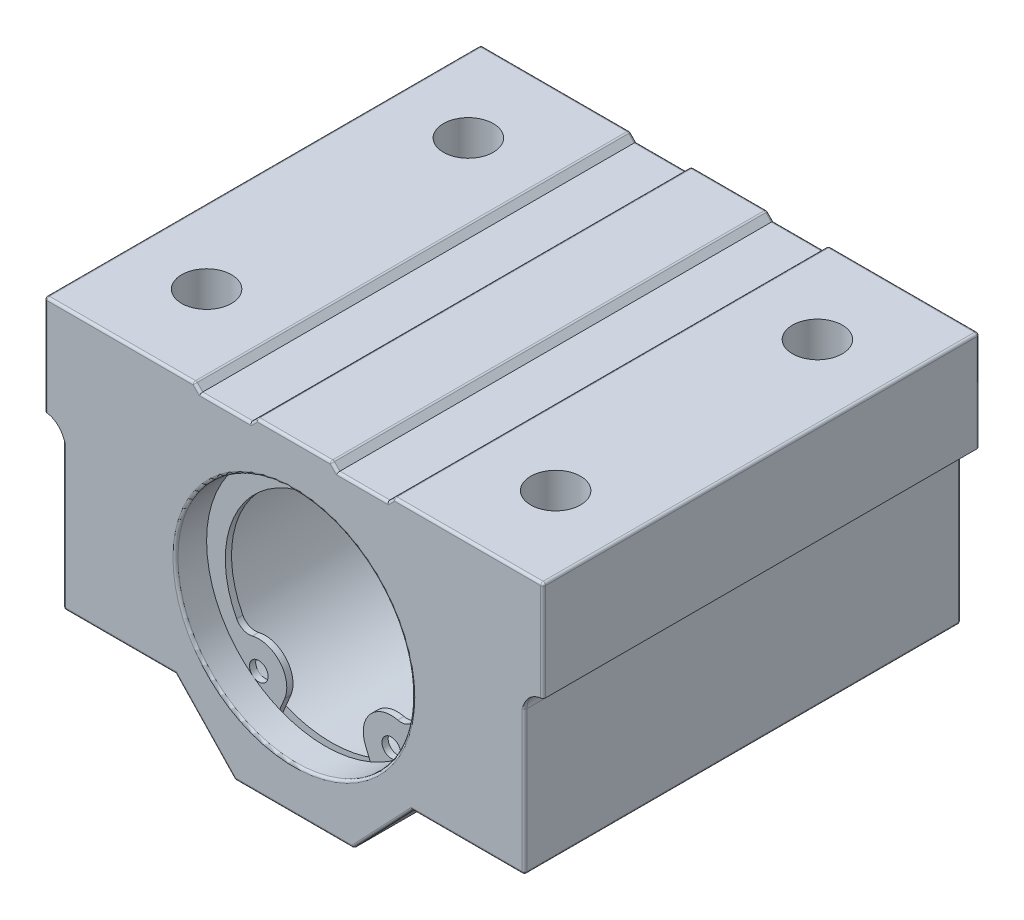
ISO-10303-21;
HEADER;
FILE_DESCRIPTION(('STEP AP214'),'2;1');
FILE_NAME('part.step','',(''),(''),'','','');
FILE_SCHEMA(('AUTOMOTIVE_DESIGN { 1 0 10303 214 1 1 1 1 }'));
ENDSEC;
DATA;
#1=APPLICATION_CONTEXT('core data for automotive mechanical design processes');
#2=APPLICATION_PROTOCOL_DEFINITION('international standard','automotive_design',2000,#1);
#3=PRODUCT_CONTEXT('',#1,'mechanical');
#4=PRODUCT('Part','Part','',(#3));
#5=PRODUCT_RELATED_PRODUCT_CATEGORY('part','',(#4));
#6=PRODUCT_DEFINITION_FORMATION('','',#4);
#7=PRODUCT_DEFINITION_CONTEXT('part definition',#1,'design');
#8=PRODUCT_DEFINITION('design','',#6,#7);
#9=PRODUCT_DEFINITION_SHAPE('','',#8);
#10=(LENGTH_UNIT() NAMED_UNIT(*) SI_UNIT(.MILLI.,.METRE.));
#11=(NAMED_UNIT(*) PLANE_ANGLE_UNIT() SI_UNIT($,.RADIAN.));
#12=(NAMED_UNIT(*) SI_UNIT($,.STERADIAN.) SOLID_ANGLE_UNIT());
#13=UNCERTAINTY_MEASURE_WITH_UNIT(LENGTH_MEASURE(1.E-05),#10,'distance_accuracy_value','');
#14=(GEOMETRIC_REPRESENTATION_CONTEXT(3) GLOBAL_UNCERTAINTY_ASSIGNED_CONTEXT((#13)) GLOBAL_UNIT_ASSIGNED_CONTEXT((#10,
#11,#12)) REPRESENTATION_CONTEXT('',''));
#15=CARTESIAN_POINT('',(0.,0.,0.));
#16=DIRECTION('',(0.,0.,1.));
#17=DIRECTION('',(1.,0.,0.));
#18=AXIS2_PLACEMENT_3D('',#15,#16,#17);
#19=CARTESIAN_POINT('',(-14.,3.00000000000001,-10.5));
#20=DIRECTION('',(0.,-1.,0.));
#21=DIRECTION('',(1.,0.,0.));
#22=AXIS2_PLACEMENT_3D('',#19,#20,#21);
#23=PLANE('',#22);
#24=CARTESIAN_POINT('',(-14.,3.00000000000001,-10.5));
#25=DIRECTION('',(0.,1.,0.));
#26=DIRECTION('',(0.,0.,1.));
#27=AXIS2_PLACEMENT_3D('',#24,#25,#26);
#28=CIRCLE('',#27,2.);
#29=CARTESIAN_POINT('',(-14.,3.00000000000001,-8.5));
#30=VERTEX_POINT('',#29);
#31=EDGE_CURVE('E1199',#30,#30,#28,.T.);
#32=ORIENTED_EDGE('',*,*,#31,.T.);
#33=EDGE_LOOP('',(#32));
#34=FACE_BOUND('',#33,.T.);
#35=CARTESIAN_POINT('',(-14.,3.00000000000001,-10.5));
#36=DIRECTION('',(0.,-1.,0.));
#37=DIRECTION('',(1.,0.,0.));
#38=AXIS2_PLACEMENT_3D('',#35,#36,#37);
#39=CIRCLE('',#38,2.15);
#40=CARTESIAN_POINT('',(-11.85,3.00000000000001,-10.5));
#41=VERTEX_POINT('',#40);
#42=EDGE_CURVE('E1204',#41,#41,#39,.T.);
#43=ORIENTED_EDGE('',*,*,#42,.T.);
#44=EDGE_LOOP('',(#43));
#45=FACE_BOUND('',#44,.T.);
#46=ADVANCED_FACE('F17',(#34,#45),#23,.T.);
#47=CARTESIAN_POINT('',(-14.,3.00000000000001,10.5));
#48=DIRECTION('',(0.,-1.,0.));
#49=DIRECTION('',(1.,0.,0.));
#50=AXIS2_PLACEMENT_3D('',#47,#48,#49);
#51=PLANE('',#50);
#52=CARTESIAN_POINT('',(-14.,3.00000000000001,10.5));
#53=DIRECTION('',(0.,1.,0.));
#54=DIRECTION('',(0.,0.,1.));
#55=AXIS2_PLACEMENT_3D('',#52,#53,#54);
#56=CIRCLE('',#55,2.);
#57=CARTESIAN_POINT('',(-14.,3.00000000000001,12.5));
#58=VERTEX_POINT('',#57);
#59=EDGE_CURVE('E1196',#58,#58,#56,.T.);
#60=ORIENTED_EDGE('',*,*,#59,.T.);
#61=EDGE_LOOP('',(#60));
#62=FACE_BOUND('',#61,.T.);
#63=CARTESIAN_POINT('',(-14.,3.00000000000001,10.5));
#64=DIRECTION('',(0.,-1.,0.));
#65=DIRECTION('',(1.,0.,0.));
#66=AXIS2_PLACEMENT_3D('',#63,#64,#65);
#67=CIRCLE('',#66,2.15);
#68=CARTESIAN_POINT('',(-11.85,3.00000000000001,10.5));
#69=VERTEX_POINT('',#68);
#70=EDGE_CURVE('E1207',#69,#69,#67,.T.);
#71=ORIENTED_EDGE('',*,*,#70,.T.);
#72=EDGE_LOOP('',(#71));
#73=FACE_BOUND('',#72,.T.);
#74=ADVANCED_FACE('F3318',(#62,#73),#51,.T.);
#75=CARTESIAN_POINT('',(14.,3.,-10.5));
#76=DIRECTION('',(0.,-1.,0.));
#77=DIRECTION('',(1.,0.,0.));
#78=AXIS2_PLACEMENT_3D('',#75,#76,#77);
#79=PLANE('',#78);
#80=CARTESIAN_POINT('',(14.,3.,-10.5));
#81=DIRECTION('',(0.,1.,0.));
#82=DIRECTION('',(0.,0.,1.));
#83=AXIS2_PLACEMENT_3D('',#80,#81,#82);
#84=CIRCLE('',#83,2.);
#85=CARTESIAN_POINT('',(14.,3.,-8.5));
#86=VERTEX_POINT('',#85);
#87=EDGE_CURVE('E1217',#86,#86,#84,.T.);
#88=ORIENTED_EDGE('',*,*,#87,.T.);
#89=EDGE_LOOP('',(#88));
#90=FACE_BOUND('',#89,.T.);
#91=CARTESIAN_POINT('',(14.,3.,-10.5));
#92=DIRECTION('',(0.,-1.,0.));
#93=DIRECTION('',(1.,0.,0.));
#94=AXIS2_PLACEMENT_3D('',#91,#92,#93);
#95=CIRCLE('',#94,2.15);
#96=CARTESIAN_POINT('',(16.15,3.,-10.5));
#97=VERTEX_POINT('',#96);
#98=EDGE_CURVE('E1210',#97,#97,#95,.T.);
#99=ORIENTED_EDGE('',*,*,#98,.T.);
#100=EDGE_LOOP('',(#99));
#101=FACE_BOUND('',#100,.T.);
#102=ADVANCED_FACE('F3309',(#90,#101),#79,.T.);
#103=CARTESIAN_POINT('',(14.,3.,10.5));
#104=DIRECTION('',(0.,-1.,0.));
#105=DIRECTION('',(1.,0.,0.));
#106=AXIS2_PLACEMENT_3D('',#103,#104,#105);
#107=PLANE('',#106);
#108=CARTESIAN_POINT('',(14.,3.,10.5));
#109=DIRECTION('',(0.,1.,0.));
#110=DIRECTION('',(0.,0.,1.));
#111=AXIS2_PLACEMENT_3D('',#108,#109,#110);
#112=CIRCLE('',#111,2.);
#113=CARTESIAN_POINT('',(14.,3.,12.5));
#114=VERTEX_POINT('',#113);
#115=EDGE_CURVE('E1220',#114,#114,#112,.T.);
#116=ORIENTED_EDGE('',*,*,#115,.T.);
#117=EDGE_LOOP('',(#116));
#118=FACE_BOUND('',#117,.T.);
#119=CARTESIAN_POINT('',(14.,3.,10.5));
#120=DIRECTION('',(0.,-1.,0.));
#121=DIRECTION('',(1.,0.,0.));
#122=AXIS2_PLACEMENT_3D('',#119,#120,#121);
#123=CIRCLE('',#122,2.15);
#124=CARTESIAN_POINT('',(16.15,3.,10.5));
#125=VERTEX_POINT('',#124);
#126=EDGE_CURVE('E1213',#125,#125,#123,.T.);
#127=ORIENTED_EDGE('',*,*,#126,.T.);
#128=EDGE_LOOP('',(#127));
#129=FACE_BOUND('',#128,.T.);
#130=ADVANCED_FACE('F3299',(#118,#129),#107,.T.);
#131=CARTESIAN_POINT('',(-8.08284271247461,12.8,-17.5));
#132=DIRECTION('',(0.,0.,1.));
#133=DIRECTION('',(1.,0.,0.));
#134=AXIS2_PLACEMENT_3D('',#131,#132,#133);
#135=CYLINDRICAL_SURFACE('',#134,0.200000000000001);
#136=CARTESIAN_POINT('',(-8.08284271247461,12.8,17.3));
#137=DIRECTION('',(0.,0.,1.));
#138=DIRECTION('',(1.,0.,0.));
#139=AXIS2_PLACEMENT_3D('',#136,#137,#138);
#140=CIRCLE('',#139,0.200000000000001);
#141=CARTESIAN_POINT('',(-8.08284271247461,13.,17.3));
#142=VERTEX_POINT('',#141);
#143=CARTESIAN_POINT('',(-7.9414213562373,12.9414213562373,17.3));
#144=VERTEX_POINT('',#143);
#145=EDGE_CURVE('E1200',#142,#144,#140,.F.);
#146=ORIENTED_EDGE('',*,*,#145,.T.);
#147=DIRECTION('',(0.,0.,1.));
#148=VECTOR('',#147,1.);
#149=CARTESIAN_POINT('',(-7.9414213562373,12.9414213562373,-17.5));
#150=LINE('',#149,#148);
#151=CARTESIAN_POINT('',(-7.9414213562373,12.9414213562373,-17.3));
#152=VERTEX_POINT('',#151);
#153=EDGE_CURVE('E1681',#144,#152,#150,.F.);
#154=ORIENTED_EDGE('',*,*,#153,.T.);
#155=CARTESIAN_POINT('',(-8.08284271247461,12.8,-17.3));
#156=DIRECTION('',(0.,0.,1.));
#157=DIRECTION('',(1.,0.,0.));
#158=AXIS2_PLACEMENT_3D('',#155,#156,#157);
#159=CIRCLE('',#158,0.2);
#160=CARTESIAN_POINT('',(-8.08284271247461,13.,-17.3));
#161=VERTEX_POINT('',#160);
#162=EDGE_CURVE('E1647',#161,#152,#159,.F.);
#163=ORIENTED_EDGE('',*,*,#162,.F.);
#164=DIRECTION('',(0.,0.,1.));
#165=VECTOR('',#164,1.);
#166=CARTESIAN_POINT('',(-8.08284271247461,13.,17.5));
#167=LINE('',#166,#165);
#168=EDGE_CURVE('E1568',#161,#142,#167,.T.);
#169=ORIENTED_EDGE('',*,*,#168,.T.);
#170=EDGE_LOOP('',(#146,#154,#163,#169));
#171=FACE_BOUND('',#170,.T.);
#172=ADVANCED_FACE('F3289',(#171),#135,.T.);
#173=CARTESIAN_POINT('',(-14.,13.,10.5));
#174=DIRECTION('',(0.,1.,0.));
#175=DIRECTION('',(0.,0.,1.));
#176=AXIS2_PLACEMENT_3D('',#173,#174,#175);
#177=CYLINDRICAL_SURFACE('',#176,2.);
#178=ORIENTED_EDGE('',*,*,#59,.F.);
#179=EDGE_LOOP('',(#178));
#180=FACE_BOUND('',#179,.T.);
#181=CARTESIAN_POINT('',(-14.,13.,10.5));
#182=DIRECTION('',(0.,1.,0.));
#183=DIRECTION('',(0.,0.,1.));
#184=AXIS2_PLACEMENT_3D('',#181,#182,#183);
#185=CIRCLE('',#184,2.);
#186=CARTESIAN_POINT('',(-14.,13.,12.5));
#187=VERTEX_POINT('',#186);
#188=EDGE_CURVE('E1239',#187,#187,#185,.T.);
#189=ORIENTED_EDGE('',*,*,#188,.T.);
#190=EDGE_LOOP('',(#189));
#191=FACE_BOUND('',#190,.T.);
#192=ADVANCED_FACE('F3279',(#180,#191),#177,.F.);
#193=CARTESIAN_POINT('',(-14.,13.,-10.5));
#194=DIRECTION('',(0.,1.,0.));
#195=DIRECTION('',(0.,0.,1.));
#196=AXIS2_PLACEMENT_3D('',#193,#194,#195);
#197=CYLINDRICAL_SURFACE('',#196,2.);
#198=ORIENTED_EDGE('',*,*,#31,.F.);
#199=EDGE_LOOP('',(#198));
#200=FACE_BOUND('',#199,.T.);
#201=CARTESIAN_POINT('',(-14.,13.,-10.5));
#202=DIRECTION('',(0.,1.,0.));
#203=DIRECTION('',(0.,0.,1.));
#204=AXIS2_PLACEMENT_3D('',#201,#202,#203);
#205=CIRCLE('',#204,2.);
#206=CARTESIAN_POINT('',(-14.,13.,-8.5));
#207=VERTEX_POINT('',#206);
#208=EDGE_CURVE('E1242',#207,#207,#205,.T.);
#209=ORIENTED_EDGE('',*,*,#208,.T.);
#210=EDGE_LOOP('',(#209));
#211=FACE_BOUND('',#210,.T.);
#212=ADVANCED_FACE('F3270',(#200,#211),#197,.F.);
#213=CARTESIAN_POINT('',(-19.8,12.8,17.5));
#214=DIRECTION('',(0.,0.,-1.));
#215=DIRECTION('',(-1.,0.,0.));
#216=AXIS2_PLACEMENT_3D('',#213,#214,#215);
#217=CYLINDRICAL_SURFACE('',#216,0.199999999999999);
#218=CARTESIAN_POINT('',(-19.8,12.8,17.3));
#219=DIRECTION('',(0.,0.,-1.));
#220=DIRECTION('',(-1.,0.,0.));
#221=AXIS2_PLACEMENT_3D('',#218,#219,#220);
#222=CIRCLE('',#221,0.199999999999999);
#223=CARTESIAN_POINT('',(-20.,12.8,17.3));
#224=VERTEX_POINT('',#223);
#225=CARTESIAN_POINT('',(-19.8,13.,17.3));
#226=VERTEX_POINT('',#225);
#227=EDGE_CURVE('E1203',#224,#226,#222,.T.);
#228=ORIENTED_EDGE('',*,*,#227,.T.);
#229=DIRECTION('',(0.,0.,1.));
#230=VECTOR('',#229,1.);
#231=CARTESIAN_POINT('',(-19.8,13.,17.5));
#232=LINE('',#231,#230);
#233=CARTESIAN_POINT('',(-19.8,13.,-17.3000000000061));
#234=VERTEX_POINT('',#233);
#235=EDGE_CURVE('E1243',#226,#234,#232,.F.);
#236=ORIENTED_EDGE('',*,*,#235,.T.);
#237=CARTESIAN_POINT('',(-19.8,12.8,-17.3));
#238=DIRECTION('',(0.,1.22659943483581E-10,1.));
#239=DIRECTION('',(1.,0.,0.));
#240=AXIS2_PLACEMENT_3D('',#237,#238,#239);
#241=CIRCLE('',#240,0.2);
#242=CARTESIAN_POINT('',(-20.,12.8,-17.3));
#243=VERTEX_POINT('',#242);
#244=EDGE_CURVE('E1617',#243,#234,#241,.F.);
#245=ORIENTED_EDGE('',*,*,#244,.F.);
#246=DIRECTION('',(0.,0.,-1.));
#247=VECTOR('',#246,1.);
#248=CARTESIAN_POINT('',(-20.,12.8,17.5));
#249=LINE('',#248,#247);
#250=EDGE_CURVE('E1246',#243,#224,#249,.F.);
#251=ORIENTED_EDGE('',*,*,#250,.T.);
#252=EDGE_LOOP('',(#228,#236,#245,#251));
#253=FACE_BOUND('',#252,.T.);
#254=ADVANCED_FACE('F3261',(#253),#217,.T.);
#255=CARTESIAN_POINT('',(-14.,3.00000000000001,-10.5));
#256=DIRECTION('',(0.,-1.,0.));
#257=DIRECTION('',(1.,0.,0.));
#258=AXIS2_PLACEMENT_3D('',#255,#256,#257);
#259=CYLINDRICAL_SURFACE('',#258,2.15);
#260=ORIENTED_EDGE('',*,*,#42,.F.);
#261=EDGE_LOOP('',(#260));
#262=FACE_BOUND('',#261,.T.);
#263=CARTESIAN_POINT('',(-14.,-7.99999999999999,-10.5));
#264=DIRECTION('',(0.,-1.,0.));
#265=DIRECTION('',(1.,0.,0.));
#266=AXIS2_PLACEMENT_3D('',#263,#264,#265);
#267=CIRCLE('',#266,2.15);
#268=CARTESIAN_POINT('',(-11.85,-7.99999999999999,-10.5));
#269=VERTEX_POINT('',#268);
#270=EDGE_CURVE('E1247',#269,#269,#267,.T.);
#271=ORIENTED_EDGE('',*,*,#270,.T.);
#272=EDGE_LOOP('',(#271));
#273=FACE_BOUND('',#272,.T.);
#274=ADVANCED_FACE('F3252',(#262,#273),#259,.F.);
#275=CARTESIAN_POINT('',(-14.,3.00000000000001,10.5));
#276=DIRECTION('',(0.,-1.,0.));
#277=DIRECTION('',(1.,0.,0.));
#278=AXIS2_PLACEMENT_3D('',#275,#276,#277);
#279=CYLINDRICAL_SURFACE('',#278,2.15);
#280=ORIENTED_EDGE('',*,*,#70,.F.);
#281=EDGE_LOOP('',(#280));
#282=FACE_BOUND('',#281,.T.);
#283=CARTESIAN_POINT('',(-14.,-7.99999999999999,10.5));
#284=DIRECTION('',(0.,-1.,0.));
#285=DIRECTION('',(1.,0.,0.));
#286=AXIS2_PLACEMENT_3D('',#283,#284,#285);
#287=CIRCLE('',#286,2.15);
#288=CARTESIAN_POINT('',(-11.85,-7.99999999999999,10.5));
#289=VERTEX_POINT('',#288);
#290=EDGE_CURVE('E1250',#289,#289,#287,.T.);
#291=ORIENTED_EDGE('',*,*,#290,.T.);
#292=EDGE_LOOP('',(#291));
#293=FACE_BOUND('',#292,.T.);
#294=ADVANCED_FACE('F3242',(#282,#293),#279,.F.);
#295=CARTESIAN_POINT('',(-18.3,-7.8,17.5));
#296=DIRECTION('',(0.,0.,-1.));
#297=DIRECTION('',(-1.,0.,0.));
#298=AXIS2_PLACEMENT_3D('',#295,#296,#297);
#299=CYLINDRICAL_SURFACE('',#298,0.199999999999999);
#300=CARTESIAN_POINT('',(-18.3,-7.80000000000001,17.3));
#301=DIRECTION('',(0.,0.,-1.));
#302=DIRECTION('',(1.,0.,0.));
#303=AXIS2_PLACEMENT_3D('',#300,#301,#302);
#304=CIRCLE('',#303,0.2);
#305=CARTESIAN_POINT('',(-18.5,-7.8,17.3));
#306=VERTEX_POINT('',#305);
#307=CARTESIAN_POINT('',(-18.3,-8.,17.3));
#308=VERTEX_POINT('',#307);
#309=EDGE_CURVE('E1251',#306,#308,#304,.F.);
#310=ORIENTED_EDGE('',*,*,#309,.F.);
#311=DIRECTION('',(0.,0.,-1.));
#312=VECTOR('',#311,1.);
#313=CARTESIAN_POINT('',(-18.5,-7.8,17.5));
#314=LINE('',#313,#312);
#315=CARTESIAN_POINT('',(-18.5,-7.8,-17.3));
#316=VERTEX_POINT('',#315);
#317=EDGE_CURVE('E1523',#306,#316,#314,.T.);
#318=ORIENTED_EDGE('',*,*,#317,.T.);
#319=CARTESIAN_POINT('',(-18.3,-7.80000000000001,-17.3));
#320=DIRECTION('',(0.,0.,-1.));
#321=DIRECTION('',(1.,0.,0.));
#322=AXIS2_PLACEMENT_3D('',#319,#320,#321);
#323=CIRCLE('',#322,0.2);
#324=CARTESIAN_POINT('',(-18.3,-8.,-17.3));
#325=VERTEX_POINT('',#324);
#326=EDGE_CURVE('E1604',#325,#316,#323,.T.);
#327=ORIENTED_EDGE('',*,*,#326,.F.);
#328=DIRECTION('',(0.,0.,1.));
#329=VECTOR('',#328,1.);
#330=CARTESIAN_POINT('',(-18.3,-8.,17.5));
#331=LINE('',#330,#329);
#332=EDGE_CURVE('E1254',#325,#308,#331,.T.);
#333=ORIENTED_EDGE('',*,*,#332,.T.);
#334=EDGE_LOOP('',(#310,#318,#327,#333));
#335=FACE_BOUND('',#334,.T.);
#336=ADVANCED_FACE('F2153',(#335),#299,.T.);
#337=CARTESIAN_POINT('',(-4.66413771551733,-12.8,17.5));
#338=DIRECTION('',(0.,0.,-1.));
#339=DIRECTION('',(-1.,0.,0.));
#340=AXIS2_PLACEMENT_3D('',#337,#338,#339);
#341=CYLINDRICAL_SURFACE('',#340,0.2);
#342=CARTESIAN_POINT('',(-4.66413771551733,-12.8,17.3));
#343=DIRECTION('',(0.,0.,-1.));
#344=DIRECTION('',(1.,0.,0.));
#345=AXIS2_PLACEMENT_3D('',#342,#343,#344);
#346=CIRCLE('',#345,0.2);
#347=CARTESIAN_POINT('',(-4.8091376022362,-12.9377498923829,17.3));
#348=VERTEX_POINT('',#347);
#349=CARTESIAN_POINT('',(-4.66413771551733,-13.,17.3));
#350=VERTEX_POINT('',#349);
#351=EDGE_CURVE('E1488',#348,#350,#346,.F.);
#352=ORIENTED_EDGE('',*,*,#351,.F.);
#353=DIRECTION('',(0.,0.,1.));
#354=VECTOR('',#353,1.);
#355=CARTESIAN_POINT('',(-4.80913760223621,-12.9377498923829,17.5));
#356=LINE('',#355,#354);
#357=CARTESIAN_POINT('',(-4.80913760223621,-12.9377498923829,-17.3));
#358=VERTEX_POINT('',#357);
#359=EDGE_CURVE('E3509',#348,#358,#356,.F.);
#360=ORIENTED_EDGE('',*,*,#359,.T.);
#361=CARTESIAN_POINT('',(-4.66413771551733,-12.8,-17.3));
#362=DIRECTION('',(0.,0.,-1.));
#363=DIRECTION('',(1.,0.,0.));
#364=AXIS2_PLACEMENT_3D('',#361,#362,#363);
#365=CIRCLE('',#364,0.2);
#366=CARTESIAN_POINT('',(-4.66413771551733,-13.,-17.3));
#367=VERTEX_POINT('',#366);
#368=EDGE_CURVE('E1602',#367,#358,#365,.T.);
#369=ORIENTED_EDGE('',*,*,#368,.F.);
#370=DIRECTION('',(0.,0.,1.));
#371=VECTOR('',#370,1.);
#372=CARTESIAN_POINT('',(-4.66413771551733,-13.,17.5));
#373=LINE('',#372,#371);
#374=EDGE_CURVE('E3511',#367,#350,#373,.T.);
#375=ORIENTED_EDGE('',*,*,#374,.T.);
#376=EDGE_LOOP('',(#352,#360,#369,#375));
#377=FACE_BOUND('',#376,.T.);
#378=ADVANCED_FACE('F3224',(#377),#341,.T.);
#379=CARTESIAN_POINT('',(4.66413771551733,-12.8,17.5));
#380=DIRECTION('',(0.,0.,-1.));
#381=DIRECTION('',(-1.,0.,0.));
#382=AXIS2_PLACEMENT_3D('',#379,#380,#381);
#383=CYLINDRICAL_SURFACE('',#382,0.2);
#384=CARTESIAN_POINT('',(4.66413771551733,-12.8,17.3));
#385=DIRECTION('',(0.,0.,-1.));
#386=DIRECTION('',(1.,0.,0.));
#387=AXIS2_PLACEMENT_3D('',#384,#385,#386);
#388=CIRCLE('',#387,0.2);
#389=CARTESIAN_POINT('',(4.66413771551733,-13.,17.3));
#390=VERTEX_POINT('',#389);
#391=CARTESIAN_POINT('',(4.80913760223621,-12.9377498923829,17.3));
#392=VERTEX_POINT('',#391);
#393=EDGE_CURVE('E1481',#390,#392,#388,.F.);
#394=ORIENTED_EDGE('',*,*,#393,.F.);
#395=DIRECTION('',(0.,0.,1.));
#396=VECTOR('',#395,1.);
#397=CARTESIAN_POINT('',(4.66413771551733,-13.,17.5));
#398=LINE('',#397,#396);
#399=CARTESIAN_POINT('',(4.66413771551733,-13.,-17.3));
#400=VERTEX_POINT('',#399);
#401=EDGE_CURVE('E1483',#390,#400,#398,.F.);
#402=ORIENTED_EDGE('',*,*,#401,.T.);
#403=CARTESIAN_POINT('',(4.66413771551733,-12.8,-17.3));
#404=DIRECTION('',(0.,0.,-1.));
#405=DIRECTION('',(1.,0.,0.));
#406=AXIS2_PLACEMENT_3D('',#403,#404,#405);
#407=CIRCLE('',#406,0.2);
#408=CARTESIAN_POINT('',(4.80913760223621,-12.9377498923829,-17.3));
#409=VERTEX_POINT('',#408);
#410=EDGE_CURVE('E1581',#409,#400,#407,.T.);
#411=ORIENTED_EDGE('',*,*,#410,.F.);
#412=DIRECTION('',(0.,0.,1.));
#413=VECTOR('',#412,1.);
#414=CARTESIAN_POINT('',(4.80913760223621,-12.9377498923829,17.5));
#415=LINE('',#414,#413);
#416=EDGE_CURVE('E1259',#409,#392,#415,.T.);
#417=ORIENTED_EDGE('',*,*,#416,.T.);
#418=EDGE_LOOP('',(#394,#402,#411,#417));
#419=FACE_BOUND('',#418,.T.);
#420=ADVANCED_FACE('F3215',(#419),#383,.T.);
#421=CARTESIAN_POINT('',(14.,3.,-10.5));
#422=DIRECTION('',(0.,-1.,0.));
#423=DIRECTION('',(1.,0.,0.));
#424=AXIS2_PLACEMENT_3D('',#421,#422,#423);
#425=CYLINDRICAL_SURFACE('',#424,2.15);
#426=ORIENTED_EDGE('',*,*,#98,.F.);
#427=EDGE_LOOP('',(#426));
#428=FACE_BOUND('',#427,.T.);
#429=CARTESIAN_POINT('',(14.,-8.,-10.5));
#430=DIRECTION('',(0.,-1.,0.));
#431=DIRECTION('',(1.,0.,0.));
#432=AXIS2_PLACEMENT_3D('',#429,#430,#431);
#433=CIRCLE('',#432,2.15);
#434=CARTESIAN_POINT('',(16.15,-8.,-10.5));
#435=VERTEX_POINT('',#434);
#436=EDGE_CURVE('E1255',#435,#435,#433,.T.);
#437=ORIENTED_EDGE('',*,*,#436,.T.);
#438=EDGE_LOOP('',(#437));
#439=FACE_BOUND('',#438,.T.);
#440=ADVANCED_FACE('F3206',(#428,#439),#425,.F.);
#441=CARTESIAN_POINT('',(14.,3.,10.5));
#442=DIRECTION('',(0.,-1.,0.));
#443=DIRECTION('',(1.,0.,0.));
#444=AXIS2_PLACEMENT_3D('',#441,#442,#443);
#445=CYLINDRICAL_SURFACE('',#444,2.15);
#446=ORIENTED_EDGE('',*,*,#126,.F.);
#447=EDGE_LOOP('',(#446));
#448=FACE_BOUND('',#447,.T.);
#449=CARTESIAN_POINT('',(14.,-8.,10.5));
#450=DIRECTION('',(0.,-1.,0.));
#451=DIRECTION('',(1.,0.,0.));
#452=AXIS2_PLACEMENT_3D('',#449,#450,#451);
#453=CIRCLE('',#452,2.15);
#454=CARTESIAN_POINT('',(16.15,-8.,10.5));
#455=VERTEX_POINT('',#454);
#456=EDGE_CURVE('E1258',#455,#455,#453,.T.);
#457=ORIENTED_EDGE('',*,*,#456,.T.);
#458=EDGE_LOOP('',(#457));
#459=FACE_BOUND('',#458,.T.);
#460=ADVANCED_FACE('F3195',(#448,#459),#445,.F.);
#461=CARTESIAN_POINT('',(18.3,-7.8,17.5));
#462=DIRECTION('',(0.,0.,-1.));
#463=DIRECTION('',(-1.,0.,0.));
#464=AXIS2_PLACEMENT_3D('',#461,#462,#463);
#465=CYLINDRICAL_SURFACE('',#464,0.199999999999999);
#466=CARTESIAN_POINT('',(18.3,-7.8,17.3));
#467=DIRECTION('',(0.,0.,-1.));
#468=DIRECTION('',(-1.,0.,0.));
#469=AXIS2_PLACEMENT_3D('',#466,#467,#468);
#470=CIRCLE('',#469,0.199999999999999);
#471=CARTESIAN_POINT('',(18.5,-7.8,17.3));
#472=VERTEX_POINT('',#471);
#473=CARTESIAN_POINT('',(18.3,-7.99999999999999,17.3));
#474=VERTEX_POINT('',#473);
#475=EDGE_CURVE('E1216',#472,#474,#470,.T.);
#476=ORIENTED_EDGE('',*,*,#475,.T.);
#477=DIRECTION('',(0.,0.,1.));
#478=VECTOR('',#477,1.);
#479=CARTESIAN_POINT('',(18.3,-8.,17.5));
#480=LINE('',#479,#478);
#481=CARTESIAN_POINT('',(18.3,-8.,-17.3));
#482=VERTEX_POINT('',#481);
#483=EDGE_CURVE('E3560',#474,#482,#480,.F.);
#484=ORIENTED_EDGE('',*,*,#483,.T.);
#485=CARTESIAN_POINT('',(18.3,-7.8,-17.3));
#486=DIRECTION('',(0.,0.,-1.));
#487=DIRECTION('',(1.,0.,0.));
#488=AXIS2_PLACEMENT_3D('',#485,#486,#487);
#489=CIRCLE('',#488,0.2);
#490=CARTESIAN_POINT('',(18.5,-7.8,-17.3));
#491=VERTEX_POINT('',#490);
#492=EDGE_CURVE('E1569',#491,#482,#489,.T.);
#493=ORIENTED_EDGE('',*,*,#492,.F.);
#494=DIRECTION('',(0.,0.,1.));
#495=VECTOR('',#494,1.);
#496=CARTESIAN_POINT('',(18.5,-7.8,17.5));
#497=LINE('',#496,#495);
#498=EDGE_CURVE('E1446',#491,#472,#497,.T.);
#499=ORIENTED_EDGE('',*,*,#498,.T.);
#500=EDGE_LOOP('',(#476,#484,#493,#499));
#501=FACE_BOUND('',#500,.T.);
#502=ADVANCED_FACE('F3186',(#501),#465,.T.);
#503=CARTESIAN_POINT('',(19.8,12.8,17.5));
#504=DIRECTION('',(0.,0.,-1.));
#505=DIRECTION('',(-1.,0.,0.));
#506=AXIS2_PLACEMENT_3D('',#503,#504,#505);
#507=CYLINDRICAL_SURFACE('',#506,0.199999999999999);
#508=CARTESIAN_POINT('',(19.8,12.8,17.3));
#509=DIRECTION('',(0.,-1.22659821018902E-10,1.));
#510=DIRECTION('',(1.,0.,0.));
#511=AXIS2_PLACEMENT_3D('',#508,#509,#510);
#512=CIRCLE('',#511,0.2);
#513=CARTESIAN_POINT('',(20.,12.8,17.3));
#514=VERTEX_POINT('',#513);
#515=CARTESIAN_POINT('',(19.8,13.,17.3000000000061));
#516=VERTEX_POINT('',#515);
#517=EDGE_CURVE('E1425',#514,#516,#512,.T.);
#518=ORIENTED_EDGE('',*,*,#517,.F.);
#519=DIRECTION('',(0.,0.,1.));
#520=VECTOR('',#519,1.);
#521=CARTESIAN_POINT('',(20.,12.8,17.5));
#522=LINE('',#521,#520);
#523=CARTESIAN_POINT('',(20.,12.8,-17.3));
#524=VERTEX_POINT('',#523);
#525=EDGE_CURVE('E1429',#514,#524,#522,.F.);
#526=ORIENTED_EDGE('',*,*,#525,.T.);
#527=CARTESIAN_POINT('',(19.8,12.8,-17.3));
#528=DIRECTION('',(0.,0.,1.));
#529=DIRECTION('',(1.,0.,0.));
#530=AXIS2_PLACEMENT_3D('',#527,#528,#529);
#531=CIRCLE('',#530,0.2);
#532=CARTESIAN_POINT('',(19.8,13.,-17.3));
#533=VERTEX_POINT('',#532);
#534=EDGE_CURVE('E1565',#533,#524,#531,.F.);
#535=ORIENTED_EDGE('',*,*,#534,.F.);
#536=DIRECTION('',(0.,0.,1.));
#537=VECTOR('',#536,1.);
#538=CARTESIAN_POINT('',(19.8,13.,17.5));
#539=LINE('',#538,#537);
#540=EDGE_CURVE('E1428',#533,#516,#539,.T.);
#541=ORIENTED_EDGE('',*,*,#540,.T.);
#542=EDGE_LOOP('',(#518,#526,#535,#541));
#543=FACE_BOUND('',#542,.T.);
#544=ADVANCED_FACE('F1930',(#543),#507,.T.);
#545=CARTESIAN_POINT('',(8.08284271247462,12.8,17.5));
#546=DIRECTION('',(0.,0.,1.));
#547=DIRECTION('',(1.,0.,0.));
#548=AXIS2_PLACEMENT_3D('',#545,#546,#547);
#549=CYLINDRICAL_SURFACE('',#548,0.200000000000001);
#550=CARTESIAN_POINT('',(8.08284271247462,12.8,17.3));
#551=DIRECTION('',(0.,0.,1.));
#552=DIRECTION('',(1.,0.,0.));
#553=AXIS2_PLACEMENT_3D('',#550,#551,#552);
#554=CIRCLE('',#553,0.200000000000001);
#555=CARTESIAN_POINT('',(7.94142135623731,12.9414213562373,17.3));
#556=VERTEX_POINT('',#555);
#557=CARTESIAN_POINT('',(8.08284271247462,13.,17.3));
#558=VERTEX_POINT('',#557);
#559=EDGE_CURVE('E1221',#556,#558,#554,.F.);
#560=ORIENTED_EDGE('',*,*,#559,.T.);
#561=DIRECTION('',(0.,0.,1.));
#562=VECTOR('',#561,1.);
#563=CARTESIAN_POINT('',(8.08284271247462,13.,17.5));
#564=LINE('',#563,#562);
#565=CARTESIAN_POINT('',(8.08284271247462,13.,-17.3));
#566=VERTEX_POINT('',#565);
#567=EDGE_CURVE('E1267',#558,#566,#564,.F.);
#568=ORIENTED_EDGE('',*,*,#567,.T.);
#569=CARTESIAN_POINT('',(8.08284271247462,12.8,-17.3));
#570=DIRECTION('',(0.,0.,1.));
#571=DIRECTION('',(1.,0.,0.));
#572=AXIS2_PLACEMENT_3D('',#569,#570,#571);
#573=CIRCLE('',#572,0.2);
#574=CARTESIAN_POINT('',(7.94142135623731,12.9414213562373,-17.3));
#575=VERTEX_POINT('',#574);
#576=EDGE_CURVE('E307',#575,#566,#573,.F.);
#577=ORIENTED_EDGE('',*,*,#576,.F.);
#578=DIRECTION('',(0.,0.,1.));
#579=VECTOR('',#578,1.);
#580=CARTESIAN_POINT('',(7.94142135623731,12.9414213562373,-17.5));
#581=LINE('',#580,#579);
#582=EDGE_CURVE('E1225',#575,#556,#581,.T.);
#583=ORIENTED_EDGE('',*,*,#582,.T.);
#584=EDGE_LOOP('',(#560,#568,#577,#583));
#585=FACE_BOUND('',#584,.T.);
#586=ADVANCED_FACE('F1921',(#585),#549,.T.);
#587=CARTESIAN_POINT('',(14.,13.,-10.5));
#588=DIRECTION('',(0.,1.,0.));
#589=DIRECTION('',(0.,0.,1.));
#590=AXIS2_PLACEMENT_3D('',#587,#588,#589);
#591=CYLINDRICAL_SURFACE('',#590,2.);
#592=ORIENTED_EDGE('',*,*,#87,.F.);
#593=EDGE_LOOP('',(#592));
#594=FACE_BOUND('',#593,.T.);
#595=CARTESIAN_POINT('',(14.,13.,-10.5));
#596=DIRECTION('',(0.,1.,0.));
#597=DIRECTION('',(0.,0.,1.));
#598=AXIS2_PLACEMENT_3D('',#595,#596,#597);
#599=CIRCLE('',#598,2.);
#600=CARTESIAN_POINT('',(14.,13.,-8.5));
#601=VERTEX_POINT('',#600);
#602=EDGE_CURVE('E1263',#601,#601,#599,.T.);
#603=ORIENTED_EDGE('',*,*,#602,.T.);
#604=EDGE_LOOP('',(#603));
#605=FACE_BOUND('',#604,.T.);
#606=ADVANCED_FACE('F3159',(#594,#605),#591,.F.);
#607=CARTESIAN_POINT('',(14.,13.,10.5));
#608=DIRECTION('',(0.,1.,0.));
#609=DIRECTION('',(0.,0.,1.));
#610=AXIS2_PLACEMENT_3D('',#607,#608,#609);
#611=CYLINDRICAL_SURFACE('',#610,2.);
#612=ORIENTED_EDGE('',*,*,#115,.F.);
#613=EDGE_LOOP('',(#612));
#614=FACE_BOUND('',#613,.T.);
#615=CARTESIAN_POINT('',(14.,13.,10.5));
#616=DIRECTION('',(0.,1.,0.));
#617=DIRECTION('',(0.,0.,1.));
#618=AXIS2_PLACEMENT_3D('',#615,#616,#617);
#619=CIRCLE('',#618,2.);
#620=CARTESIAN_POINT('',(14.,13.,12.5));
#621=VERTEX_POINT('',#620);
#622=EDGE_CURVE('E1266',#621,#621,#619,.T.);
#623=ORIENTED_EDGE('',*,*,#622,.T.);
#624=EDGE_LOOP('',(#623));
#625=FACE_BOUND('',#624,.T.);
#626=ADVANCED_FACE('F3150',(#614,#625),#611,.F.);
#627=CARTESIAN_POINT('',(8.,13.,-17.5));
#628=DIRECTION('',(0.707106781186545,-0.70710678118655,0.));
#629=DIRECTION('',(0.70710678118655,0.707106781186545,0.));
#630=AXIS2_PLACEMENT_3D('',#627,#628,#629);
#631=PLANE('',#630);
#632=DIRECTION('',(0.70710678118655,0.707106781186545,0.));
#633=VECTOR('',#632,1.);
#634=CARTESIAN_POINT('',(8.,13.,17.3));
#635=LINE('',#634,#633);
#636=CARTESIAN_POINT('',(7.5,12.5,17.3));
#637=VERTEX_POINT('',#636);
#638=EDGE_CURVE('E1229',#556,#637,#635,.F.);
#639=ORIENTED_EDGE('',*,*,#638,.F.);
#640=ORIENTED_EDGE('',*,*,#582,.F.);
#641=DIRECTION('',(0.70710678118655,0.707106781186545,0.));
#642=VECTOR('',#641,1.);
#643=CARTESIAN_POINT('',(8.,13.,-17.3));
#644=LINE('',#643,#642);
#645=CARTESIAN_POINT('',(7.5,12.5,-17.3));
#646=VERTEX_POINT('',#645);
#647=EDGE_CURVE('E299',#646,#575,#644,.T.);
#648=ORIENTED_EDGE('',*,*,#647,.F.);
#649=DIRECTION('',(0.,0.,-1.));
#650=VECTOR('',#649,1.);
#651=CARTESIAN_POINT('',(7.49999999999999,12.5,-17.5));
#652=LINE('',#651,#650);
#653=EDGE_CURVE('E1270',#646,#637,#652,.F.);
#654=ORIENTED_EDGE('',*,*,#653,.T.);
#655=EDGE_LOOP('',(#639,#640,#648,#654));
#656=FACE_BOUND('',#655,.T.);
#657=ADVANCED_FACE('F2089',(#656),#631,.F.);
#658=CARTESIAN_POINT('',(3.5,12.5,-17.5));
#659=DIRECTION('',(-0.707106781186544,-0.707106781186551,0.));
#660=DIRECTION('',(0.707106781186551,-0.707106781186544,0.));
#661=AXIS2_PLACEMENT_3D('',#658,#659,#660);
#662=PLANE('',#661);
#663=DIRECTION('',(0.707106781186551,-0.707106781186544,0.));
#664=VECTOR('',#663,1.);
#665=CARTESIAN_POINT('',(3.5,12.5,17.3));
#666=LINE('',#665,#664);
#667=CARTESIAN_POINT('',(3.5,12.5,17.3));
#668=VERTEX_POINT('',#667);
#669=CARTESIAN_POINT('',(3.05857864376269,12.9414213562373,17.3));
#670=VERTEX_POINT('',#669);
#671=EDGE_CURVE('E1228',#668,#670,#666,.F.);
#672=ORIENTED_EDGE('',*,*,#671,.F.);
#673=DIRECTION('',(0.,0.,-1.));
#674=VECTOR('',#673,1.);
#675=CARTESIAN_POINT('',(3.5,12.5,-17.5));
#676=LINE('',#675,#674);
#677=CARTESIAN_POINT('',(3.5,12.5,-17.3));
#678=VERTEX_POINT('',#677);
#679=EDGE_CURVE('E1396',#668,#678,#676,.T.);
#680=ORIENTED_EDGE('',*,*,#679,.T.);
#681=DIRECTION('',(0.707106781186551,-0.707106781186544,0.));
#682=VECTOR('',#681,1.);
#683=CARTESIAN_POINT('',(3.5,12.5,-17.3));
#684=LINE('',#683,#682);
#685=CARTESIAN_POINT('',(3.0585786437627,12.9414213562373,-17.3));
#686=VERTEX_POINT('',#685);
#687=EDGE_CURVE('E1226',#686,#678,#684,.T.);
#688=ORIENTED_EDGE('',*,*,#687,.F.);
#689=DIRECTION('',(0.,0.,1.));
#690=VECTOR('',#689,1.);
#691=CARTESIAN_POINT('',(3.05857864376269,12.9414213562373,-17.5));
#692=LINE('',#691,#690);
#693=EDGE_CURVE('E1693',#670,#686,#692,.F.);
#694=ORIENTED_EDGE('',*,*,#693,.F.);
#695=EDGE_LOOP('',(#672,#680,#688,#694));
#696=FACE_BOUND('',#695,.T.);
#697=ADVANCED_FACE('F3132',(#696),#662,.F.);
#698=CARTESIAN_POINT('',(2.91715728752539,12.8,-17.5));
#699=DIRECTION('',(0.,0.,1.));
#700=DIRECTION('',(1.,0.,0.));
#701=AXIS2_PLACEMENT_3D('',#698,#699,#700);
#702=CYLINDRICAL_SURFACE('',#701,0.2);
#703=CARTESIAN_POINT('',(2.91715728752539,12.8,17.3));
#704=DIRECTION('',(0.,0.,1.));
#705=DIRECTION('',(1.,0.,0.));
#706=AXIS2_PLACEMENT_3D('',#703,#704,#705);
#707=CIRCLE('',#706,0.2);
#708=CARTESIAN_POINT('',(2.91715728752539,13.,17.3));
#709=VERTEX_POINT('',#708);
#710=EDGE_CURVE('E1392',#670,#709,#707,.T.);
#711=ORIENTED_EDGE('',*,*,#710,.F.);
#712=ORIENTED_EDGE('',*,*,#693,.T.);
#713=CARTESIAN_POINT('',(2.91715728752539,12.8,-17.3));
#714=DIRECTION('',(0.,0.,1.));
#715=DIRECTION('',(1.,0.,0.));
#716=AXIS2_PLACEMENT_3D('',#713,#714,#715);
#717=CIRCLE('',#716,0.2);
#718=CARTESIAN_POINT('',(2.91715728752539,13.,-17.3));
#719=VERTEX_POINT('',#718);
#720=EDGE_CURVE('E1656',#719,#686,#717,.F.);
#721=ORIENTED_EDGE('',*,*,#720,.F.);
#722=DIRECTION('',(0.,0.,1.));
#723=VECTOR('',#722,1.);
#724=CARTESIAN_POINT('',(2.91715728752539,13.,17.5));
#725=LINE('',#724,#723);
#726=EDGE_CURVE('E1395',#719,#709,#725,.T.);
#727=ORIENTED_EDGE('',*,*,#726,.T.);
#728=EDGE_LOOP('',(#711,#712,#721,#727));
#729=FACE_BOUND('',#728,.T.);
#730=ADVANCED_FACE('F1885',(#729),#702,.T.);
#731=CARTESIAN_POINT('',(-2.91715728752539,12.8,17.5));
#732=DIRECTION('',(0.,0.,1.));
#733=DIRECTION('',(1.,0.,0.));
#734=AXIS2_PLACEMENT_3D('',#731,#732,#733);
#735=CYLINDRICAL_SURFACE('',#734,0.2);
#736=CARTESIAN_POINT('',(-2.91715728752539,12.8,17.3));
#737=DIRECTION('',(0.,0.,1.));
#738=DIRECTION('',(1.,0.,0.));
#739=AXIS2_PLACEMENT_3D('',#736,#737,#738);
#740=CIRCLE('',#739,0.2);
#741=CARTESIAN_POINT('',(-3.0585786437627,12.9414213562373,17.3));
#742=VERTEX_POINT('',#741);
#743=CARTESIAN_POINT('',(-2.91715728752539,13.,17.3));
#744=VERTEX_POINT('',#743);
#745=EDGE_CURVE('E1234',#742,#744,#740,.F.);
#746=ORIENTED_EDGE('',*,*,#745,.T.);
#747=DIRECTION('',(0.,0.,1.));
#748=VECTOR('',#747,1.);
#749=CARTESIAN_POINT('',(-2.91715728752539,13.,17.5));
#750=LINE('',#749,#748);
#751=CARTESIAN_POINT('',(-2.91715728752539,13.,-17.3));
#752=VERTEX_POINT('',#751);
#753=EDGE_CURVE('E1365',#744,#752,#750,.F.);
#754=ORIENTED_EDGE('',*,*,#753,.T.);
#755=CARTESIAN_POINT('',(-2.91715728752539,12.8,-17.3));
#756=DIRECTION('',(0.,0.,1.));
#757=DIRECTION('',(1.,0.,0.));
#758=AXIS2_PLACEMENT_3D('',#755,#756,#757);
#759=CIRCLE('',#758,0.2);
#760=CARTESIAN_POINT('',(-3.0585786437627,12.9414213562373,-17.3));
#761=VERTEX_POINT('',#760);
#762=EDGE_CURVE('E1650',#761,#752,#759,.F.);
#763=ORIENTED_EDGE('',*,*,#762,.F.);
#764=DIRECTION('',(0.,0.,1.));
#765=VECTOR('',#764,1.);
#766=CARTESIAN_POINT('',(-3.0585786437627,12.9414213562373,-17.5));
#767=LINE('',#766,#765);
#768=EDGE_CURVE('E1233',#761,#742,#767,.T.);
#769=ORIENTED_EDGE('',*,*,#768,.T.);
#770=EDGE_LOOP('',(#746,#754,#763,#769));
#771=FACE_BOUND('',#770,.T.);
#772=ADVANCED_FACE('F3114',(#771),#735,.T.);
#773=CARTESIAN_POINT('',(-3.5,12.5,-17.5));
#774=DIRECTION('',(0.707106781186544,-0.707106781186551,0.));
#775=DIRECTION('',(0.707106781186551,0.707106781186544,0.));
#776=AXIS2_PLACEMENT_3D('',#773,#774,#775);
#777=PLANE('',#776);
#778=DIRECTION('',(0.707106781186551,0.707106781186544,0.));
#779=VECTOR('',#778,1.);
#780=CARTESIAN_POINT('',(-3.5,12.5,17.3));
#781=LINE('',#780,#779);
#782=CARTESIAN_POINT('',(-3.5,12.5,17.3));
#783=VERTEX_POINT('',#782);
#784=EDGE_CURVE('E1238',#742,#783,#781,.F.);
#785=ORIENTED_EDGE('',*,*,#784,.F.);
#786=ORIENTED_EDGE('',*,*,#768,.F.);
#787=DIRECTION('',(0.707106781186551,0.707106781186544,0.));
#788=VECTOR('',#787,1.);
#789=CARTESIAN_POINT('',(-3.5,12.5,-17.3));
#790=LINE('',#789,#788);
#791=CARTESIAN_POINT('',(-3.50000000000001,12.5,-17.3));
#792=VERTEX_POINT('',#791);
#793=EDGE_CURVE('E1230',#792,#761,#790,.T.);
#794=ORIENTED_EDGE('',*,*,#793,.F.);
#795=DIRECTION('',(0.,0.,-1.));
#796=VECTOR('',#795,1.);
#797=CARTESIAN_POINT('',(-3.5,12.5,-17.5));
#798=LINE('',#797,#796);
#799=EDGE_CURVE('E1361',#792,#783,#798,.F.);
#800=ORIENTED_EDGE('',*,*,#799,.T.);
#801=EDGE_LOOP('',(#785,#786,#794,#800));
#802=FACE_BOUND('',#801,.T.);
#803=ADVANCED_FACE('F3105',(#802),#777,.F.);
#804=CARTESIAN_POINT('',(-8.,13.,-17.5));
#805=DIRECTION('',(-0.707106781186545,-0.70710678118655,0.));
#806=DIRECTION('',(0.70710678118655,-0.707106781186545,0.));
#807=AXIS2_PLACEMENT_3D('',#804,#805,#806);
#808=PLANE('',#807);
#809=DIRECTION('',(0.70710678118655,-0.707106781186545,0.));
#810=VECTOR('',#809,1.);
#811=CARTESIAN_POINT('',(-8.,13.,17.3));
#812=LINE('',#811,#810);
#813=CARTESIAN_POINT('',(-7.49999999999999,12.5,17.3));
#814=VERTEX_POINT('',#813);
#815=EDGE_CURVE('E1237',#814,#144,#812,.F.);
#816=ORIENTED_EDGE('',*,*,#815,.F.);
#817=DIRECTION('',(0.,0.,-1.));
#818=VECTOR('',#817,1.);
#819=CARTESIAN_POINT('',(-7.49999999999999,12.5,-17.5));
#820=LINE('',#819,#818);
#821=CARTESIAN_POINT('',(-7.49999999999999,12.5,-17.3));
#822=VERTEX_POINT('',#821);
#823=EDGE_CURVE('E1364',#814,#822,#820,.T.);
#824=ORIENTED_EDGE('',*,*,#823,.T.);
#825=DIRECTION('',(0.70710678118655,-0.707106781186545,0.));
#826=VECTOR('',#825,1.);
#827=CARTESIAN_POINT('',(-8.,13.,-17.3));
#828=LINE('',#827,#826);
#829=EDGE_CURVE('E1235',#152,#822,#828,.T.);
#830=ORIENTED_EDGE('',*,*,#829,.F.);
#831=ORIENTED_EDGE('',*,*,#153,.F.);
#832=EDGE_LOOP('',(#816,#824,#830,#831));
#833=FACE_BOUND('',#832,.T.);
#834=ADVANCED_FACE('F1675',(#833),#808,.F.);
#835=CARTESIAN_POINT('',(8.08284271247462,12.8,-17.3));
#836=DIRECTION('',(1.,0.,0.));
#837=DIRECTION('',(0.,0.,-1.));
#838=AXIS2_PLACEMENT_3D('',#835,#836,#837);
#839=SPHERICAL_SURFACE('',#838,0.2);
#840=CARTESIAN_POINT('',(8.08284271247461,12.8,-17.3));
#841=DIRECTION('',(-1.,0.,0.));
#842=DIRECTION('',(0.,-1.,0.));
#843=AXIS2_PLACEMENT_3D('',#840,#841,#842);
#844=CIRCLE('',#843,0.200000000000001);
#845=CARTESIAN_POINT('',(8.08284271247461,12.8,-17.5));
#846=VERTEX_POINT('',#845);
#847=EDGE_CURVE('E1686',#846,#566,#844,.F.);
#848=ORIENTED_EDGE('',*,*,#847,.F.);
#849=CARTESIAN_POINT('',(8.08284271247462,12.8,-17.3));
#850=DIRECTION('',(0.70710678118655,0.707106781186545,0.));
#851=DIRECTION('',(-0.707106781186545,0.70710678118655,0.));
#852=AXIS2_PLACEMENT_3D('',#849,#850,#851);
#853=CIRCLE('',#852,0.2);
#854=EDGE_CURVE('E1271',#575,#846,#853,.F.);
#855=ORIENTED_EDGE('',*,*,#854,.F.);
#856=ORIENTED_EDGE('',*,*,#576,.T.);
#857=EDGE_LOOP('',(#848,#855,#856));
#858=FACE_BOUND('',#857,.T.);
#859=ADVANCED_FACE('F1670',(#858),#839,.T.);
#860=CARTESIAN_POINT('',(2.91715728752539,12.8,-17.3));
#861=DIRECTION('',(1.,0.,0.));
#862=DIRECTION('',(0.,0.,-1.));
#863=AXIS2_PLACEMENT_3D('',#860,#861,#862);
#864=SPHERICAL_SURFACE('',#863,0.2);
#865=CARTESIAN_POINT('',(2.91715728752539,12.8,-17.3));
#866=DIRECTION('',(0.707106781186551,-0.707106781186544,0.));
#867=DIRECTION('',(0.707106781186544,0.707106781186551,0.));
#868=AXIS2_PLACEMENT_3D('',#865,#866,#867);
#869=CIRCLE('',#868,0.2);
#870=CARTESIAN_POINT('',(2.91715728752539,12.8,-17.5));
#871=VERTEX_POINT('',#870);
#872=EDGE_CURVE('E1279',#871,#686,#869,.T.);
#873=ORIENTED_EDGE('',*,*,#872,.F.);
#874=CARTESIAN_POINT('',(2.91715728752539,12.8,-17.3));
#875=DIRECTION('',(-1.,0.,0.));
#876=DIRECTION('',(0.,-1.,0.));
#877=AXIS2_PLACEMENT_3D('',#874,#875,#876);
#878=CIRCLE('',#877,0.200000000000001);
#879=EDGE_CURVE('E1282',#719,#871,#878,.T.);
#880=ORIENTED_EDGE('',*,*,#879,.F.);
#881=ORIENTED_EDGE('',*,*,#720,.T.);
#882=EDGE_LOOP('',(#873,#880,#881));
#883=FACE_BOUND('',#882,.T.);
#884=ADVANCED_FACE('F1667',(#883),#864,.T.);
#885=CARTESIAN_POINT('',(-2.91715728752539,12.8,-17.3));
#886=DIRECTION('',(1.,0.,0.));
#887=DIRECTION('',(0.,0.,-1.));
#888=AXIS2_PLACEMENT_3D('',#885,#886,#887);
#889=SPHERICAL_SURFACE('',#888,0.2);
#890=CARTESIAN_POINT('',(-2.91715728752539,12.8,-17.3));
#891=DIRECTION('',(-1.,0.,0.));
#892=DIRECTION('',(0.,-1.,0.));
#893=AXIS2_PLACEMENT_3D('',#890,#891,#892);
#894=CIRCLE('',#893,0.200000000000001);
#895=CARTESIAN_POINT('',(-2.91715728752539,12.8,-17.5));
#896=VERTEX_POINT('',#895);
#897=EDGE_CURVE('E1661',#896,#752,#894,.F.);
#898=ORIENTED_EDGE('',*,*,#897,.F.);
#899=CARTESIAN_POINT('',(-2.91715728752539,12.8,-17.3));
#900=DIRECTION('',(0.707106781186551,0.707106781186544,0.));
#901=DIRECTION('',(-0.707106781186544,0.707106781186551,0.));
#902=AXIS2_PLACEMENT_3D('',#899,#900,#901);
#903=CIRCLE('',#902,0.200000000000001);
#904=EDGE_CURVE('E1283',#761,#896,#903,.F.);
#905=ORIENTED_EDGE('',*,*,#904,.F.);
#906=ORIENTED_EDGE('',*,*,#762,.T.);
#907=EDGE_LOOP('',(#898,#905,#906));
#908=FACE_BOUND('',#907,.T.);
#909=ADVANCED_FACE('F1638',(#908),#889,.T.);
#910=CARTESIAN_POINT('',(-8.08284271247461,12.8,-17.3));
#911=DIRECTION('',(1.,0.,0.));
#912=DIRECTION('',(0.,0.,-1.));
#913=AXIS2_PLACEMENT_3D('',#910,#911,#912);
#914=SPHERICAL_SURFACE('',#913,0.2);
#915=CARTESIAN_POINT('',(-8.08284271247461,12.8,-17.3));
#916=DIRECTION('',(-1.,0.,0.));
#917=DIRECTION('',(0.,-1.,0.));
#918=AXIS2_PLACEMENT_3D('',#915,#916,#917);
#919=CIRCLE('',#918,0.200000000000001);
#920=CARTESIAN_POINT('',(-8.08284271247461,12.8,-17.5));
#921=VERTEX_POINT('',#920);
#922=EDGE_CURVE('E1294',#161,#921,#919,.T.);
#923=ORIENTED_EDGE('',*,*,#922,.F.);
#924=ORIENTED_EDGE('',*,*,#162,.T.);
#925=CARTESIAN_POINT('',(-8.08284271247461,12.8,-17.3));
#926=DIRECTION('',(0.70710678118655,-0.707106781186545,0.));
#927=DIRECTION('',(0.707106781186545,0.70710678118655,0.));
#928=AXIS2_PLACEMENT_3D('',#925,#926,#927);
#929=CIRCLE('',#928,0.2);
#930=EDGE_CURVE('E1291',#921,#152,#929,.T.);
#931=ORIENTED_EDGE('',*,*,#930,.F.);
#932=EDGE_LOOP('',(#923,#924,#931));
#933=FACE_BOUND('',#932,.T.);
#934=ADVANCED_FACE('F1633',(#933),#914,.T.);
#935=CARTESIAN_POINT('',(-19.8,12.8,-17.3));
#936=DIRECTION('',(1.,0.,0.));
#937=DIRECTION('',(0.,0.,-1.));
#938=AXIS2_PLACEMENT_3D('',#935,#936,#937);
#939=SPHERICAL_SURFACE('',#938,0.2);
#940=CARTESIAN_POINT('',(-19.8,12.8,-17.3));
#941=DIRECTION('',(0.,-1.,0.));
#942=DIRECTION('',(0.,0.,-1.));
#943=AXIS2_PLACEMENT_3D('',#940,#941,#942);
#944=CIRCLE('',#943,0.199999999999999);
#945=CARTESIAN_POINT('',(-19.8,12.8,-17.5));
#946=VERTEX_POINT('',#945);
#947=EDGE_CURVE('E2051',#243,#946,#944,.T.);
#948=ORIENTED_EDGE('',*,*,#947,.F.);
#949=ORIENTED_EDGE('',*,*,#244,.T.);
#950=CARTESIAN_POINT('',(-19.8,12.8,-17.3));
#951=DIRECTION('',(-1.,0.,0.));
#952=DIRECTION('',(0.,-1.,0.));
#953=AXIS2_PLACEMENT_3D('',#950,#951,#952);
#954=CIRCLE('',#953,0.200000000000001);
#955=EDGE_CURVE('E2063',#946,#234,#954,.F.);
#956=ORIENTED_EDGE('',*,*,#955,.F.);
#957=EDGE_LOOP('',(#948,#949,#956));
#958=FACE_BOUND('',#957,.T.);
#959=ADVANCED_FACE('F1630',(#958),#939,.T.);
#960=CARTESIAN_POINT('',(-18.3,-7.8,-17.3));
#961=DIRECTION('',(1.,0.,0.));
#962=DIRECTION('',(0.,0.,-1.));
#963=AXIS2_PLACEMENT_3D('',#960,#961,#962);
#964=SPHERICAL_SURFACE('',#963,0.2);
#965=CARTESIAN_POINT('',(-18.3,-7.8,-17.3));
#966=DIRECTION('',(1.,0.,0.));
#967=DIRECTION('',(0.,1.,0.));
#968=AXIS2_PLACEMENT_3D('',#965,#966,#967);
#969=CIRCLE('',#968,0.2);
#970=CARTESIAN_POINT('',(-18.3,-7.8,-17.5));
#971=VERTEX_POINT('',#970);
#972=EDGE_CURVE('E2017',#325,#971,#969,.T.);
#973=ORIENTED_EDGE('',*,*,#972,.F.);
#974=ORIENTED_EDGE('',*,*,#326,.T.);
#975=CARTESIAN_POINT('',(-18.3,-7.8,-17.3));
#976=DIRECTION('',(0.,-1.,0.));
#977=DIRECTION('',(0.,0.,-1.));
#978=AXIS2_PLACEMENT_3D('',#975,#976,#977);
#979=CIRCLE('',#978,0.199999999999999);
#980=EDGE_CURVE('E2018',#971,#316,#979,.F.);
#981=ORIENTED_EDGE('',*,*,#980,.F.);
#982=EDGE_LOOP('',(#973,#974,#981));
#983=FACE_BOUND('',#982,.T.);
#984=ADVANCED_FACE('F1595',(#983),#964,.T.);
#985=CARTESIAN_POINT('',(-4.66413771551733,-12.8,-17.3));
#986=DIRECTION('',(1.,0.,0.));
#987=DIRECTION('',(0.,0.,-1.));
#988=AXIS2_PLACEMENT_3D('',#985,#986,#987);
#989=SPHERICAL_SURFACE('',#988,0.2);
#990=CARTESIAN_POINT('',(-4.66413771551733,-12.8,-17.3));
#991=DIRECTION('',(1.,0.,0.));
#992=DIRECTION('',(0.,1.,0.));
#993=AXIS2_PLACEMENT_3D('',#990,#991,#992);
#994=CIRCLE('',#993,0.200000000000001);
#995=CARTESIAN_POINT('',(-4.66413771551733,-12.8,-17.5));
#996=VERTEX_POINT('',#995);
#997=EDGE_CURVE('E1610',#367,#996,#994,.T.);
#998=ORIENTED_EDGE('',*,*,#997,.F.);
#999=ORIENTED_EDGE('',*,*,#368,.T.);
#1000=CARTESIAN_POINT('',(-4.66413771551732,-12.8,-17.3));
#1001=DIRECTION('',(0.688749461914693,-0.724999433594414,0.));
#1002=DIRECTION('',(0.724999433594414,0.688749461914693,0.));
#1003=AXIS2_PLACEMENT_3D('',#1000,#1001,#1002);
#1004=CIRCLE('',#1003,0.2);
#1005=EDGE_CURVE('E2009',#996,#358,#1004,.F.);
#1006=ORIENTED_EDGE('',*,*,#1005,.F.);
#1007=EDGE_LOOP('',(#998,#999,#1006));
#1008=FACE_BOUND('',#1007,.T.);
#1009=ADVANCED_FACE('F1590',(#1008),#989,.T.);
#1010=CARTESIAN_POINT('',(4.66413771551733,-12.8,-17.3));
#1011=DIRECTION('',(1.,0.,0.));
#1012=DIRECTION('',(0.,0.,-1.));
#1013=AXIS2_PLACEMENT_3D('',#1010,#1011,#1012);
#1014=SPHERICAL_SURFACE('',#1013,0.2);
#1015=CARTESIAN_POINT('',(4.66413771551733,-12.8,-17.3));
#1016=DIRECTION('',(0.688749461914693,0.724999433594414,0.));
#1017=DIRECTION('',(-0.724999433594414,0.688749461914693,0.));
#1018=AXIS2_PLACEMENT_3D('',#1015,#1016,#1017);
#1019=CIRCLE('',#1018,0.2);
#1020=CARTESIAN_POINT('',(4.66413771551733,-12.8,-17.5));
#1021=VERTEX_POINT('',#1020);
#1022=EDGE_CURVE('E1987',#409,#1021,#1019,.T.);
#1023=ORIENTED_EDGE('',*,*,#1022,.F.);
#1024=ORIENTED_EDGE('',*,*,#410,.T.);
#1025=CARTESIAN_POINT('',(4.66413771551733,-12.8,-17.3));
#1026=DIRECTION('',(1.,0.,0.));
#1027=DIRECTION('',(0.,1.,0.));
#1028=AXIS2_PLACEMENT_3D('',#1025,#1026,#1027);
#1029=CIRCLE('',#1028,0.200000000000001);
#1030=EDGE_CURVE('E1611',#1021,#400,#1029,.F.);
#1031=ORIENTED_EDGE('',*,*,#1030,.F.);
#1032=EDGE_LOOP('',(#1023,#1024,#1031));
#1033=FACE_BOUND('',#1032,.T.);
#1034=ADVANCED_FACE('F1587',(#1033),#1014,.T.);
#1035=CARTESIAN_POINT('',(18.3,-7.8,-17.3));
#1036=DIRECTION('',(1.,0.,0.));
#1037=DIRECTION('',(0.,0.,-1.));
#1038=AXIS2_PLACEMENT_3D('',#1035,#1036,#1037);
#1039=SPHERICAL_SURFACE('',#1038,0.2);
#1040=CARTESIAN_POINT('',(18.3,-7.8,-17.3));
#1041=DIRECTION('',(0.,1.,0.));
#1042=DIRECTION('',(0.,0.,1.));
#1043=AXIS2_PLACEMENT_3D('',#1040,#1041,#1042);
#1044=CIRCLE('',#1043,0.199999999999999);
#1045=CARTESIAN_POINT('',(18.3,-7.8,-17.5));
#1046=VERTEX_POINT('',#1045);
#1047=EDGE_CURVE('E1575',#491,#1046,#1044,.T.);
#1048=ORIENTED_EDGE('',*,*,#1047,.F.);
#1049=ORIENTED_EDGE('',*,*,#492,.T.);
#1050=CARTESIAN_POINT('',(18.3,-7.8,-17.3));
#1051=DIRECTION('',(1.,0.,0.));
#1052=DIRECTION('',(0.,0.,-1.));
#1053=AXIS2_PLACEMENT_3D('',#1050,#1051,#1052);
#1054=CIRCLE('',#1053,0.199999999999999);
#1055=EDGE_CURVE('E1979',#1046,#482,#1054,.F.);
#1056=ORIENTED_EDGE('',*,*,#1055,.F.);
#1057=EDGE_LOOP('',(#1048,#1049,#1056));
#1058=FACE_BOUND('',#1057,.T.);
#1059=ADVANCED_FACE('F1556',(#1058),#1039,.T.);
#1060=CARTESIAN_POINT('',(19.8,12.8,-17.3));
#1061=DIRECTION('',(1.,0.,0.));
#1062=DIRECTION('',(0.,0.,-1.));
#1063=AXIS2_PLACEMENT_3D('',#1060,#1061,#1062);
#1064=SPHERICAL_SURFACE('',#1063,0.2);
#1065=CARTESIAN_POINT('',(19.8,12.8,-17.3));
#1066=DIRECTION('',(0.,1.,0.));
#1067=DIRECTION('',(0.,0.,1.));
#1068=AXIS2_PLACEMENT_3D('',#1065,#1066,#1067);
#1069=CIRCLE('',#1068,0.199999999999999);
#1070=CARTESIAN_POINT('',(19.8,12.8,-17.5));
#1071=VERTEX_POINT('',#1070);
#1072=EDGE_CURVE('E1934',#1071,#524,#1069,.F.);
#1073=ORIENTED_EDGE('',*,*,#1072,.F.);
#1074=CARTESIAN_POINT('',(19.8,12.8,-17.3));
#1075=DIRECTION('',(-1.,0.,0.));
#1076=DIRECTION('',(0.,-1.,0.));
#1077=AXIS2_PLACEMENT_3D('',#1074,#1075,#1076);
#1078=CIRCLE('',#1077,0.200000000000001);
#1079=EDGE_CURVE('E1368',#533,#1071,#1078,.T.);
#1080=ORIENTED_EDGE('',*,*,#1079,.F.);
#1081=ORIENTED_EDGE('',*,*,#534,.T.);
#1082=EDGE_LOOP('',(#1073,#1080,#1081));
#1083=FACE_BOUND('',#1082,.T.);
#1084=ADVANCED_FACE('F1551',(#1083),#1064,.T.);
#1085=CARTESIAN_POINT('',(-20.,13.,17.5));
#1086=DIRECTION('',(0.,-1.,0.));
#1087=DIRECTION('',(1.,0.,0.));
#1088=AXIS2_PLACEMENT_3D('',#1085,#1086,#1087);
#1089=PLANE('',#1088);
#1090=ORIENTED_EDGE('',*,*,#208,.F.);
#1091=EDGE_LOOP('',(#1090));
#1092=FACE_BOUND('',#1091,.T.);
#1093=ORIENTED_EDGE('',*,*,#188,.F.);
#1094=EDGE_LOOP('',(#1093));
#1095=FACE_BOUND('',#1094,.T.);
#1096=DIRECTION('',(1.,0.,0.));
#1097=VECTOR('',#1096,1.);
#1098=CARTESIAN_POINT('',(-20.,13.,17.3));
#1099=LINE('',#1098,#1097);
#1100=EDGE_CURVE('E3396',#142,#226,#1099,.F.);
#1101=ORIENTED_EDGE('',*,*,#1100,.F.);
#1102=ORIENTED_EDGE('',*,*,#168,.F.);
#1103=DIRECTION('',(-1.,0.,0.));
#1104=VECTOR('',#1103,1.);
#1105=CARTESIAN_POINT('',(-20.,13.,-17.3));
#1106=LINE('',#1105,#1104);
#1107=EDGE_CURVE('E2052',#234,#161,#1106,.F.);
#1108=ORIENTED_EDGE('',*,*,#1107,.F.);
#1109=ORIENTED_EDGE('',*,*,#235,.F.);
#1110=EDGE_LOOP('',(#1101,#1102,#1108,#1109));
#1111=FACE_BOUND('',#1110,.T.);
#1112=ADVANCED_FACE('F1547',(#1092,#1095,#1111),#1089,.F.);
#1113=CARTESIAN_POINT('',(-20.,13.,17.5));
#1114=DIRECTION('',(1.,0.,0.));
#1115=DIRECTION('',(0.,0.,-1.));
#1116=AXIS2_PLACEMENT_3D('',#1113,#1114,#1115);
#1117=PLANE('',#1116);
#1118=DIRECTION('',(0.,1.,0.));
#1119=VECTOR('',#1118,1.);
#1120=CARTESIAN_POINT('',(-20.,5.,17.3));
#1121=LINE('',#1120,#1119);
#1122=CARTESIAN_POINT('',(-20.,5.,17.3));
#1123=VERTEX_POINT('',#1122);
#1124=EDGE_CURVE('E3402',#224,#1123,#1121,.F.);
#1125=ORIENTED_EDGE('',*,*,#1124,.F.);
#1126=ORIENTED_EDGE('',*,*,#250,.F.);
#1127=DIRECTION('',(0.,-1.,0.));
#1128=VECTOR('',#1127,1.);
#1129=CARTESIAN_POINT('',(-20.,13.,-17.3));
#1130=LINE('',#1129,#1128);
#1131=CARTESIAN_POINT('',(-20.,5.,-17.3));
#1132=VERTEX_POINT('',#1131);
#1133=EDGE_CURVE('E2048',#1132,#243,#1130,.F.);
#1134=ORIENTED_EDGE('',*,*,#1133,.F.);
#1135=DIRECTION('',(0.,0.,1.));
#1136=VECTOR('',#1135,1.);
#1137=CARTESIAN_POINT('',(-20.,5.,17.5));
#1138=LINE('',#1137,#1136);
#1139=EDGE_CURVE('E1526',#1132,#1123,#1138,.T.);
#1140=ORIENTED_EDGE('',*,*,#1139,.T.);
#1141=EDGE_LOOP('',(#1125,#1126,#1134,#1140));
#1142=FACE_BOUND('',#1141,.T.);
#1143=ADVANCED_FACE('F1543',(#1142),#1117,.F.);
#1144=CARTESIAN_POINT('',(-19.8,12.8,17.3));
#1145=DIRECTION('',(1.,0.,0.));
#1146=DIRECTION('',(0.,0.,-1.));
#1147=AXIS2_PLACEMENT_3D('',#1144,#1145,#1146);
#1148=SPHERICAL_SURFACE('',#1147,0.2);
#1149=CARTESIAN_POINT('',(-19.8,12.8,17.3));
#1150=DIRECTION('',(0.,1.,0.));
#1151=DIRECTION('',(0.,0.,1.));
#1152=AXIS2_PLACEMENT_3D('',#1149,#1150,#1151);
#1153=CIRCLE('',#1152,0.199999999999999);
#1154=CARTESIAN_POINT('',(-19.8,12.8,17.5));
#1155=VERTEX_POINT('',#1154);
#1156=EDGE_CURVE('E3439',#1155,#224,#1153,.F.);
#1157=ORIENTED_EDGE('',*,*,#1156,.F.);
#1158=CARTESIAN_POINT('',(-19.8,12.8,17.3));
#1159=DIRECTION('',(1.,0.,0.));
#1160=DIRECTION('',(0.,1.,0.));
#1161=AXIS2_PLACEMENT_3D('',#1158,#1159,#1160);
#1162=CIRCLE('',#1161,0.200000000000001);
#1163=EDGE_CURVE('E3400',#226,#1155,#1162,.T.);
#1164=ORIENTED_EDGE('',*,*,#1163,.F.);
#1165=ORIENTED_EDGE('',*,*,#227,.F.);
#1166=EDGE_LOOP('',(#1157,#1164,#1165));
#1167=FACE_BOUND('',#1166,.T.);
#1168=ADVANCED_FACE('F1539',(#1167),#1148,.T.);
#1169=CARTESIAN_POINT('',(-20.,3.5,17.5));
#1170=DIRECTION('',(0.,0.,1.));
#1171=DIRECTION('',(1.,0.,0.));
#1172=AXIS2_PLACEMENT_3D('',#1169,#1170,#1171);
#1173=CYLINDRICAL_SURFACE('',#1172,1.5);
#1174=DIRECTION('',(0.,0.,-1.));
#1175=VECTOR('',#1174,1.);
#1176=CARTESIAN_POINT('',(-18.5,3.5,17.5));
#1177=LINE('',#1176,#1175);
#1178=CARTESIAN_POINT('',(-18.5,3.5,-17.3));
#1179=VERTEX_POINT('',#1178);
#1180=CARTESIAN_POINT('',(-18.5,3.5,17.3));
#1181=VERTEX_POINT('',#1180);
#1182=EDGE_CURVE('E1516',#1179,#1181,#1177,.F.);
#1183=ORIENTED_EDGE('',*,*,#1182,.T.);
#1184=CARTESIAN_POINT('',(-20.,3.5,17.3));
#1185=DIRECTION('',(0.,0.,1.));
#1186=DIRECTION('',(-1.,0.,0.));
#1187=AXIS2_PLACEMENT_3D('',#1184,#1185,#1186);
#1188=CIRCLE('',#1187,1.5);
#1189=EDGE_CURVE('E917',#1181,#1123,#1188,.T.);
#1190=ORIENTED_EDGE('',*,*,#1189,.T.);
#1191=ORIENTED_EDGE('',*,*,#1139,.F.);
#1192=CARTESIAN_POINT('',(-20.,3.5,-17.3));
#1193=DIRECTION('',(0.,0.,1.));
#1194=DIRECTION('',(-1.,0.,0.));
#1195=AXIS2_PLACEMENT_3D('',#1192,#1193,#1194);
#1196=CIRCLE('',#1195,1.5);
#1197=EDGE_CURVE('E1624',#1132,#1179,#1196,.F.);
#1198=ORIENTED_EDGE('',*,*,#1197,.T.);
#1199=EDGE_LOOP('',(#1183,#1190,#1191,#1198));
#1200=FACE_BOUND('',#1199,.T.);
#1201=ADVANCED_FACE('F1542',(#1200),#1173,.F.);
#1202=CARTESIAN_POINT('',(-18.5,5.,17.5));
#1203=DIRECTION('',(1.,0.,0.));
#1204=DIRECTION('',(0.,0.,-1.));
#1205=AXIS2_PLACEMENT_3D('',#1202,#1203,#1204);
#1206=PLANE('',#1205);
#1207=ORIENTED_EDGE('',*,*,#1182,.F.);
#1208=DIRECTION('',(0.,-1.,0.));
#1209=VECTOR('',#1208,1.);
#1210=CARTESIAN_POINT('',(-18.5,5.,-17.3));
#1211=LINE('',#1210,#1209);
#1212=EDGE_CURVE('E1620',#316,#1179,#1211,.F.);
#1213=ORIENTED_EDGE('',*,*,#1212,.F.);
#1214=ORIENTED_EDGE('',*,*,#317,.F.);
#1215=DIRECTION('',(0.,1.,0.));
#1216=VECTOR('',#1215,1.);
#1217=CARTESIAN_POINT('',(-18.5,5.,17.3));
#1218=LINE('',#1217,#1216);
#1219=EDGE_CURVE('E916',#1181,#306,#1218,.F.);
#1220=ORIENTED_EDGE('',*,*,#1219,.F.);
#1221=EDGE_LOOP('',(#1207,#1213,#1214,#1220));
#1222=FACE_BOUND('',#1221,.T.);
#1223=ADVANCED_FACE('F1506',(#1222),#1206,.F.);
#1224=CARTESIAN_POINT('',(-18.3,-7.8,17.3));
#1225=DIRECTION('',(1.,0.,0.));
#1226=DIRECTION('',(0.,0.,-1.));
#1227=AXIS2_PLACEMENT_3D('',#1224,#1225,#1226);
#1228=SPHERICAL_SURFACE('',#1227,0.2);
#1229=CARTESIAN_POINT('',(-18.3,-7.8,17.3));
#1230=DIRECTION('',(-1.,0.,0.));
#1231=DIRECTION('',(0.,-1.,0.));
#1232=AXIS2_PLACEMENT_3D('',#1229,#1230,#1231);
#1233=CIRCLE('',#1232,0.200000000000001);
#1234=CARTESIAN_POINT('',(-18.3,-7.8,17.5));
#1235=VERTEX_POINT('',#1234);
#1236=EDGE_CURVE('E905',#1235,#308,#1233,.F.);
#1237=ORIENTED_EDGE('',*,*,#1236,.F.);
#1238=CARTESIAN_POINT('',(-18.3,-7.8,17.3));
#1239=DIRECTION('',(0.,1.,0.));
#1240=DIRECTION('',(0.,0.,1.));
#1241=AXIS2_PLACEMENT_3D('',#1238,#1239,#1240);
#1242=CIRCLE('',#1241,0.199999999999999);
#1243=EDGE_CURVE('E910',#306,#1235,#1242,.T.);
#1244=ORIENTED_EDGE('',*,*,#1243,.F.);
#1245=ORIENTED_EDGE('',*,*,#309,.T.);
#1246=EDGE_LOOP('',(#1237,#1244,#1245));
#1247=FACE_BOUND('',#1246,.T.);
#1248=ADVANCED_FACE('F1501',(#1247),#1228,.T.);
#1249=CARTESIAN_POINT('',(-18.5,-8.,17.5));
#1250=DIRECTION('',(0.,1.,0.));
#1251=DIRECTION('',(-1.,0.,0.));
#1252=AXIS2_PLACEMENT_3D('',#1249,#1250,#1251);
#1253=PLANE('',#1252);
#1254=DIRECTION('',(-1.,0.,0.));
#1255=VECTOR('',#1254,1.);
#1256=CARTESIAN_POINT('',(-20.,-8.,17.3));
#1257=LINE('',#1256,#1255);
#1258=CARTESIAN_POINT('',(-9.5,-8.,17.3));
#1259=VERTEX_POINT('',#1258);
#1260=EDGE_CURVE('E902',#308,#1259,#1257,.F.);
#1261=ORIENTED_EDGE('',*,*,#1260,.F.);
#1262=ORIENTED_EDGE('',*,*,#332,.F.);
#1263=DIRECTION('',(1.,0.,0.));
#1264=VECTOR('',#1263,1.);
#1265=CARTESIAN_POINT('',(-18.5,-8.,-17.3));
#1266=LINE('',#1265,#1264);
#1267=CARTESIAN_POINT('',(-9.5,-8.,-17.3));
#1268=VERTEX_POINT('',#1267);
#1269=EDGE_CURVE('E2014',#1268,#325,#1266,.F.);
#1270=ORIENTED_EDGE('',*,*,#1269,.F.);
#1271=DIRECTION('',(0.,0.,1.));
#1272=VECTOR('',#1271,1.);
#1273=CARTESIAN_POINT('',(-9.5,-8.,17.5));
#1274=LINE('',#1273,#1272);
#1275=EDGE_CURVE('E3539',#1268,#1259,#1274,.T.);
#1276=ORIENTED_EDGE('',*,*,#1275,.T.);
#1277=EDGE_LOOP('',(#1261,#1262,#1270,#1276));
#1278=FACE_BOUND('',#1277,.T.);
#1279=ORIENTED_EDGE('',*,*,#290,.F.);
#1280=EDGE_LOOP('',(#1279));
#1281=FACE_BOUND('',#1280,.T.);
#1282=ORIENTED_EDGE('',*,*,#270,.F.);
#1283=EDGE_LOOP('',(#1282));
#1284=FACE_BOUND('',#1283,.T.);
#1285=ADVANCED_FACE('F1497',(#1278,#1281,#1284),#1253,.F.);
#1286=CARTESIAN_POINT('',(-9.5,-8.,17.5));
#1287=DIRECTION('',(0.724999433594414,0.688749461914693,0.));
#1288=DIRECTION('',(-0.688749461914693,0.724999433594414,0.));
#1289=AXIS2_PLACEMENT_3D('',#1286,#1287,#1288);
#1290=PLANE('',#1289);
#1291=DIRECTION('',(-0.688749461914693,0.724999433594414,0.));
#1292=VECTOR('',#1291,1.);
#1293=CARTESIAN_POINT('',(-20.9724047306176,4.07621550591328,17.3));
#1294=LINE('',#1293,#1292);
#1295=EDGE_CURVE('E886',#1259,#348,#1294,.F.);
#1296=ORIENTED_EDGE('',*,*,#1295,.F.);
#1297=ORIENTED_EDGE('',*,*,#1275,.F.);
#1298=DIRECTION('',(0.688749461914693,-0.724999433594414,0.));
#1299=VECTOR('',#1298,1.);
#1300=CARTESIAN_POINT('',(-9.5,-8.,-17.3));
#1301=LINE('',#1300,#1299);
#1302=EDGE_CURVE('E2006',#358,#1268,#1301,.F.);
#1303=ORIENTED_EDGE('',*,*,#1302,.F.);
#1304=ORIENTED_EDGE('',*,*,#359,.F.);
#1305=EDGE_LOOP('',(#1296,#1297,#1303,#1304));
#1306=FACE_BOUND('',#1305,.T.);
#1307=ADVANCED_FACE('F1493',(#1306),#1290,.F.);
#1308=CARTESIAN_POINT('',(-4.66413771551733,-12.8,17.3));
#1309=DIRECTION('',(1.,0.,0.));
#1310=DIRECTION('',(0.,0.,-1.));
#1311=AXIS2_PLACEMENT_3D('',#1308,#1309,#1310);
#1312=SPHERICAL_SURFACE('',#1311,0.2);
#1313=CARTESIAN_POINT('',(-4.66413771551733,-12.8,17.3));
#1314=DIRECTION('',(-1.,0.,0.));
#1315=DIRECTION('',(0.,-1.,0.));
#1316=AXIS2_PLACEMENT_3D('',#1313,#1314,#1315);
#1317=CIRCLE('',#1316,0.200000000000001);
#1318=CARTESIAN_POINT('',(-4.66413771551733,-12.8,17.5));
#1319=VERTEX_POINT('',#1318);
#1320=EDGE_CURVE('E885',#1319,#350,#1317,.F.);
#1321=ORIENTED_EDGE('',*,*,#1320,.F.);
#1322=CARTESIAN_POINT('',(-4.66413771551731,-12.8,17.3));
#1323=DIRECTION('',(-0.688749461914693,0.724999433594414,0.));
#1324=DIRECTION('',(-0.724999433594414,-0.688749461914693,0.));
#1325=AXIS2_PLACEMENT_3D('',#1322,#1323,#1324);
#1326=CIRCLE('',#1325,0.2);
#1327=EDGE_CURVE('E904',#348,#1319,#1326,.T.);
#1328=ORIENTED_EDGE('',*,*,#1327,.F.);
#1329=ORIENTED_EDGE('',*,*,#351,.T.);
#1330=EDGE_LOOP('',(#1321,#1328,#1329));
#1331=FACE_BOUND('',#1330,.T.);
#1332=ADVANCED_FACE('F1490',(#1331),#1312,.T.);
#1333=CARTESIAN_POINT('',(-4.75,-13.,17.5));
#1334=DIRECTION('',(0.,1.,0.));
#1335=DIRECTION('',(-1.,0.,0.));
#1336=AXIS2_PLACEMENT_3D('',#1333,#1334,#1335);
#1337=PLANE('',#1336);
#1338=DIRECTION('',(-1.,0.,0.));
#1339=VECTOR('',#1338,1.);
#1340=CARTESIAN_POINT('',(-20.,-13.,17.3));
#1341=LINE('',#1340,#1339);
#1342=EDGE_CURVE('E891',#350,#390,#1341,.F.);
#1343=ORIENTED_EDGE('',*,*,#1342,.F.);
#1344=ORIENTED_EDGE('',*,*,#374,.F.);
#1345=DIRECTION('',(1.,0.,0.));
#1346=VECTOR('',#1345,1.);
#1347=CARTESIAN_POINT('',(-4.75,-13.,-17.3));
#1348=LINE('',#1347,#1346);
#1349=EDGE_CURVE('E1607',#400,#367,#1348,.F.);
#1350=ORIENTED_EDGE('',*,*,#1349,.F.);
#1351=ORIENTED_EDGE('',*,*,#401,.F.);
#1352=EDGE_LOOP('',(#1343,#1344,#1350,#1351));
#1353=FACE_BOUND('',#1352,.T.);
#1354=ADVANCED_FACE('F1474',(#1353),#1337,.F.);
#1355=CARTESIAN_POINT('',(4.66413771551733,-12.8,17.3));
#1356=DIRECTION('',(1.,0.,0.));
#1357=DIRECTION('',(0.,0.,-1.));
#1358=AXIS2_PLACEMENT_3D('',#1355,#1356,#1357);
#1359=SPHERICAL_SURFACE('',#1358,0.2);
#1360=CARTESIAN_POINT('',(4.66413771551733,-12.8,17.3));
#1361=DIRECTION('',(-0.688749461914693,-0.724999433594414,0.));
#1362=DIRECTION('',(0.724999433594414,-0.688749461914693,0.));
#1363=AXIS2_PLACEMENT_3D('',#1360,#1361,#1362);
#1364=CIRCLE('',#1363,0.2);
#1365=CARTESIAN_POINT('',(4.66413771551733,-12.8,17.5));
#1366=VERTEX_POINT('',#1365);
#1367=EDGE_CURVE('E879',#1366,#392,#1364,.F.);
#1368=ORIENTED_EDGE('',*,*,#1367,.F.);
#1369=CARTESIAN_POINT('',(4.66413771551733,-12.8,17.3));
#1370=DIRECTION('',(-1.,0.,0.));
#1371=DIRECTION('',(0.,-1.,0.));
#1372=AXIS2_PLACEMENT_3D('',#1369,#1370,#1371);
#1373=CIRCLE('',#1372,0.200000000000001);
#1374=EDGE_CURVE('E883',#390,#1366,#1373,.T.);
#1375=ORIENTED_EDGE('',*,*,#1374,.F.);
#1376=ORIENTED_EDGE('',*,*,#393,.T.);
#1377=EDGE_LOOP('',(#1368,#1375,#1376));
#1378=FACE_BOUND('',#1377,.T.);
#1379=ADVANCED_FACE('F1469',(#1378),#1359,.T.);
#1380=CARTESIAN_POINT('',(9.5,-8.,17.5));
#1381=DIRECTION('',(-0.724999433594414,0.688749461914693,0.));
#1382=DIRECTION('',(-0.688749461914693,-0.724999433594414,0.));
#1383=AXIS2_PLACEMENT_3D('',#1380,#1381,#1382);
#1384=PLANE('',#1383);
#1385=DIRECTION('',(-0.688749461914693,-0.724999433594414,0.));
#1386=VECTOR('',#1385,1.);
#1387=CARTESIAN_POINT('',(1.99737187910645,-15.8975032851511,17.3));
#1388=LINE('',#1387,#1386);
#1389=CARTESIAN_POINT('',(9.5,-8.,17.3));
#1390=VERTEX_POINT('',#1389);
#1391=EDGE_CURVE('E875',#392,#1390,#1388,.F.);
#1392=ORIENTED_EDGE('',*,*,#1391,.F.);
#1393=ORIENTED_EDGE('',*,*,#416,.F.);
#1394=DIRECTION('',(0.688749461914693,0.724999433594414,0.));
#1395=VECTOR('',#1394,1.);
#1396=CARTESIAN_POINT('',(9.5,-8.,-17.3));
#1397=LINE('',#1396,#1395);
#1398=CARTESIAN_POINT('',(9.5,-8.,-17.3));
#1399=VERTEX_POINT('',#1398);
#1400=EDGE_CURVE('E1990',#1399,#409,#1397,.F.);
#1401=ORIENTED_EDGE('',*,*,#1400,.F.);
#1402=DIRECTION('',(0.,0.,1.));
#1403=VECTOR('',#1402,1.);
#1404=CARTESIAN_POINT('',(9.5,-8.,17.5));
#1405=LINE('',#1404,#1403);
#1406=EDGE_CURVE('E1262',#1399,#1390,#1405,.T.);
#1407=ORIENTED_EDGE('',*,*,#1406,.T.);
#1408=EDGE_LOOP('',(#1392,#1393,#1401,#1407));
#1409=FACE_BOUND('',#1408,.T.);
#1410=ADVANCED_FACE('F1465',(#1409),#1384,.F.);
#1411=CARTESIAN_POINT('',(18.5,-8.,17.5));
#1412=DIRECTION('',(0.,1.,0.));
#1413=DIRECTION('',(0.,0.,1.));
#1414=AXIS2_PLACEMENT_3D('',#1411,#1412,#1413);
#1415=PLANE('',#1414);
#1416=DIRECTION('',(-1.,0.,0.));
#1417=VECTOR('',#1416,1.);
#1418=CARTESIAN_POINT('',(-20.,-7.99999999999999,17.3));
#1419=LINE('',#1418,#1417);
#1420=EDGE_CURVE('E865',#1390,#474,#1419,.F.);
#1421=ORIENTED_EDGE('',*,*,#1420,.F.);
#1422=ORIENTED_EDGE('',*,*,#1406,.F.);
#1423=DIRECTION('',(1.,0.,0.));
#1424=VECTOR('',#1423,1.);
#1425=CARTESIAN_POINT('',(18.5,-8.,-17.3));
#1426=LINE('',#1425,#1424);
#1427=EDGE_CURVE('E1976',#482,#1399,#1426,.F.);
#1428=ORIENTED_EDGE('',*,*,#1427,.F.);
#1429=ORIENTED_EDGE('',*,*,#483,.F.);
#1430=EDGE_LOOP('',(#1421,#1422,#1428,#1429));
#1431=FACE_BOUND('',#1430,.T.);
#1432=ORIENTED_EDGE('',*,*,#456,.F.);
#1433=EDGE_LOOP('',(#1432));
#1434=FACE_BOUND('',#1433,.T.);
#1435=ORIENTED_EDGE('',*,*,#436,.F.);
#1436=EDGE_LOOP('',(#1435));
#1437=FACE_BOUND('',#1436,.T.);
#1438=ADVANCED_FACE('F1461',(#1431,#1434,#1437),#1415,.F.);
#1439=CARTESIAN_POINT('',(18.5,5.,17.5));
#1440=DIRECTION('',(-1.,0.,0.));
#1441=DIRECTION('',(0.,0.,1.));
#1442=AXIS2_PLACEMENT_3D('',#1439,#1440,#1441);
#1443=PLANE('',#1442);
#1444=DIRECTION('',(0.,0.,1.));
#1445=VECTOR('',#1444,1.);
#1446=CARTESIAN_POINT('',(18.5,3.5,17.5));
#1447=LINE('',#1446,#1445);
#1448=CARTESIAN_POINT('',(18.5,3.5,-17.3));
#1449=VERTEX_POINT('',#1448);
#1450=CARTESIAN_POINT('',(18.5,3.5,17.3));
#1451=VERTEX_POINT('',#1450);
#1452=EDGE_CURVE('E1435',#1449,#1451,#1447,.T.);
#1453=ORIENTED_EDGE('',*,*,#1452,.T.);
#1454=DIRECTION('',(0.,-1.,0.));
#1455=VECTOR('',#1454,1.);
#1456=CARTESIAN_POINT('',(18.5,5.,17.3));
#1457=LINE('',#1456,#1455);
#1458=EDGE_CURVE('E857',#472,#1451,#1457,.F.);
#1459=ORIENTED_EDGE('',*,*,#1458,.F.);
#1460=ORIENTED_EDGE('',*,*,#498,.F.);
#1461=DIRECTION('',(0.,1.,0.));
#1462=VECTOR('',#1461,1.);
#1463=CARTESIAN_POINT('',(18.5,5.,-17.3));
#1464=LINE('',#1463,#1462);
#1465=EDGE_CURVE('E1572',#1449,#491,#1464,.F.);
#1466=ORIENTED_EDGE('',*,*,#1465,.F.);
#1467=EDGE_LOOP('',(#1453,#1459,#1460,#1466));
#1468=FACE_BOUND('',#1467,.T.);
#1469=ADVANCED_FACE('F1457',(#1468),#1443,.F.);
#1470=CARTESIAN_POINT('',(18.3,-7.8,17.3));
#1471=DIRECTION('',(1.,0.,0.));
#1472=DIRECTION('',(0.,0.,-1.));
#1473=AXIS2_PLACEMENT_3D('',#1470,#1471,#1472);
#1474=SPHERICAL_SURFACE('',#1473,0.2);
#1475=CARTESIAN_POINT('',(18.3,-7.8,17.3));
#1476=DIRECTION('',(0.,-1.,0.));
#1477=DIRECTION('',(0.,0.,-1.));
#1478=AXIS2_PLACEMENT_3D('',#1475,#1476,#1477);
#1479=CIRCLE('',#1478,0.199999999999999);
#1480=CARTESIAN_POINT('',(18.3,-7.8,17.5));
#1481=VERTEX_POINT('',#1480);
#1482=EDGE_CURVE('E852',#1481,#472,#1479,.F.);
#1483=ORIENTED_EDGE('',*,*,#1482,.F.);
#1484=CARTESIAN_POINT('',(18.3,-7.8,17.3));
#1485=DIRECTION('',(-1.,0.,0.));
#1486=DIRECTION('',(0.,0.,1.));
#1487=AXIS2_PLACEMENT_3D('',#1484,#1485,#1486);
#1488=CIRCLE('',#1487,0.199999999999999);
#1489=EDGE_CURVE('E872',#474,#1481,#1488,.T.);
#1490=ORIENTED_EDGE('',*,*,#1489,.F.);
#1491=ORIENTED_EDGE('',*,*,#475,.F.);
#1492=EDGE_LOOP('',(#1483,#1490,#1491));
#1493=FACE_BOUND('',#1492,.T.);
#1494=ADVANCED_FACE('F1453',(#1493),#1474,.T.);
#1495=CARTESIAN_POINT('',(20.,3.5,17.5));
#1496=DIRECTION('',(0.,0.,1.));
#1497=DIRECTION('',(1.,0.,0.));
#1498=AXIS2_PLACEMENT_3D('',#1495,#1496,#1497);
#1499=CYLINDRICAL_SURFACE('',#1498,1.5);
#1500=DIRECTION('',(0.,0.,1.));
#1501=VECTOR('',#1500,1.);
#1502=CARTESIAN_POINT('',(20.,5.,17.5));
#1503=LINE('',#1502,#1501);
#1504=CARTESIAN_POINT('',(20.,5.,-17.3));
#1505=VERTEX_POINT('',#1504);
#1506=CARTESIAN_POINT('',(20.,5.,17.3));
#1507=VERTEX_POINT('',#1506);
#1508=EDGE_CURVE('E1432',#1505,#1507,#1503,.T.);
#1509=ORIENTED_EDGE('',*,*,#1508,.T.);
#1510=CARTESIAN_POINT('',(20.,3.5,17.3));
#1511=DIRECTION('',(0.,0.,-1.));
#1512=DIRECTION('',(1.,0.,0.));
#1513=AXIS2_PLACEMENT_3D('',#1510,#1511,#1512);
#1514=CIRCLE('',#1513,1.5);
#1515=EDGE_CURVE('E847',#1507,#1451,#1514,.F.);
#1516=ORIENTED_EDGE('',*,*,#1515,.T.);
#1517=ORIENTED_EDGE('',*,*,#1452,.F.);
#1518=CARTESIAN_POINT('',(20.,3.5,-17.3));
#1519=DIRECTION('',(0.,0.,-1.));
#1520=DIRECTION('',(1.,0.,0.));
#1521=AXIS2_PLACEMENT_3D('',#1518,#1519,#1520);
#1522=CIRCLE('',#1521,1.5);
#1523=EDGE_CURVE('E1937',#1449,#1505,#1522,.T.);
#1524=ORIENTED_EDGE('',*,*,#1523,.T.);
#1525=EDGE_LOOP('',(#1509,#1516,#1517,#1524));
#1526=FACE_BOUND('',#1525,.T.);
#1527=ADVANCED_FACE('F1456',(#1526),#1499,.F.);
#1528=CARTESIAN_POINT('',(20.,13.,17.5));
#1529=DIRECTION('',(-1.,0.,0.));
#1530=DIRECTION('',(0.,0.,1.));
#1531=AXIS2_PLACEMENT_3D('',#1528,#1529,#1530);
#1532=PLANE('',#1531);
#1533=DIRECTION('',(0.,-1.,0.));
#1534=VECTOR('',#1533,1.);
#1535=CARTESIAN_POINT('',(20.,5.,17.3));
#1536=LINE('',#1535,#1534);
#1537=EDGE_CURVE('E529',#1507,#514,#1536,.F.);
#1538=ORIENTED_EDGE('',*,*,#1537,.F.);
#1539=ORIENTED_EDGE('',*,*,#1508,.F.);
#1540=DIRECTION('',(0.,1.,0.));
#1541=VECTOR('',#1540,1.);
#1542=CARTESIAN_POINT('',(20.,13.,-17.3));
#1543=LINE('',#1542,#1541);
#1544=EDGE_CURVE('E956',#524,#1505,#1543,.F.);
#1545=ORIENTED_EDGE('',*,*,#1544,.F.);
#1546=ORIENTED_EDGE('',*,*,#525,.F.);
#1547=EDGE_LOOP('',(#1538,#1539,#1545,#1546));
#1548=FACE_BOUND('',#1547,.T.);
#1549=ADVANCED_FACE('F1417',(#1548),#1532,.F.);
#1550=CARTESIAN_POINT('',(19.8,12.8,17.3));
#1551=DIRECTION('',(1.,0.,0.));
#1552=DIRECTION('',(0.,0.,-1.));
#1553=AXIS2_PLACEMENT_3D('',#1550,#1551,#1552);
#1554=SPHERICAL_SURFACE('',#1553,0.2);
#1555=ORIENTED_EDGE('',*,*,#517,.T.);
#1556=CARTESIAN_POINT('',(19.8,12.8,17.3));
#1557=DIRECTION('',(1.,0.,0.));
#1558=DIRECTION('',(0.,1.,0.));
#1559=AXIS2_PLACEMENT_3D('',#1556,#1557,#1558);
#1560=CIRCLE('',#1559,0.200000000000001);
#1561=CARTESIAN_POINT('',(19.8,12.8,17.5));
#1562=VERTEX_POINT('',#1561);
#1563=EDGE_CURVE('E818',#1562,#516,#1560,.F.);
#1564=ORIENTED_EDGE('',*,*,#1563,.F.);
#1565=CARTESIAN_POINT('',(19.8,12.8,17.3));
#1566=DIRECTION('',(0.,-1.,0.));
#1567=DIRECTION('',(0.,0.,-1.));
#1568=AXIS2_PLACEMENT_3D('',#1565,#1566,#1567);
#1569=CIRCLE('',#1568,0.199999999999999);
#1570=EDGE_CURVE('E821',#514,#1562,#1569,.T.);
#1571=ORIENTED_EDGE('',*,*,#1570,.F.);
#1572=EDGE_LOOP('',(#1555,#1564,#1571));
#1573=FACE_BOUND('',#1572,.T.);
#1574=ADVANCED_FACE('F1412',(#1573),#1554,.T.);
#1575=CARTESIAN_POINT('',(-20.,13.,17.5));
#1576=DIRECTION('',(0.,-1.,0.));
#1577=DIRECTION('',(1.,0.,0.));
#1578=AXIS2_PLACEMENT_3D('',#1575,#1576,#1577);
#1579=PLANE('',#1578);
#1580=ORIENTED_EDGE('',*,*,#622,.F.);
#1581=EDGE_LOOP('',(#1580));
#1582=FACE_BOUND('',#1581,.T.);
#1583=ORIENTED_EDGE('',*,*,#602,.F.);
#1584=EDGE_LOOP('',(#1583));
#1585=FACE_BOUND('',#1584,.T.);
#1586=DIRECTION('',(1.,0.,0.));
#1587=VECTOR('',#1586,1.);
#1588=CARTESIAN_POINT('',(-20.,13.,17.3));
#1589=LINE('',#1588,#1587);
#1590=EDGE_CURVE('E815',#516,#558,#1589,.F.);
#1591=ORIENTED_EDGE('',*,*,#1590,.F.);
#1592=ORIENTED_EDGE('',*,*,#540,.F.);
#1593=DIRECTION('',(-1.,0.,0.));
#1594=VECTOR('',#1593,1.);
#1595=CARTESIAN_POINT('',(-20.,13.,-17.3));
#1596=LINE('',#1595,#1594);
#1597=EDGE_CURVE('E1274',#566,#533,#1596,.F.);
#1598=ORIENTED_EDGE('',*,*,#1597,.F.);
#1599=ORIENTED_EDGE('',*,*,#567,.F.);
#1600=EDGE_LOOP('',(#1591,#1592,#1598,#1599));
#1601=FACE_BOUND('',#1600,.T.);
#1602=ADVANCED_FACE('F1408',(#1582,#1585,#1601),#1579,.F.);
#1603=CARTESIAN_POINT('',(8.08284271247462,12.8,17.3));
#1604=DIRECTION('',(1.,0.,0.));
#1605=DIRECTION('',(0.,0.,-1.));
#1606=AXIS2_PLACEMENT_3D('',#1603,#1604,#1605);
#1607=SPHERICAL_SURFACE('',#1606,0.2);
#1608=ORIENTED_EDGE('',*,*,#559,.F.);
#1609=CARTESIAN_POINT('',(8.08284271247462,12.8,17.3));
#1610=DIRECTION('',(-0.70710678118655,-0.707106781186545,0.));
#1611=DIRECTION('',(0.707106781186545,-0.70710678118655,0.));
#1612=AXIS2_PLACEMENT_3D('',#1609,#1610,#1611);
#1613=CIRCLE('',#1612,0.2);
#1614=CARTESIAN_POINT('',(8.08284271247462,12.8,17.5));
#1615=VERTEX_POINT('',#1614);
#1616=EDGE_CURVE('E522',#1615,#556,#1613,.T.);
#1617=ORIENTED_EDGE('',*,*,#1616,.F.);
#1618=CARTESIAN_POINT('',(8.08284271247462,12.8,17.3));
#1619=DIRECTION('',(1.,0.,0.));
#1620=DIRECTION('',(0.,1.,0.));
#1621=AXIS2_PLACEMENT_3D('',#1618,#1619,#1620);
#1622=CIRCLE('',#1621,0.200000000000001);
#1623=EDGE_CURVE('E525',#558,#1615,#1622,.T.);
#1624=ORIENTED_EDGE('',*,*,#1623,.F.);
#1625=EDGE_LOOP('',(#1608,#1617,#1624));
#1626=FACE_BOUND('',#1625,.T.);
#1627=ADVANCED_FACE('F1405',(#1626),#1607,.T.);
#1628=CARTESIAN_POINT('',(7.49999999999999,12.5,-17.5));
#1629=DIRECTION('',(0.,-1.,0.));
#1630=DIRECTION('',(0.,0.,-1.));
#1631=AXIS2_PLACEMENT_3D('',#1628,#1629,#1630);
#1632=PLANE('',#1631);
#1633=DIRECTION('',(-1.,0.,0.));
#1634=VECTOR('',#1633,1.);
#1635=CARTESIAN_POINT('',(7.49999999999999,12.5,17.3));
#1636=LINE('',#1635,#1634);
#1637=EDGE_CURVE('E518',#637,#668,#1636,.T.);
#1638=ORIENTED_EDGE('',*,*,#1637,.F.);
#1639=ORIENTED_EDGE('',*,*,#653,.F.);
#1640=DIRECTION('',(1.,0.,0.));
#1641=VECTOR('',#1640,1.);
#1642=CARTESIAN_POINT('',(-20.,12.5,-17.3));
#1643=LINE('',#1642,#1641);
#1644=EDGE_CURVE('E1276',#678,#646,#1643,.T.);
#1645=ORIENTED_EDGE('',*,*,#1644,.F.);
#1646=ORIENTED_EDGE('',*,*,#679,.F.);
#1647=EDGE_LOOP('',(#1638,#1639,#1645,#1646));
#1648=FACE_BOUND('',#1647,.T.);
#1649=ADVANCED_FACE('F1384',(#1648),#1632,.F.);
#1650=CARTESIAN_POINT('',(2.91715728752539,12.8,17.3));
#1651=DIRECTION('',(1.,0.,0.));
#1652=DIRECTION('',(0.,0.,-1.));
#1653=AXIS2_PLACEMENT_3D('',#1650,#1651,#1652);
#1654=SPHERICAL_SURFACE('',#1653,0.2);
#1655=ORIENTED_EDGE('',*,*,#710,.T.);
#1656=CARTESIAN_POINT('',(2.91715728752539,12.8,17.3));
#1657=DIRECTION('',(1.,0.,0.));
#1658=DIRECTION('',(0.,1.,0.));
#1659=AXIS2_PLACEMENT_3D('',#1656,#1657,#1658);
#1660=CIRCLE('',#1659,0.200000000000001);
#1661=CARTESIAN_POINT('',(2.91715728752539,12.8,17.5));
#1662=VERTEX_POINT('',#1661);
#1663=EDGE_CURVE('E514',#1662,#709,#1660,.F.);
#1664=ORIENTED_EDGE('',*,*,#1663,.F.);
#1665=CARTESIAN_POINT('',(2.91715728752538,12.8,17.3));
#1666=DIRECTION('',(-0.707106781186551,0.707106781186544,0.));
#1667=DIRECTION('',(-0.707106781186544,-0.707106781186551,0.));
#1668=AXIS2_PLACEMENT_3D('',#1665,#1666,#1667);
#1669=CIRCLE('',#1668,0.2);
#1670=EDGE_CURVE('E512',#670,#1662,#1669,.F.);
#1671=ORIENTED_EDGE('',*,*,#1670,.F.);
#1672=EDGE_LOOP('',(#1655,#1664,#1671));
#1673=FACE_BOUND('',#1672,.T.);
#1674=ADVANCED_FACE('F1379',(#1673),#1654,.T.);
#1675=CARTESIAN_POINT('',(-20.,13.,17.5));
#1676=DIRECTION('',(0.,-1.,0.));
#1677=DIRECTION('',(1.,0.,0.));
#1678=AXIS2_PLACEMENT_3D('',#1675,#1676,#1677);
#1679=PLANE('',#1678);
#1680=DIRECTION('',(1.,0.,0.));
#1681=VECTOR('',#1680,1.);
#1682=CARTESIAN_POINT('',(-20.,13.,17.3));
#1683=LINE('',#1682,#1681);
#1684=EDGE_CURVE('E795',#709,#744,#1683,.F.);
#1685=ORIENTED_EDGE('',*,*,#1684,.F.);
#1686=ORIENTED_EDGE('',*,*,#726,.F.);
#1687=DIRECTION('',(-1.,0.,0.));
#1688=VECTOR('',#1687,1.);
#1689=CARTESIAN_POINT('',(-20.,13.,-17.3));
#1690=LINE('',#1689,#1688);
#1691=EDGE_CURVE('E1286',#752,#719,#1690,.F.);
#1692=ORIENTED_EDGE('',*,*,#1691,.F.);
#1693=ORIENTED_EDGE('',*,*,#753,.F.);
#1694=EDGE_LOOP('',(#1685,#1686,#1692,#1693));
#1695=FACE_BOUND('',#1694,.T.);
#1696=ADVANCED_FACE('F1375',(#1695),#1679,.F.);
#1697=CARTESIAN_POINT('',(-2.91715728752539,12.8,17.3));
#1698=DIRECTION('',(1.,0.,0.));
#1699=DIRECTION('',(0.,0.,-1.));
#1700=AXIS2_PLACEMENT_3D('',#1697,#1698,#1699);
#1701=SPHERICAL_SURFACE('',#1700,0.2);
#1702=ORIENTED_EDGE('',*,*,#745,.F.);
#1703=CARTESIAN_POINT('',(-2.91715728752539,12.8,17.3));
#1704=DIRECTION('',(-0.707106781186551,-0.707106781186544,0.));
#1705=DIRECTION('',(0.707106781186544,-0.707106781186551,0.));
#1706=AXIS2_PLACEMENT_3D('',#1703,#1704,#1705);
#1707=CIRCLE('',#1706,0.2);
#1708=CARTESIAN_POINT('',(-2.91715728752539,12.8,17.5));
#1709=VERTEX_POINT('',#1708);
#1710=EDGE_CURVE('E508',#1709,#742,#1707,.T.);
#1711=ORIENTED_EDGE('',*,*,#1710,.F.);
#1712=CARTESIAN_POINT('',(-2.91715728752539,12.8,17.3));
#1713=DIRECTION('',(1.,0.,0.));
#1714=DIRECTION('',(0.,1.,0.));
#1715=AXIS2_PLACEMENT_3D('',#1712,#1713,#1714);
#1716=CIRCLE('',#1715,0.200000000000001);
#1717=EDGE_CURVE('E511',#744,#1709,#1716,.T.);
#1718=ORIENTED_EDGE('',*,*,#1717,.F.);
#1719=EDGE_LOOP('',(#1702,#1711,#1718));
#1720=FACE_BOUND('',#1719,.T.);
#1721=ADVANCED_FACE('F1372',(#1720),#1701,.T.);
#1722=CARTESIAN_POINT('',(-7.49999999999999,12.5,-17.5));
#1723=DIRECTION('',(0.,-1.,0.));
#1724=DIRECTION('',(0.,0.,-1.));
#1725=AXIS2_PLACEMENT_3D('',#1722,#1723,#1724);
#1726=PLANE('',#1725);
#1727=DIRECTION('',(-1.,0.,0.));
#1728=VECTOR('',#1727,1.);
#1729=CARTESIAN_POINT('',(-7.49999999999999,12.5,17.3));
#1730=LINE('',#1729,#1728);
#1731=EDGE_CURVE('E504',#783,#814,#1730,.T.);
#1732=ORIENTED_EDGE('',*,*,#1731,.F.);
#1733=ORIENTED_EDGE('',*,*,#799,.F.);
#1734=DIRECTION('',(1.,0.,0.));
#1735=VECTOR('',#1734,1.);
#1736=CARTESIAN_POINT('',(-20.,12.5,-17.3));
#1737=LINE('',#1736,#1735);
#1738=EDGE_CURVE('E1288',#822,#792,#1737,.T.);
#1739=ORIENTED_EDGE('',*,*,#1738,.F.);
#1740=ORIENTED_EDGE('',*,*,#823,.F.);
#1741=EDGE_LOOP('',(#1732,#1733,#1739,#1740));
#1742=FACE_BOUND('',#1741,.T.);
#1743=ADVANCED_FACE('F1353',(#1742),#1726,.F.);
#1744=CARTESIAN_POINT('',(-8.08284271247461,12.8,17.3));
#1745=DIRECTION('',(1.,0.,0.));
#1746=DIRECTION('',(0.,0.,-1.));
#1747=AXIS2_PLACEMENT_3D('',#1744,#1745,#1746);
#1748=SPHERICAL_SURFACE('',#1747,0.2);
#1749=ORIENTED_EDGE('',*,*,#145,.F.);
#1750=CARTESIAN_POINT('',(-8.08284271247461,12.8,17.3));
#1751=DIRECTION('',(1.,0.,0.));
#1752=DIRECTION('',(0.,1.,0.));
#1753=AXIS2_PLACEMENT_3D('',#1750,#1751,#1752);
#1754=CIRCLE('',#1753,0.200000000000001);
#1755=CARTESIAN_POINT('',(-8.08284271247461,12.8,17.5));
#1756=VERTEX_POINT('',#1755);
#1757=EDGE_CURVE('E955',#1756,#142,#1754,.F.);
#1758=ORIENTED_EDGE('',*,*,#1757,.F.);
#1759=CARTESIAN_POINT('',(-8.08284271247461,12.8,17.3));
#1760=DIRECTION('',(-0.70710678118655,0.707106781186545,0.));
#1761=DIRECTION('',(-0.707106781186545,-0.70710678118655,0.));
#1762=AXIS2_PLACEMENT_3D('',#1759,#1760,#1761);
#1763=CIRCLE('',#1762,0.2);
#1764=EDGE_CURVE('E498',#144,#1756,#1763,.F.);
#1765=ORIENTED_EDGE('',*,*,#1764,.F.);
#1766=EDGE_LOOP('',(#1749,#1758,#1765));
#1767=FACE_BOUND('',#1766,.T.);
#1768=ADVANCED_FACE('F1348',(#1767),#1748,.T.);
#1769=CARTESIAN_POINT('',(-20.,12.8,-17.3));
#1770=DIRECTION('',(-1.,0.,0.));
#1771=DIRECTION('',(0.,-1.,0.));
#1772=AXIS2_PLACEMENT_3D('',#1769,#1770,#1771);
#1773=CYLINDRICAL_SURFACE('',#1772,0.200000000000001);
#1774=ORIENTED_EDGE('',*,*,#847,.T.);
#1775=ORIENTED_EDGE('',*,*,#1597,.T.);
#1776=ORIENTED_EDGE('',*,*,#1079,.T.);
#1777=DIRECTION('',(1.,0.,0.));
#1778=VECTOR('',#1777,1.);
#1779=CARTESIAN_POINT('',(-20.,12.8,-17.5));
#1780=LINE('',#1779,#1778);
#1781=EDGE_CURVE('E500',#1071,#846,#1780,.F.);
#1782=ORIENTED_EDGE('',*,*,#1781,.T.);
#1783=EDGE_LOOP('',(#1774,#1775,#1776,#1782));
#1784=FACE_BOUND('',#1783,.T.);
#1785=ADVANCED_FACE('F1344',(#1784),#1773,.T.);
#1786=CARTESIAN_POINT('',(-9.85857864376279,-5.14142135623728,-17.3));
#1787=DIRECTION('',(0.70710678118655,0.707106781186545,0.));
#1788=DIRECTION('',(-0.707106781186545,0.70710678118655,0.));
#1789=AXIS2_PLACEMENT_3D('',#1786,#1787,#1788);
#1790=CYLINDRICAL_SURFACE('',#1789,0.2);
#1791=CARTESIAN_POINT('',(7.58284271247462,12.3,-17.3));
#1792=DIRECTION('',(0.923879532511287,0.382683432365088,0.));
#1793=DIRECTION('',(-0.382683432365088,0.923879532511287,0.));
#1794=AXIS2_PLACEMENT_3D('',#1791,#1792,#1793);
#1795=ELLIPSE('',#1794,0.216478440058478,0.2);
#1796=CARTESIAN_POINT('',(7.58284271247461,12.3,-17.5));
#1797=VERTEX_POINT('',#1796);
#1798=EDGE_CURVE('E1273',#646,#1797,#1795,.F.);
#1799=ORIENTED_EDGE('',*,*,#1798,.F.);
#1800=ORIENTED_EDGE('',*,*,#647,.T.);
#1801=ORIENTED_EDGE('',*,*,#854,.T.);
#1802=DIRECTION('',(-0.707106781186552,-0.707106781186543,0.));
#1803=VECTOR('',#1802,1.);
#1804=CARTESIAN_POINT('',(8.08284271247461,12.8,-17.5));
#1805=LINE('',#1804,#1803);
#1806=EDGE_CURVE('E1906',#846,#1797,#1805,.T.);
#1807=ORIENTED_EDGE('',*,*,#1806,.T.);
#1808=EDGE_LOOP('',(#1799,#1800,#1801,#1807));
#1809=FACE_BOUND('',#1808,.T.);
#1810=ADVANCED_FACE('F1340',(#1809),#1790,.T.);
#1811=CARTESIAN_POINT('',(-20.,12.3,-17.3));
#1812=DIRECTION('',(1.,0.,0.));
#1813=DIRECTION('',(0.,0.,-1.));
#1814=AXIS2_PLACEMENT_3D('',#1811,#1812,#1813);
#1815=CYLINDRICAL_SURFACE('',#1814,0.199999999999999);
#1816=CARTESIAN_POINT('',(3.41715728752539,12.3,-17.3));
#1817=DIRECTION('',(0.923879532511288,-0.382683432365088,0.));
#1818=DIRECTION('',(0.382683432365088,0.923879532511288,0.));
#1819=AXIS2_PLACEMENT_3D('',#1816,#1817,#1818);
#1820=ELLIPSE('',#1819,0.216478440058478,0.199999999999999);
#1821=CARTESIAN_POINT('',(3.41715728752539,12.3,-17.5));
#1822=VERTEX_POINT('',#1821);
#1823=EDGE_CURVE('E1277',#678,#1822,#1820,.F.);
#1824=ORIENTED_EDGE('',*,*,#1823,.F.);
#1825=ORIENTED_EDGE('',*,*,#1644,.T.);
#1826=ORIENTED_EDGE('',*,*,#1798,.T.);
#1827=DIRECTION('',(1.,0.,0.));
#1828=VECTOR('',#1827,1.);
#1829=CARTESIAN_POINT('',(-20.,12.3,-17.5));
#1830=LINE('',#1829,#1828);
#1831=EDGE_CURVE('E1903',#1797,#1822,#1830,.F.);
#1832=ORIENTED_EDGE('',*,*,#1831,.T.);
#1833=EDGE_LOOP('',(#1824,#1825,#1826,#1832));
#1834=FACE_BOUND('',#1833,.T.);
#1835=ADVANCED_FACE('F1336',(#1834),#1815,.T.);
#1836=CARTESIAN_POINT('',(-4.64142135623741,20.3585786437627,-17.3));
#1837=DIRECTION('',(0.707106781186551,-0.707106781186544,0.));
#1838=DIRECTION('',(0.707106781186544,0.707106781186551,0.));
#1839=AXIS2_PLACEMENT_3D('',#1836,#1837,#1838);
#1840=CYLINDRICAL_SURFACE('',#1839,0.2);
#1841=ORIENTED_EDGE('',*,*,#872,.T.);
#1842=ORIENTED_EDGE('',*,*,#687,.T.);
#1843=ORIENTED_EDGE('',*,*,#1823,.T.);
#1844=DIRECTION('',(-0.707106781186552,0.707106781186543,0.));
#1845=VECTOR('',#1844,1.);
#1846=CARTESIAN_POINT('',(3.41715728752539,12.3,-17.5));
#1847=LINE('',#1846,#1845);
#1848=EDGE_CURVE('E1899',#1822,#871,#1847,.T.);
#1849=ORIENTED_EDGE('',*,*,#1848,.T.);
#1850=EDGE_LOOP('',(#1841,#1842,#1843,#1849));
#1851=FACE_BOUND('',#1850,.T.);
#1852=ADVANCED_FACE('F1332',(#1851),#1840,.T.);
#1853=CARTESIAN_POINT('',(-20.,12.8,-17.3));
#1854=DIRECTION('',(-1.,0.,0.));
#1855=DIRECTION('',(0.,-1.,0.));
#1856=AXIS2_PLACEMENT_3D('',#1853,#1854,#1855);
#1857=CYLINDRICAL_SURFACE('',#1856,0.200000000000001);
#1858=ORIENTED_EDGE('',*,*,#897,.T.);
#1859=ORIENTED_EDGE('',*,*,#1691,.T.);
#1860=ORIENTED_EDGE('',*,*,#879,.T.);
#1861=DIRECTION('',(1.,0.,0.));
#1862=VECTOR('',#1861,1.);
#1863=CARTESIAN_POINT('',(-20.,12.8,-17.5));
#1864=LINE('',#1863,#1862);
#1865=EDGE_CURVE('E1902',#871,#896,#1864,.F.);
#1866=ORIENTED_EDGE('',*,*,#1865,.T.);
#1867=EDGE_LOOP('',(#1858,#1859,#1860,#1866));
#1868=FACE_BOUND('',#1867,.T.);
#1869=ADVANCED_FACE('F1328',(#1868),#1857,.T.);
#1870=CARTESIAN_POINT('',(-15.3585786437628,0.358578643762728,-17.3));
#1871=DIRECTION('',(0.707106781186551,0.707106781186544,0.));
#1872=DIRECTION('',(-0.707106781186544,0.707106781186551,0.));
#1873=AXIS2_PLACEMENT_3D('',#1870,#1871,#1872);
#1874=CYLINDRICAL_SURFACE('',#1873,0.200000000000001);
#1875=CARTESIAN_POINT('',(-3.41715728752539,12.3,-17.3));
#1876=DIRECTION('',(0.923879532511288,0.382683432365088,0.));
#1877=DIRECTION('',(-0.382683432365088,0.923879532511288,0.));
#1878=AXIS2_PLACEMENT_3D('',#1875,#1876,#1877);
#1879=ELLIPSE('',#1878,0.216478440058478,0.2);
#1880=CARTESIAN_POINT('',(-3.41715728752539,12.3,-17.5));
#1881=VERTEX_POINT('',#1880);
#1882=EDGE_CURVE('E1285',#792,#1881,#1879,.F.);
#1883=ORIENTED_EDGE('',*,*,#1882,.F.);
#1884=ORIENTED_EDGE('',*,*,#793,.T.);
#1885=ORIENTED_EDGE('',*,*,#904,.T.);
#1886=DIRECTION('',(-0.70710678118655,-0.707106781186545,0.));
#1887=VECTOR('',#1886,1.);
#1888=CARTESIAN_POINT('',(-2.91715728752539,12.8,-17.5));
#1889=LINE('',#1888,#1887);
#1890=EDGE_CURVE('E2076',#896,#1881,#1889,.T.);
#1891=ORIENTED_EDGE('',*,*,#1890,.T.);
#1892=EDGE_LOOP('',(#1883,#1884,#1885,#1891));
#1893=FACE_BOUND('',#1892,.T.);
#1894=ADVANCED_FACE('F1324',(#1893),#1874,.T.);
#1895=CARTESIAN_POINT('',(-20.,12.3,-17.3));
#1896=DIRECTION('',(1.,0.,0.));
#1897=DIRECTION('',(0.,0.,-1.));
#1898=AXIS2_PLACEMENT_3D('',#1895,#1896,#1897);
#1899=CYLINDRICAL_SURFACE('',#1898,0.199999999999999);
#1900=CARTESIAN_POINT('',(-7.58284271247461,12.3,-17.3));
#1901=DIRECTION('',(0.923879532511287,-0.382683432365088,0.));
#1902=DIRECTION('',(0.382683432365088,0.923879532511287,0.));
#1903=AXIS2_PLACEMENT_3D('',#1900,#1901,#1902);
#1904=ELLIPSE('',#1903,0.216478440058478,0.2);
#1905=CARTESIAN_POINT('',(-7.58284271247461,12.3,-17.5));
#1906=VERTEX_POINT('',#1905);
#1907=EDGE_CURVE('E1289',#822,#1906,#1904,.F.);
#1908=ORIENTED_EDGE('',*,*,#1907,.F.);
#1909=ORIENTED_EDGE('',*,*,#1738,.T.);
#1910=ORIENTED_EDGE('',*,*,#1882,.T.);
#1911=DIRECTION('',(1.,0.,0.));
#1912=VECTOR('',#1911,1.);
#1913=CARTESIAN_POINT('',(-20.,12.3,-17.5));
#1914=LINE('',#1913,#1912);
#1915=EDGE_CURVE('E2073',#1881,#1906,#1914,.F.);
#1916=ORIENTED_EDGE('',*,*,#1915,.T.);
#1917=EDGE_LOOP('',(#1908,#1909,#1910,#1916));
#1918=FACE_BOUND('',#1917,.T.);
#1919=ADVANCED_FACE('F1320',(#1918),#1899,.T.);
#1920=CARTESIAN_POINT('',(-10.1414213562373,14.8585786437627,-17.3));
#1921=DIRECTION('',(0.70710678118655,-0.707106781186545,0.));
#1922=DIRECTION('',(0.707106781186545,0.70710678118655,0.));
#1923=AXIS2_PLACEMENT_3D('',#1920,#1921,#1922);
#1924=CYLINDRICAL_SURFACE('',#1923,0.2);
#1925=ORIENTED_EDGE('',*,*,#930,.T.);
#1926=ORIENTED_EDGE('',*,*,#829,.T.);
#1927=ORIENTED_EDGE('',*,*,#1907,.T.);
#1928=DIRECTION('',(-0.70710678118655,0.707106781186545,0.));
#1929=VECTOR('',#1928,1.);
#1930=CARTESIAN_POINT('',(-7.58284271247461,12.3,-17.5));
#1931=LINE('',#1930,#1929);
#1932=EDGE_CURVE('E2060',#1906,#921,#1931,.T.);
#1933=ORIENTED_EDGE('',*,*,#1932,.T.);
#1934=EDGE_LOOP('',(#1925,#1926,#1927,#1933));
#1935=FACE_BOUND('',#1934,.T.);
#1936=ADVANCED_FACE('F1316',(#1935),#1924,.T.);
#1937=CARTESIAN_POINT('',(-20.,12.8,-17.3));
#1938=DIRECTION('',(-1.,0.,0.));
#1939=DIRECTION('',(0.,-1.,0.));
#1940=AXIS2_PLACEMENT_3D('',#1937,#1938,#1939);
#1941=CYLINDRICAL_SURFACE('',#1940,0.200000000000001);
#1942=ORIENTED_EDGE('',*,*,#955,.T.);
#1943=ORIENTED_EDGE('',*,*,#1107,.T.);
#1944=ORIENTED_EDGE('',*,*,#922,.T.);
#1945=DIRECTION('',(1.,0.,0.));
#1946=VECTOR('',#1945,1.);
#1947=CARTESIAN_POINT('',(-20.,12.8,-17.5));
#1948=LINE('',#1947,#1946);
#1949=EDGE_CURVE('E648',#921,#946,#1948,.F.);
#1950=ORIENTED_EDGE('',*,*,#1949,.T.);
#1951=EDGE_LOOP('',(#1942,#1943,#1944,#1950));
#1952=FACE_BOUND('',#1951,.T.);
#1953=ADVANCED_FACE('F1312',(#1952),#1941,.T.);
#1954=CARTESIAN_POINT('',(-19.8,13.,-17.3));
#1955=DIRECTION('',(0.,-1.,0.));
#1956=DIRECTION('',(0.,0.,-1.));
#1957=AXIS2_PLACEMENT_3D('',#1954,#1955,#1956);
#1958=CYLINDRICAL_SURFACE('',#1957,0.199999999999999);
#1959=ORIENTED_EDGE('',*,*,#1133,.T.);
#1960=ORIENTED_EDGE('',*,*,#947,.T.);
#1961=DIRECTION('',(0.,1.,0.));
#1962=VECTOR('',#1961,1.);
#1963=CARTESIAN_POINT('',(-19.8,5.,-17.5));
#1964=LINE('',#1963,#1962);
#1965=CARTESIAN_POINT('',(-19.8,4.98833249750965,-17.5));
#1966=VERTEX_POINT('',#1965);
#1967=EDGE_CURVE('E645',#946,#1966,#1964,.F.);
#1968=ORIENTED_EDGE('',*,*,#1967,.T.);
#1969=CARTESIAN_POINT('',(-19.8,4.98833249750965,-17.5));
#1970=CARTESIAN_POINT('',(-19.8111379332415,4.98972194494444,-17.5000103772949));
#1971=CARTESIAN_POINT('',(-19.8222925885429,4.99096483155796,-17.4990701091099));
#1972=CARTESIAN_POINT('',(-19.8443098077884,4.99316843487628,-17.495346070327));
#1973=CARTESIAN_POINT('',(-19.8551725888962,4.99412936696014,-17.492563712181));
#1974=CARTESIAN_POINT('',(-19.876305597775,4.9957826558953,-17.4852106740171));
#1975=CARTESIAN_POINT('',(-19.8865754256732,4.99647483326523,-17.4806388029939));
#1976=CARTESIAN_POINT('',(-19.9062129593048,4.99762661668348,-17.4698360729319));
#1977=CARTESIAN_POINT('',(-19.9155808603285,4.99808627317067,-17.4636055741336));
#1978=CARTESIAN_POINT('',(-19.9331249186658,4.99881930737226,-17.4496761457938));
#1979=CARTESIAN_POINT('',(-19.9413037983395,4.99909311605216,-17.4419806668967));
#1980=CARTESIAN_POINT('',(-19.9562620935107,4.9995075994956,-17.425329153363));
#1981=CARTESIAN_POINT('',(-19.9630415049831,4.99964827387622,-17.416373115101));
#1982=CARTESIAN_POINT('',(-19.9750246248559,4.99984579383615,-17.3974288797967));
#1983=CARTESIAN_POINT('',(-19.9802240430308,4.99990241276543,-17.3874379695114));
#1984=CARTESIAN_POINT('',(-19.9888733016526,4.99997266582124,-17.3667280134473));
#1985=CARTESIAN_POINT('',(-19.9923240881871,4.99998632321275,-17.356009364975));
#1986=CARTESIAN_POINT('',(-19.9965626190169,4.99999769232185,-17.3376933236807));
#1987=CARTESIAN_POINT('',(-19.9978507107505,4.99999913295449,-17.3302078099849));
#1988=CARTESIAN_POINT('',(-19.999569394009,5.00000000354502,-17.315149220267));
#1989=CARTESIAN_POINT('',(-20.0000011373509,4.99999943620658,-17.3075762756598));
#1990=CARTESIAN_POINT('',(-20.,5.,-17.3));
#1991=B_SPLINE_CURVE_WITH_KNOTS('',3,(#1969,#1970,#1971,#1972,#1973,#1974,#1975,#1976,#1977,
#1978,#1979,#1980,#1981,#1982,#1983,#1984,#1985,#1986,#1987,#1988,#1989,#1990),.UNSPECIFIED.,
.F.,.F.,(4,2,2,2,2,2,2,2,2,2,4),(0.,0.0336302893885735,0.0672348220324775,0.100861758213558,
0.134481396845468,0.168022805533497,0.201564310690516,0.235196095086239,0.268809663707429,
0.291550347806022,0.314260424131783),.UNSPECIFIED.);
#1992=EDGE_CURVE('E1302',#1966,#1132,#1991,.T.);
#1993=ORIENTED_EDGE('',*,*,#1992,.T.);
#1994=EDGE_LOOP('',(#1959,#1960,#1968,#1993));
#1995=FACE_BOUND('',#1994,.T.);
#1996=ADVANCED_FACE('F1308',(#1995),#1958,.T.);
#1997=CARTESIAN_POINT('',(-18.3,3.5,-17.3));
#1998=DIRECTION('',(0.,1.,0.));
#1999=DIRECTION('',(0.,0.,1.));
#2000=AXIS2_PLACEMENT_3D('',#1997,#1998,#1999);
#2001=TOROIDAL_SURFACE('',#2000,1.7,1.5);
#2002=CARTESIAN_POINT('',(-18.3,3.5,-17.3));
#2003=DIRECTION('',(0.,-1.,0.));
#2004=DIRECTION('',(0.,0.,-1.));
#2005=AXIS2_PLACEMENT_3D('',#2002,#2003,#2004);
#2006=CIRCLE('',#2005,0.199999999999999);
#2007=CARTESIAN_POINT('',(-18.3,3.5,-17.5));
#2008=VERTEX_POINT('',#2007);
#2009=EDGE_CURVE('E1623',#1179,#2008,#2006,.T.);
#2010=ORIENTED_EDGE('',*,*,#2009,.F.);
#2011=ORIENTED_EDGE('',*,*,#1197,.F.);
#2012=ORIENTED_EDGE('',*,*,#1992,.F.);
#2013=CARTESIAN_POINT('',(-19.8,4.98833249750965,-17.5));
#2014=CARTESIAN_POINT('',(-19.7790507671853,4.98572756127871,-17.5000000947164));
#2015=CARTESIAN_POINT('',(-19.7581556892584,4.982688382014,-17.5000035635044));
#2016=CARTESIAN_POINT('',(-19.7170447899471,4.97583922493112,-17.5000137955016));
#2017=CARTESIAN_POINT('',(-19.6968253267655,4.97205109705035,-17.5000204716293));
#2018=CARTESIAN_POINT('',(-19.6570873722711,4.96377710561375,-17.5000338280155));
#2019=CARTESIAN_POINT('',(-19.6375644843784,4.95931234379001,-17.5000405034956));
#2020=CARTESIAN_POINT('',(-19.5992360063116,4.94975696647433,-17.500051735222));
#2021=CARTESIAN_POINT('',(-19.5804253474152,4.94468667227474,-17.5000563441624));
#2022=CARTESIAN_POINT('',(-19.5435328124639,4.93399014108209,-17.5000622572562));
#2023=CARTESIAN_POINT('',(-19.525445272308,4.92838343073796,-17.5000636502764));
#2024=CARTESIAN_POINT('',(-19.4900059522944,4.91668191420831,-17.5000628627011));
#2025=CARTESIAN_POINT('',(-19.4726479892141,4.9106058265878,-17.5000607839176));
#2026=CARTESIAN_POINT('',(-19.4386706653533,4.89803111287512,-17.5000536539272));
#2027=CARTESIAN_POINT('',(-19.4220446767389,4.89155038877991,-17.5000486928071));
#2028=CARTESIAN_POINT('',(-19.3895304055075,4.87822953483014,-17.5000370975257));
#2029=CARTESIAN_POINT('',(-19.3736351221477,4.87140648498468,-17.5000305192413));
#2030=CARTESIAN_POINT('',(-19.3425778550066,4.85746153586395,-17.5000179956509));
#2031=CARTESIAN_POINT('',(-19.3274085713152,4.85035589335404,-17.5000120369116));
#2032=CARTESIAN_POINT('',(-19.2977961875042,4.83590375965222,-17.5000026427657));
#2033=CARTESIAN_POINT('',(-19.2833455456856,4.82857270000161,-17.4999991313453));
#2034=CARTESIAN_POINT('',(-19.2500877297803,4.81105310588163,-17.5000011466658));
#2035=CARTESIAN_POINT('',(-19.2313664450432,4.80070096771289,-17.5000099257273));
#2036=CARTESIAN_POINT('',(-19.1948770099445,4.77955303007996,-17.5000361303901));
#2037=CARTESIAN_POINT('',(-19.1770968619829,4.7687779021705,-17.5000533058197));
#2038=CARTESIAN_POINT('',(-19.1424793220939,4.74686705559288,-17.5000869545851));
#2039=CARTESIAN_POINT('',(-19.1256295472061,4.73575089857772,-17.5001034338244));
#2040=CARTESIAN_POINT('',(-19.0928580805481,4.71323734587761,-17.5001306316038));
#2041=CARTESIAN_POINT('',(-19.0769237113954,4.70185839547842,-17.5001415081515));
#2042=CARTESIAN_POINT('',(-19.0459639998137,4.67889432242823,-17.5001547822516));
#2043=CARTESIAN_POINT('',(-19.0309257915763,4.6673265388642,-17.5001574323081));
#2044=CARTESIAN_POINT('',(-19.0017356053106,4.64405565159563,-17.5001539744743));
#2045=CARTESIAN_POINT('',(-18.9875706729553,4.63236879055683,-17.5001481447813));
#2046=CARTESIAN_POINT('',(-18.9601008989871,4.60892635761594,-17.5001295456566));
#2047=CARTESIAN_POINT('',(-18.9467831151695,4.5971859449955,-17.5001170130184));
#2048=CARTESIAN_POINT('',(-18.9209786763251,4.57369877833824,-17.5000883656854));
#2049=CARTESIAN_POINT('',(-18.9084791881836,4.56196611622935,-17.5000723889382));
#2050=CARTESIAN_POINT('',(-18.8842796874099,4.53855276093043,-17.5000424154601));
#2051=CARTESIAN_POINT('',(-18.8725670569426,4.52688510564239,-17.500028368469));
#2052=CARTESIAN_POINT('',(-18.8499082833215,4.50365567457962,-17.5000062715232));
#2053=CARTESIAN_POINT('',(-18.8389498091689,4.49210591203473,-17.4999980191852));
#2054=CARTESIAN_POINT('',(-18.8139822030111,4.46507063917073,-17.500002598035));
#2055=CARTESIAN_POINT('',(-18.8000864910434,4.44948016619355,-17.5000228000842));
#2056=CARTESIAN_POINT('',(-18.7731574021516,4.4181917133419,-17.5000819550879));
#2057=CARTESIAN_POINT('',(-18.7601115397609,4.40250446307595,-17.5001204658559));
#2058=CARTESIAN_POINT('',(-18.7348542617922,4.3710833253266,-17.5001941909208));
#2059=CARTESIAN_POINT('',(-18.7226303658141,4.35535947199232,-17.5002294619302));
#2060=CARTESIAN_POINT('',(-18.698985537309,4.32392391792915,-17.5002859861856));
#2061=CARTESIAN_POINT('',(-18.6875522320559,4.30822149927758,-17.5003075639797));
#2062=CARTESIAN_POINT('',(-18.6548346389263,4.26182244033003,-17.5003425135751));
#2063=CARTESIAN_POINT('',(-18.6341993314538,4.230664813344,-17.5003299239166));
#2064=CARTESIAN_POINT('',(-18.5957314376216,4.16896654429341,-17.5002412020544));
#2065=CARTESIAN_POINT('',(-18.5778079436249,4.13848219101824,-17.5001685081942));
#2066=CARTESIAN_POINT('',(-18.5443712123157,4.07846660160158,-17.5000554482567));
#2067=CARTESIAN_POINT('',(-18.5287789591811,4.04897917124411,-17.5000134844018));
#2068=CARTESIAN_POINT('',(-18.4969480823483,3.98593615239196,-17.499984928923));
#2069=CARTESIAN_POINT('',(-18.4808492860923,3.95231014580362,-17.5000054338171));
#2070=CARTESIAN_POINT('',(-18.449854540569,3.88427671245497,-17.4999982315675));
#2071=CARTESIAN_POINT('',(-18.4349660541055,3.84986590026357,-17.4999702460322));
#2072=CARTESIAN_POINT('',(-18.4133814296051,3.79785706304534,-17.4999349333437));
#2073=CARTESIAN_POINT('',(-18.4062969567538,3.78041779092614,-17.4999242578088));
#2074=CARTESIAN_POINT('',(-18.3940994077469,3.75006912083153,-17.4999458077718));
#2075=CARTESIAN_POINT('',(-18.3889567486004,3.73717162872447,-17.4999675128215));
#2076=CARTESIAN_POINT('',(-18.3710107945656,3.69163225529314,-17.5000278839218));
#2077=CARTESIAN_POINT('',(-18.3584871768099,3.65888040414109,-17.5000419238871));
#2078=CARTESIAN_POINT('',(-18.3304971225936,3.58413683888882,-17.5000409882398));
#2079=CARTESIAN_POINT('',(-18.3151731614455,3.54209137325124,-17.500016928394));
#2080=CARTESIAN_POINT('',(-18.3,3.5,-17.5));
#2081=B_SPLINE_CURVE_WITH_KNOTS('',3,(#2013,#2014,#2015,#2016,#2017,#2018,#2019,#2020,#2021,
#2022,#2023,#2024,#2025,#2026,#2027,#2028,#2029,#2030,#2031,#2032,#2033,#2034,#2035,#2036,#2037,
#2038,#2039,#2040,#2041,#2042,#2043,#2044,#2045,#2046,#2047,#2048,#2049,#2050,#2051,#2052,#2053,
#2054,#2055,#2056,#2057,#2058,#2059,#2060,#2061,#2062,#2063,#2064,#2065,#2066,#2067,#2068,#2069,
#2070,#2071,#2072,#2073,#2074,#2075,#2076,#2077,#2078,#2079,#2080),.UNSPECIFIED.,.F.,.F.,(4,2,2,
2,2,2,2,2,2,2,2,2,2,2,2,2,2,2,2,2,2,2,2,2,2,2,2,2,2,2,2,2,2,4),(0.,0.0633268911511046,
0.125024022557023,0.185089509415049,0.243521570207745,0.300318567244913,0.355479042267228,
0.409001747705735,0.460885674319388,0.51113007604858,0.559734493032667,0.623894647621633,
0.686249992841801,0.746794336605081,0.80552212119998,0.862428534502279,0.91750959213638,
0.970762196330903,1.02218417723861,1.07177432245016,1.11953240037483,1.18217185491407,
1.24336987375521,1.30310842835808,1.36137227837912,1.47341921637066,1.57946683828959,
1.67950818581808,1.79132113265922,1.90377814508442,1.96024765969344,2.00190219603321,
2.10709157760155,2.24133161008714),.UNSPECIFIED.);
#2082=EDGE_CURVE('E642',#1966,#2008,#2081,.T.);
#2083=ORIENTED_EDGE('',*,*,#2082,.T.);
#2084=EDGE_LOOP('',(#2010,#2011,#2012,#2083));
#2085=FACE_BOUND('',#2084,.T.);
#2086=ADVANCED_FACE('F1304',(#2085),#2001,.F.);
#2087=CARTESIAN_POINT('',(-18.3,5.,-17.3));
#2088=DIRECTION('',(0.,-1.,0.));
#2089=DIRECTION('',(0.,0.,-1.));
#2090=AXIS2_PLACEMENT_3D('',#2087,#2088,#2089);
#2091=CYLINDRICAL_SURFACE('',#2090,0.199999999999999);
#2092=DIRECTION('',(0.,1.,0.));
#2093=VECTOR('',#2092,1.);
#2094=CARTESIAN_POINT('',(-18.3,5.,-17.5));
#2095=LINE('',#2094,#2093);
#2096=EDGE_CURVE('E638',#2008,#971,#2095,.F.);
#2097=ORIENTED_EDGE('',*,*,#2096,.T.);
#2098=ORIENTED_EDGE('',*,*,#980,.T.);
#2099=ORIENTED_EDGE('',*,*,#1212,.T.);
#2100=ORIENTED_EDGE('',*,*,#2009,.T.);
#2101=EDGE_LOOP('',(#2097,#2098,#2099,#2100));
#2102=FACE_BOUND('',#2101,.T.);
#2103=ADVANCED_FACE('F2131',(#2102),#2091,.T.);
#2104=CARTESIAN_POINT('',(-18.5,-7.8,-17.3));
#2105=DIRECTION('',(1.,0.,0.));
#2106=DIRECTION('',(0.,1.,0.));
#2107=AXIS2_PLACEMENT_3D('',#2104,#2105,#2106);
#2108=CYLINDRICAL_SURFACE('',#2107,0.2);
#2109=ORIENTED_EDGE('',*,*,#972,.T.);
#2110=DIRECTION('',(1.,0.,0.));
#2111=VECTOR('',#2110,1.);
#2112=CARTESIAN_POINT('',(-20.,-7.8,-17.5));
#2113=LINE('',#2112,#2111);
#2114=CARTESIAN_POINT('',(-9.41413771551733,-7.8,-17.5));
#2115=VERTEX_POINT('',#2114);
#2116=EDGE_CURVE('E641',#971,#2115,#2113,.T.);
#2117=ORIENTED_EDGE('',*,*,#2116,.T.);
#2118=CARTESIAN_POINT('',(-9.41413771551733,-7.8,-17.3));
#2119=DIRECTION('',(0.918898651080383,-0.394493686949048,0.));
#2120=DIRECTION('',(0.394493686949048,0.918898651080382,0.));
#2121=AXIS2_PLACEMENT_3D('',#2118,#2119,#2120);
#2122=ELLIPSE('',#2121,0.217651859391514,0.2);
#2123=EDGE_CURVE('E1998',#1268,#2115,#2122,.T.);
#2124=ORIENTED_EDGE('',*,*,#2123,.F.);
#2125=ORIENTED_EDGE('',*,*,#1269,.T.);
#2126=EDGE_LOOP('',(#2109,#2117,#2124,#2125));
#2127=FACE_BOUND('',#2126,.T.);
#2128=ADVANCED_FACE('F2128',(#2127),#2108,.T.);
#2129=CARTESIAN_POINT('',(-9.35500011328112,-7.86225010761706,-17.3));
#2130=DIRECTION('',(0.688749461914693,-0.724999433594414,0.));
#2131=DIRECTION('',(0.724999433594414,0.688749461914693,0.));
#2132=AXIS2_PLACEMENT_3D('',#2129,#2130,#2131);
#2133=CYLINDRICAL_SURFACE('',#2132,0.2);
#2134=ORIENTED_EDGE('',*,*,#2123,.T.);
#2135=DIRECTION('',(0.688749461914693,-0.724999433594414,0.));
#2136=VECTOR('',#2135,1.);
#2137=CARTESIAN_POINT('',(-9.41413771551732,-7.8,-17.5));
#2138=LINE('',#2137,#2136);
#2139=EDGE_CURVE('E1995',#2115,#996,#2138,.T.);
#2140=ORIENTED_EDGE('',*,*,#2139,.T.);
#2141=ORIENTED_EDGE('',*,*,#1005,.T.);
#2142=ORIENTED_EDGE('',*,*,#1302,.T.);
#2143=EDGE_LOOP('',(#2134,#2140,#2141,#2142));
#2144=FACE_BOUND('',#2143,.T.);
#2145=ADVANCED_FACE('F2124',(#2144),#2133,.T.);
#2146=CARTESIAN_POINT('',(-4.75,-12.8,-17.3));
#2147=DIRECTION('',(1.,0.,0.));
#2148=DIRECTION('',(0.,1.,0.));
#2149=AXIS2_PLACEMENT_3D('',#2146,#2147,#2148);
#2150=CYLINDRICAL_SURFACE('',#2149,0.200000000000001);
#2151=ORIENTED_EDGE('',*,*,#997,.T.);
#2152=DIRECTION('',(1.,0.,0.));
#2153=VECTOR('',#2152,1.);
#2154=CARTESIAN_POINT('',(-20.,-12.8,-17.5));
#2155=LINE('',#2154,#2153);
#2156=EDGE_CURVE('E1984',#996,#1021,#2155,.T.);
#2157=ORIENTED_EDGE('',*,*,#2156,.T.);
#2158=ORIENTED_EDGE('',*,*,#1030,.T.);
#2159=ORIENTED_EDGE('',*,*,#1349,.T.);
#2160=EDGE_LOOP('',(#2151,#2157,#2158,#2159));
#2161=FACE_BOUND('',#2160,.T.);
#2162=ADVANCED_FACE('F2120',(#2161),#2150,.T.);
#2163=CARTESIAN_POINT('',(9.35500011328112,-7.86225010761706,-17.3));
#2164=DIRECTION('',(0.688749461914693,0.724999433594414,0.));
#2165=DIRECTION('',(-0.724999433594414,0.688749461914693,0.));
#2166=AXIS2_PLACEMENT_3D('',#2163,#2164,#2165);
#2167=CYLINDRICAL_SURFACE('',#2166,0.2);
#2168=ORIENTED_EDGE('',*,*,#1022,.T.);
#2169=DIRECTION('',(0.688749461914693,0.724999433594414,0.));
#2170=VECTOR('',#2169,1.);
#2171=CARTESIAN_POINT('',(4.66413771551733,-12.8,-17.5));
#2172=LINE('',#2171,#2170);
#2173=CARTESIAN_POINT('',(9.41413771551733,-7.8,-17.5));
#2174=VERTEX_POINT('',#2173);
#2175=EDGE_CURVE('E1973',#1021,#2174,#2172,.T.);
#2176=ORIENTED_EDGE('',*,*,#2175,.T.);
#2177=CARTESIAN_POINT('',(9.41413771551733,-7.8,-17.3));
#2178=DIRECTION('',(0.918898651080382,0.394493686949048,0.));
#2179=DIRECTION('',(-0.394493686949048,0.918898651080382,0.));
#2180=AXIS2_PLACEMENT_3D('',#2177,#2178,#2179);
#2181=ELLIPSE('',#2180,0.217651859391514,0.199999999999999);
#2182=EDGE_CURVE('E964',#1399,#2174,#2181,.T.);
#2183=ORIENTED_EDGE('',*,*,#2182,.F.);
#2184=ORIENTED_EDGE('',*,*,#1400,.T.);
#2185=EDGE_LOOP('',(#2168,#2176,#2183,#2184));
#2186=FACE_BOUND('',#2185,.T.);
#2187=ADVANCED_FACE('F2114',(#2186),#2167,.T.);
#2188=CARTESIAN_POINT('',(18.5,-7.8,-17.3));
#2189=DIRECTION('',(1.,0.,0.));
#2190=DIRECTION('',(0.,0.,-1.));
#2191=AXIS2_PLACEMENT_3D('',#2188,#2189,#2190);
#2192=CYLINDRICAL_SURFACE('',#2191,0.199999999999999);
#2193=ORIENTED_EDGE('',*,*,#2182,.T.);
#2194=DIRECTION('',(1.,0.,0.));
#2195=VECTOR('',#2194,1.);
#2196=CARTESIAN_POINT('',(-20.,-7.8,-17.5));
#2197=LINE('',#2196,#2195);
#2198=EDGE_CURVE('E635',#2174,#1046,#2197,.T.);
#2199=ORIENTED_EDGE('',*,*,#2198,.T.);
#2200=ORIENTED_EDGE('',*,*,#1055,.T.);
#2201=ORIENTED_EDGE('',*,*,#1427,.T.);
#2202=EDGE_LOOP('',(#2193,#2199,#2200,#2201));
#2203=FACE_BOUND('',#2202,.T.);
#2204=ADVANCED_FACE('F2109',(#2203),#2192,.T.);
#2205=CARTESIAN_POINT('',(18.3,5.,-17.3));
#2206=DIRECTION('',(0.,1.,0.));
#2207=DIRECTION('',(0.,0.,1.));
#2208=AXIS2_PLACEMENT_3D('',#2205,#2206,#2207);
#2209=CYLINDRICAL_SURFACE('',#2208,0.199999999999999);
#2210=ORIENTED_EDGE('',*,*,#1465,.T.);
#2211=ORIENTED_EDGE('',*,*,#1047,.T.);
#2212=DIRECTION('',(0.,1.,0.));
#2213=VECTOR('',#2212,1.);
#2214=CARTESIAN_POINT('',(18.3,5.,-17.5));
#2215=LINE('',#2214,#2213);
#2216=CARTESIAN_POINT('',(18.3,3.5,-17.5));
#2217=VERTEX_POINT('',#2216);
#2218=EDGE_CURVE('E633',#1046,#2217,#2215,.T.);
#2219=ORIENTED_EDGE('',*,*,#2218,.T.);
#2220=CARTESIAN_POINT('',(18.3,3.5,-17.3));
#2221=DIRECTION('',(0.,1.,0.));
#2222=DIRECTION('',(-1.,0.,0.));
#2223=AXIS2_PLACEMENT_3D('',#2220,#2221,#2222);
#2224=CIRCLE('',#2223,0.199999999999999);
#2225=EDGE_CURVE('E1940',#2217,#1449,#2224,.F.);
#2226=ORIENTED_EDGE('',*,*,#2225,.T.);
#2227=EDGE_LOOP('',(#2210,#2211,#2219,#2226));
#2228=FACE_BOUND('',#2227,.T.);
#2229=ADVANCED_FACE('F2105',(#2228),#2209,.T.);
#2230=CARTESIAN_POINT('',(18.3,3.5,-17.3));
#2231=DIRECTION('',(0.,1.,0.));
#2232=DIRECTION('',(-1.,0.,0.));
#2233=AXIS2_PLACEMENT_3D('',#2230,#2231,#2232);
#2234=TOROIDAL_SURFACE('',#2233,1.7,1.5);
#2235=CARTESIAN_POINT('',(20.,5.,-17.3));
#2236=CARTESIAN_POINT('',(20.0000095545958,4.99999712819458,-17.3112504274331));
#2237=CARTESIAN_POINT('',(19.9990512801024,4.9999999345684,-17.322498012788));
#2238=CARTESIAN_POINT('',(19.9952695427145,4.99999587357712,-17.344666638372));
#2239=CARTESIAN_POINT('',(19.9924475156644,4.99998901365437,-17.35558792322));
#2240=CARTESIAN_POINT('',(19.9850067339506,4.99994463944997,-17.3768065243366));
#2241=CARTESIAN_POINT('',(19.9803871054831,4.99990711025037,-17.3871035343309));
#2242=CARTESIAN_POINT('',(19.9694864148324,4.99976252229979,-17.4067740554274));
#2243=CARTESIAN_POINT('',(19.9632056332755,4.99965547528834,-17.4161477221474));
#2244=CARTESIAN_POINT('',(19.9491636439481,4.99932459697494,-17.4337031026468));
#2245=CARTESIAN_POINT('',(19.941403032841,4.99910081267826,-17.4418852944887));
#2246=CARTESIAN_POINT('',(19.9246228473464,4.99848450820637,-17.4568290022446));
#2247=CARTESIAN_POINT('',(19.915603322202,4.99809199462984,-17.4635905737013));
#2248=CARTESIAN_POINT('',(19.8965882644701,4.99708965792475,-17.4754886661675));
#2249=CARTESIAN_POINT('',(19.8865948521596,4.99648029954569,-17.4806286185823));
#2250=CARTESIAN_POINT('',(19.865907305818,4.99500368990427,-17.4891592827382));
#2251=CARTESIAN_POINT('',(19.8552135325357,4.99413657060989,-17.4925508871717));
#2252=CARTESIAN_POINT('',(19.8370468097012,4.99245528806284,-17.4966810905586));
#2253=CARTESIAN_POINT('',(19.8296776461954,4.99171836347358,-17.4979260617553));
#2254=CARTESIAN_POINT('',(19.8148706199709,4.99011944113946,-17.4995855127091));
#2255=CARTESIAN_POINT('',(19.8074328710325,4.98925762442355,-17.5000011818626));
#2256=CARTESIAN_POINT('',(19.8,4.98833249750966,-17.5));
#2257=B_SPLINE_CURVE_WITH_KNOTS('',3,(#2235,#2236,#2237,#2238,#2239,#2240,#2241,#2242,#2243,
#2244,#2245,#2246,#2247,#2248,#2249,#2250,#2251,#2252,#2253,#2254,#2255,#2256),.UNSPECIFIED.,
.F.,.F.,(4,2,2,2,2,2,2,2,2,2,4),(0.,0.0337064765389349,0.0673870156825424,0.101083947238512,
0.134775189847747,0.168452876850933,0.202129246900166,0.235733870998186,0.269321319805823,
0.29180650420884,0.31425941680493),.UNSPECIFIED.);
#2258=CARTESIAN_POINT('',(19.8,4.98833249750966,-17.5));
#2259=VERTEX_POINT('',#2258);
#2260=EDGE_CURVE('E952',#1505,#2259,#2257,.T.);
#2261=ORIENTED_EDGE('',*,*,#2260,.F.);
#2262=ORIENTED_EDGE('',*,*,#1523,.F.);
#2263=ORIENTED_EDGE('',*,*,#2225,.F.);
#2264=CARTESIAN_POINT('',(18.3,3.5,-17.5));
#2265=CARTESIAN_POINT('',(18.3151555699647,3.54204704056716,-17.5000178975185));
#2266=CARTESIAN_POINT('',(18.330466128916,3.58404651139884,-17.5000411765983));
#2267=CARTESIAN_POINT('',(18.3584064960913,3.65864042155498,-17.5000391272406));
#2268=CARTESIAN_POINT('',(18.3708929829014,3.69128893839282,-17.5000232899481));
#2269=CARTESIAN_POINT('',(18.3887689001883,3.73665355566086,-17.4999604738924));
#2270=CARTESIAN_POINT('',(18.3938816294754,3.74947846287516,-17.4999381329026));
#2271=CARTESIAN_POINT('',(18.4060579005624,3.77978596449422,-17.4999152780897));
#2272=CARTESIAN_POINT('',(18.4131510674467,3.79725664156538,-17.4999257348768));
#2273=CARTESIAN_POINT('',(18.4347681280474,3.84937476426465,-17.4999613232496));
#2274=CARTESIAN_POINT('',(18.4496809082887,3.88386333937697,-17.4999907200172));
#2275=CARTESIAN_POINT('',(18.4807390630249,3.95207058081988,-17.5000016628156));
#2276=CARTESIAN_POINT('',(18.4968777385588,3.98579228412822,-17.4999834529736));
#2277=CARTESIAN_POINT('',(18.5287566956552,4.04893920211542,-17.5000147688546));
#2278=CARTESIAN_POINT('',(18.5443534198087,4.0784367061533,-17.5000572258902));
#2279=CARTESIAN_POINT('',(18.5777979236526,4.13846771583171,-17.5001706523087));
#2280=CARTESIAN_POINT('',(18.5957245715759,4.16895749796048,-17.500243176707));
#2281=CARTESIAN_POINT('',(18.6341968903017,4.23066206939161,-17.5003309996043));
#2282=CARTESIAN_POINT('',(18.6548332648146,4.26182069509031,-17.5003428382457));
#2283=CARTESIAN_POINT('',(18.6875513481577,4.30821972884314,-17.5003068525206));
#2284=CARTESIAN_POINT('',(18.6989840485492,4.32392115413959,-17.5002849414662));
#2285=CARTESIAN_POINT('',(18.7226267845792,4.35535379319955,-17.5002278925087));
#2286=CARTESIAN_POINT('',(18.7348491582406,4.37107575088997,-17.5001924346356));
#2287=CARTESIAN_POINT('',(18.760102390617,4.40249225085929,-17.5001185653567));
#2288=CARTESIAN_POINT('',(18.7731456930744,4.41817678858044,-17.5000801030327));
#2289=CARTESIAN_POINT('',(18.8000685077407,4.44945910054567,-17.5000215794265));
#2290=CARTESIAN_POINT('',(18.8139604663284,4.46504617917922,-17.500001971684));
#2291=CARTESIAN_POINT('',(18.8389281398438,4.4920831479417,-17.499998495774));
#2292=CARTESIAN_POINT('',(18.8498906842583,4.50363776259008,-17.5000072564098));
#2293=CARTESIAN_POINT('',(18.872557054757,4.52687571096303,-17.5000300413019));
#2294=CARTESIAN_POINT('',(18.8842731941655,4.53854704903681,-17.5000442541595));
#2295=CARTESIAN_POINT('',(18.9084790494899,4.56196666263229,-17.5000743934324));
#2296=CARTESIAN_POINT('',(18.9209813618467,4.57370192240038,-17.5000903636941));
#2297=CARTESIAN_POINT('',(18.9467906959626,4.59719323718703,-17.5001188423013));
#2298=CARTESIAN_POINT('',(18.9601105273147,4.60893522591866,-17.5001312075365));
#2299=CARTESIAN_POINT('',(18.9875835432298,4.63237984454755,-17.5001493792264));
#2300=CARTESIAN_POINT('',(19.001749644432,4.64406734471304,-17.5001549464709));
#2301=CARTESIAN_POINT('',(19.0309412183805,4.66733863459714,-17.5001578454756));
#2302=CARTESIAN_POINT('',(19.0459796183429,4.67890621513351,-17.5001548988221));
#2303=CARTESIAN_POINT('',(19.0769386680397,4.70186911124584,-17.5001410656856));
#2304=CARTESIAN_POINT('',(19.0928721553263,4.71324712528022,-17.5001299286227));
#2305=CARTESIAN_POINT('',(19.1256407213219,4.73575815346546,-17.5001023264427));
#2306=CARTESIAN_POINT('',(19.1424884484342,4.74687276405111,-17.5000857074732));
#2307=CARTESIAN_POINT('',(19.1771006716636,4.76877999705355,-17.5000519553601));
#2308=CARTESIAN_POINT('',(19.1948775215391,4.77955310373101,-17.5000348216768));
#2309=CARTESIAN_POINT('',(19.2313590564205,4.8006966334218,-17.5000090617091));
#2310=CARTESIAN_POINT('',(19.2500757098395,4.8110464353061,-17.5000006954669));
#2311=CARTESIAN_POINT('',(19.2833325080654,4.82856608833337,-17.4999994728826));
#2312=CARTESIAN_POINT('',(19.2977869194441,4.83589923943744,-17.5000033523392));
#2313=CARTESIAN_POINT('',(19.327406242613,4.85035494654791,-17.5000132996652));
#2314=CARTESIAN_POINT('',(19.3425786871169,4.85746208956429,-17.5000194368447));
#2315=CARTESIAN_POINT('',(19.3736416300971,4.87140949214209,-17.5000322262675));
#2316=CARTESIAN_POINT('',(19.3895394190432,4.87823351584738,-17.5000388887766));
#2317=CARTESIAN_POINT('',(19.4220580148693,4.89155583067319,-17.5000505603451));
#2318=CARTESIAN_POINT('',(19.4386858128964,4.89803706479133,-17.5000555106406));
#2319=CARTESIAN_POINT('',(19.4726660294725,4.9106123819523,-17.5000625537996));
#2320=CARTESIAN_POINT('',(19.4900250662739,4.91668858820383,-17.500064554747));
#2321=CARTESIAN_POINT('',(19.5254657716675,4.92839000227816,-17.500065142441));
#2322=CARTESIAN_POINT('',(19.5435536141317,4.93399651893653,-17.5000636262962));
#2323=CARTESIAN_POINT('',(19.5804459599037,4.94469240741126,-17.5000574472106));
#2324=CARTESIAN_POINT('',(19.5992561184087,4.9497622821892,-17.5000526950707));
#2325=CARTESIAN_POINT('',(19.6375827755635,4.95931665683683,-17.5000411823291));
#2326=CARTESIAN_POINT('',(19.6571043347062,4.96378086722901,-17.5000343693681));
#2327=CARTESIAN_POINT('',(19.6968387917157,4.9720536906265,-17.500020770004));
#2328=CARTESIAN_POINT('',(19.7170560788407,4.9758412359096,-17.5000139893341));
#2329=CARTESIAN_POINT('',(19.7581617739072,4.98268926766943,-17.5000036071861));
#2330=CARTESIAN_POINT('',(19.7790538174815,4.98572794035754,-17.500000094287));
#2331=CARTESIAN_POINT('',(19.8,4.98833249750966,-17.5));
#2332=B_SPLINE_CURVE_WITH_KNOTS('',3,(#2264,#2265,#2266,#2267,#2268,#2269,#2270,#2271,#2272,
#2273,#2274,#2275,#2276,#2277,#2278,#2279,#2280,#2281,#2282,#2283,#2284,#2285,#2286,#2287,#2288,
#2289,#2290,#2291,#2292,#2293,#2294,#2295,#2296,#2297,#2298,#2299,#2300,#2301,#2302,#2303,#2304,
#2305,#2306,#2307,#2308,#2309,#2310,#2311,#2312,#2313,#2314,#2315,#2316,#2317,#2318,#2319,#2320,
#2321,#2322,#2323,#2324,#2325,#2326,#2327,#2328,#2329,#2330,#2331),.UNSPECIFIED.,.F.,.F.,(4,2,2,
2,2,2,2,2,2,2,2,2,2,2,2,2,2,2,2,2,2,2,2,2,2,2,2,2,2,2,2,2,2,4),(0.,0.134096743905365,
0.238956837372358,0.280375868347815,0.336942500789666,0.449642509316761,0.561765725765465,
0.66183999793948,0.767906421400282,0.879957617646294,0.938217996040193,0.997949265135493,
1.05913612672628,1.12176049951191,1.16953753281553,1.21914292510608,1.27057641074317,
1.32383674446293,1.37892172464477,1.43582822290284,1.49455222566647,1.5550888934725,
1.61743264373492,1.68157726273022,1.73019459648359,1.78044948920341,1.83234147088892,
1.88586978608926,1.9410334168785,1.99783110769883,2.05626139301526,2.11632262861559,
2.17801302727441,2.24133069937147),.UNSPECIFIED.);
#2333=EDGE_CURVE('E617',#2217,#2259,#2332,.T.);
#2334=ORIENTED_EDGE('',*,*,#2333,.T.);
#2335=EDGE_LOOP('',(#2261,#2262,#2263,#2334));
#2336=FACE_BOUND('',#2335,.T.);
#2337=ADVANCED_FACE('F966',(#2336),#2234,.F.);
#2338=CARTESIAN_POINT('',(19.8,13.,-17.3));
#2339=DIRECTION('',(0.,1.,0.));
#2340=DIRECTION('',(0.,0.,1.));
#2341=AXIS2_PLACEMENT_3D('',#2338,#2339,#2340);
#2342=CYLINDRICAL_SURFACE('',#2341,0.199999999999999);
#2343=ORIENTED_EDGE('',*,*,#2260,.T.);
#2344=DIRECTION('',(0.,1.,0.));
#2345=VECTOR('',#2344,1.);
#2346=CARTESIAN_POINT('',(19.8,5.,-17.5));
#2347=LINE('',#2346,#2345);
#2348=EDGE_CURVE('E622',#2259,#1071,#2347,.T.);
#2349=ORIENTED_EDGE('',*,*,#2348,.T.);
#2350=ORIENTED_EDGE('',*,*,#1072,.T.);
#2351=ORIENTED_EDGE('',*,*,#1544,.T.);
#2352=EDGE_LOOP('',(#2343,#2349,#2350,#2351));
#2353=FACE_BOUND('',#2352,.T.);
#2354=ADVANCED_FACE('F970',(#2353),#2342,.T.);
#2355=CARTESIAN_POINT('',(-20.,12.8,17.3));
#2356=DIRECTION('',(1.,0.,0.));
#2357=DIRECTION('',(0.,1.,0.));
#2358=AXIS2_PLACEMENT_3D('',#2355,#2356,#2357);
#2359=CYLINDRICAL_SURFACE('',#2358,0.200000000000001);
#2360=ORIENTED_EDGE('',*,*,#1163,.T.);
#2361=DIRECTION('',(1.,0.,0.));
#2362=VECTOR('',#2361,1.);
#2363=CARTESIAN_POINT('',(-20.,12.8,17.5));
#2364=LINE('',#2363,#2362);
#2365=EDGE_CURVE('E630',#1756,#1155,#2364,.F.);
#2366=ORIENTED_EDGE('',*,*,#2365,.F.);
#2367=ORIENTED_EDGE('',*,*,#1757,.T.);
#2368=ORIENTED_EDGE('',*,*,#1100,.T.);
#2369=EDGE_LOOP('',(#2360,#2366,#2367,#2368));
#2370=FACE_BOUND('',#2369,.T.);
#2371=ADVANCED_FACE('F973',(#2370),#2359,.T.);
#2372=CARTESIAN_POINT('',(-19.8,5.,17.3));
#2373=DIRECTION('',(0.,1.,0.));
#2374=DIRECTION('',(0.,0.,1.));
#2375=AXIS2_PLACEMENT_3D('',#2372,#2373,#2374);
#2376=CYLINDRICAL_SURFACE('',#2375,0.199999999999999);
#2377=DIRECTION('',(0.,1.,0.));
#2378=VECTOR('',#2377,1.);
#2379=CARTESIAN_POINT('',(-19.8,5.,17.5));
#2380=LINE('',#2379,#2378);
#2381=CARTESIAN_POINT('',(-19.8,4.98833249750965,17.5));
#2382=VERTEX_POINT('',#2381);
#2383=EDGE_CURVE('E758',#1155,#2382,#2380,.F.);
#2384=ORIENTED_EDGE('',*,*,#2383,.F.);
#2385=ORIENTED_EDGE('',*,*,#1156,.T.);
#2386=ORIENTED_EDGE('',*,*,#1124,.T.);
#2387=CARTESIAN_POINT('',(-20.,5.,17.3));
#2388=CARTESIAN_POINT('',(-20.0000095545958,4.99999712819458,17.3112504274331));
#2389=CARTESIAN_POINT('',(-19.9990512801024,4.99999993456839,17.322498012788));
#2390=CARTESIAN_POINT('',(-19.9952695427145,4.99999587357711,17.344666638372));
#2391=CARTESIAN_POINT('',(-19.9924475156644,4.99998901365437,17.35558792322));
#2392=CARTESIAN_POINT('',(-19.9850067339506,4.99994463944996,17.3768065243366));
#2393=CARTESIAN_POINT('',(-19.9803871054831,4.99990711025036,17.3871035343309));
#2394=CARTESIAN_POINT('',(-19.9694864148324,4.99976252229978,17.4067740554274));
#2395=CARTESIAN_POINT('',(-19.9632056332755,4.99965547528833,17.4161477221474));
#2396=CARTESIAN_POINT('',(-19.9491636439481,4.99932459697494,17.4337031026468));
#2397=CARTESIAN_POINT('',(-19.941403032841,4.99910081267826,17.4418852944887));
#2398=CARTESIAN_POINT('',(-19.9246228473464,4.99848450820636,17.4568290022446));
#2399=CARTESIAN_POINT('',(-19.915603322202,4.99809199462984,17.4635905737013));
#2400=CARTESIAN_POINT('',(-19.8965882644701,4.99708965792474,17.4754886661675));
#2401=CARTESIAN_POINT('',(-19.8865948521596,4.99648029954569,17.4806286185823));
#2402=CARTESIAN_POINT('',(-19.865907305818,4.99500368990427,17.4891592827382));
#2403=CARTESIAN_POINT('',(-19.8552135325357,4.99413657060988,17.4925508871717));
#2404=CARTESIAN_POINT('',(-19.8370468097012,4.99245528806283,17.4966810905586));
#2405=CARTESIAN_POINT('',(-19.8296776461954,4.99171836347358,17.4979260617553));
#2406=CARTESIAN_POINT('',(-19.8148706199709,4.99011944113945,17.4995855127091));
#2407=CARTESIAN_POINT('',(-19.8074328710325,4.98925762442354,17.5000011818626));
#2408=CARTESIAN_POINT('',(-19.8,4.98833249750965,17.5));
#2409=B_SPLINE_CURVE_WITH_KNOTS('',3,(#2387,#2388,#2389,#2390,#2391,#2392,#2393,#2394,#2395,
#2396,#2397,#2398,#2399,#2400,#2401,#2402,#2403,#2404,#2405,#2406,#2407,#2408),.UNSPECIFIED.,
.F.,.F.,(4,2,2,2,2,2,2,2,2,2,4),(0.,0.0337064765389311,0.0673870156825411,0.101083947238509,
0.134775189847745,0.168452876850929,0.202129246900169,0.235733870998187,0.269321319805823,
0.291806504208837,0.314259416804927),.UNSPECIFIED.);
#2410=EDGE_CURVE('E950',#1123,#2382,#2409,.T.);
#2411=ORIENTED_EDGE('',*,*,#2410,.T.);
#2412=EDGE_LOOP('',(#2384,#2385,#2386,#2411));
#2413=FACE_BOUND('',#2412,.T.);
#2414=ADVANCED_FACE('F934',(#2413),#2376,.T.);
#2415=CARTESIAN_POINT('',(-18.3,3.5,17.3));
#2416=DIRECTION('',(0.,1.,0.));
#2417=DIRECTION('',(0.,0.,1.));
#2418=AXIS2_PLACEMENT_3D('',#2415,#2416,#2417);
#2419=TOROIDAL_SURFACE('',#2418,1.7,1.5);
#2420=CARTESIAN_POINT('',(-18.3,3.5,17.3));
#2421=DIRECTION('',(0.,1.,0.));
#2422=DIRECTION('',(0.,0.,1.));
#2423=AXIS2_PLACEMENT_3D('',#2420,#2421,#2422);
#2424=CIRCLE('',#2423,0.199999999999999);
#2425=CARTESIAN_POINT('',(-18.3,3.5,17.5));
#2426=VERTEX_POINT('',#2425);
#2427=EDGE_CURVE('E913',#2426,#1181,#2424,.F.);
#2428=ORIENTED_EDGE('',*,*,#2427,.F.);
#2429=CARTESIAN_POINT('',(-18.3,3.5,17.5));
#2430=CARTESIAN_POINT('',(-18.3151555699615,3.54204704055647,17.5000178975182));
#2431=CARTESIAN_POINT('',(-18.3304661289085,3.58404651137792,17.5000411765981));
#2432=CARTESIAN_POINT('',(-18.3584064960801,3.6586404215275,17.5000391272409));
#2433=CARTESIAN_POINT('',(-18.3708929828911,3.69128893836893,17.5000232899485));
#2434=CARTESIAN_POINT('',(-18.3887689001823,3.7366535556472,17.4999604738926));
#2435=CARTESIAN_POINT('',(-18.3938816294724,3.74947846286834,17.4999381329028));
#2436=CARTESIAN_POINT('',(-18.4060579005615,3.77978596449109,17.4999152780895));
#2437=CARTESIAN_POINT('',(-18.4131510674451,3.79725664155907,17.4999257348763));
#2438=CARTESIAN_POINT('',(-18.4347681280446,3.84937476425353,17.4999613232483));
#2439=CARTESIAN_POINT('',(-18.449680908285,3.88386333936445,17.4999907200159));
#2440=CARTESIAN_POINT('',(-18.4807390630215,3.95207058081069,17.5000016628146));
#2441=CARTESIAN_POINT('',(-18.4968777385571,3.98579228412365,17.4999834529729));
#2442=CARTESIAN_POINT('',(-18.5287566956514,4.04893920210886,17.5000147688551));
#2443=CARTESIAN_POINT('',(-18.5443534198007,4.07843670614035,17.5000572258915));
#2444=CARTESIAN_POINT('',(-18.5777979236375,4.13846771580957,17.5001706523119));
#2445=CARTESIAN_POINT('',(-18.5957245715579,4.16895749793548,17.5002431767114));
#2446=CARTESIAN_POINT('',(-18.63419689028,4.23066206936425,17.5003309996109));
#2447=CARTESIAN_POINT('',(-18.654833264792,4.26182069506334,17.5003428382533));
#2448=CARTESIAN_POINT('',(-18.6875513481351,4.3082197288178,17.5003068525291));
#2449=CARTESIAN_POINT('',(-18.6989840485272,4.32392115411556,17.5002849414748));
#2450=CARTESIAN_POINT('',(-18.7226267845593,4.35535379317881,17.5002278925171));
#2451=CARTESIAN_POINT('',(-18.7348491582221,4.37107575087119,17.5001924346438));
#2452=CARTESIAN_POINT('',(-18.7601023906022,4.40249225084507,17.5001185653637));
#2453=CARTESIAN_POINT('',(-18.7731456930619,4.41817678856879,17.500080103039));
#2454=CARTESIAN_POINT('',(-18.8000685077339,4.44945910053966,17.5000215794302));
#2455=CARTESIAN_POINT('',(-18.8139604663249,4.46504617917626,17.5000019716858));
#2456=CARTESIAN_POINT('',(-18.8389281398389,4.49208314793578,17.4999984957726));
#2457=CARTESIAN_POINT('',(-18.8498906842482,4.5036377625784,17.500007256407));
#2458=CARTESIAN_POINT('',(-18.8725570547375,4.52687571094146,17.5000300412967));
#2459=CARTESIAN_POINT('',(-18.8842731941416,4.53854704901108,17.5000442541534));
#2460=CARTESIAN_POINT('',(-18.9084790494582,4.56196666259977,17.5000743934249));
#2461=CARTESIAN_POINT('',(-18.9209813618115,4.57370192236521,17.500090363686));
#2462=CARTESIAN_POINT('',(-18.9467906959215,4.59719323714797,17.5001188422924));
#2463=CARTESIAN_POINT('',(-18.9601105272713,4.60893522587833,17.5001312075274));
#2464=CARTESIAN_POINT('',(-18.9875835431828,4.63237984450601,17.5001493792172));
#2465=CARTESIAN_POINT('',(-19.0017496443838,4.64406734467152,17.5001549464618));
#2466=CARTESIAN_POINT('',(-19.0309412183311,4.66733863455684,17.5001578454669));
#2467=CARTESIAN_POINT('',(-19.0459796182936,4.67890621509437,17.5001548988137));
#2468=CARTESIAN_POINT('',(-19.0769386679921,4.70186911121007,17.5001410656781));
#2469=CARTESIAN_POINT('',(-19.0928721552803,4.71324712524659,17.5001299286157));
#2470=CARTESIAN_POINT('',(-19.1256407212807,4.73575815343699,17.500102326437));
#2471=CARTESIAN_POINT('',(-19.1424884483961,4.74687276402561,17.5000857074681));
#2472=CARTESIAN_POINT('',(-19.1771006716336,4.76877999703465,17.5000519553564));
#2473=CARTESIAN_POINT('',(-19.1948775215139,4.77955310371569,17.5000348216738));
#2474=CARTESIAN_POINT('',(-19.231359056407,4.80069663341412,17.5000090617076));
#2475=CARTESIAN_POINT('',(-19.2500757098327,4.81104643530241,17.5000006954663));
#2476=CARTESIAN_POINT('',(-19.2833325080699,4.82856608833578,17.4999994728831));
#2477=CARTESIAN_POINT('',(-19.2977869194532,4.8358992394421,17.5000033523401));
#2478=CARTESIAN_POINT('',(-19.3274062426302,4.8503549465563,17.5000132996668));
#2479=CARTESIAN_POINT('',(-19.3425786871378,4.85746208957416,17.5000194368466));
#2480=CARTESIAN_POINT('',(-19.3736416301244,4.87140949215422,17.5000322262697));
#2481=CARTESIAN_POINT('',(-19.3895394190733,4.8782335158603,17.500038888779));
#2482=CARTESIAN_POINT('',(-19.4220580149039,4.89155583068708,17.5000505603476));
#2483=CARTESIAN_POINT('',(-19.4386858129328,4.89803706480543,17.500055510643));
#2484=CARTESIAN_POINT('',(-19.4726660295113,4.9106123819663,17.5000625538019));
#2485=CARTESIAN_POINT('',(-19.4900250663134,4.91668858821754,17.5000645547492));
#2486=CARTESIAN_POINT('',(-19.5254657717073,4.92839000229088,17.500065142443));
#2487=CARTESIAN_POINT('',(-19.5435536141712,4.93399651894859,17.500063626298));
#2488=CARTESIAN_POINT('',(-19.5804459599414,4.9446924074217,17.500057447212));
#2489=CARTESIAN_POINT('',(-19.5992561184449,4.94976228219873,17.500052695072));
#2490=CARTESIAN_POINT('',(-19.6375827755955,4.95931665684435,17.50004118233));
#2491=CARTESIAN_POINT('',(-19.6571043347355,4.9637808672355,17.5000343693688));
#2492=CARTESIAN_POINT('',(-19.6968387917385,4.97205369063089,17.5000207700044));
#2493=CARTESIAN_POINT('',(-19.7170560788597,4.97584123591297,17.5000139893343));
#2494=CARTESIAN_POINT('',(-19.7581617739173,4.98268926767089,17.5000036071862));
#2495=CARTESIAN_POINT('',(-19.7790538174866,4.98572794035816,17.500000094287));
#2496=CARTESIAN_POINT('',(-19.8,4.98833249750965,17.5));
#2497=B_SPLINE_CURVE_WITH_KNOTS('',3,(#2429,#2430,#2431,#2432,#2433,#2434,#2435,#2436,#2437,
#2438,#2439,#2440,#2441,#2442,#2443,#2444,#2445,#2446,#2447,#2448,#2449,#2450,#2451,#2452,#2453,
#2454,#2455,#2456,#2457,#2458,#2459,#2460,#2461,#2462,#2463,#2464,#2465,#2466,#2467,#2468,#2469,
#2470,#2471,#2472,#2473,#2474,#2475,#2476,#2477,#2478,#2479,#2480,#2481,#2482,#2483,#2484,#2485,
#2486,#2487,#2488,#2489,#2490,#2491,#2492,#2493,#2494,#2495,#2496),.UNSPECIFIED.,.F.,.F.,(4,2,2,
2,2,2,2,2,2,2,2,2,2,2,2,2,2,2,2,2,2,2,2,2,2,2,2,2,2,2,2,2,2,4),(0.,0.13409674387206,
0.238956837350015,0.280375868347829,0.336942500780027,0.449642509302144,0.561765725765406,
0.661839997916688,0.767906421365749,0.879957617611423,0.938217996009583,0.997949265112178,
1.05913612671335,1.12176049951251,1.16953753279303,1.21914292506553,1.27057641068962,
1.3238367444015,1.37892172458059,1.43582822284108,1.49455222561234,1.55508889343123,
1.61743264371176,1.68157726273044,1.73019459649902,1.7804494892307,1.83234147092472,
1.88586978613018,1.94103341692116,1.99783110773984,2.0562613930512,2.11632262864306,
2.17801302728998,2.24133069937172),.UNSPECIFIED.);
#2498=EDGE_CURVE('E717',#2382,#2426,#2497,.F.);
#2499=ORIENTED_EDGE('',*,*,#2498,.F.);
#2500=ORIENTED_EDGE('',*,*,#2410,.F.);
#2501=ORIENTED_EDGE('',*,*,#1189,.F.);
#2502=EDGE_LOOP('',(#2428,#2499,#2500,#2501));
#2503=FACE_BOUND('',#2502,.T.);
#2504=ADVANCED_FACE('F928',(#2503),#2419,.F.);
#2505=CARTESIAN_POINT('',(-18.3,5.,17.3));
#2506=DIRECTION('',(0.,1.,0.));
#2507=DIRECTION('',(0.,0.,1.));
#2508=AXIS2_PLACEMENT_3D('',#2505,#2506,#2507);
#2509=CYLINDRICAL_SURFACE('',#2508,0.199999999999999);
#2510=ORIENTED_EDGE('',*,*,#1219,.T.);
#2511=ORIENTED_EDGE('',*,*,#1243,.T.);
#2512=DIRECTION('',(0.,1.,0.));
#2513=VECTOR('',#2512,1.);
#2514=CARTESIAN_POINT('',(-18.3,5.,17.5));
#2515=LINE('',#2514,#2513);
#2516=EDGE_CURVE('E753',#2426,#1235,#2515,.F.);
#2517=ORIENTED_EDGE('',*,*,#2516,.F.);
#2518=ORIENTED_EDGE('',*,*,#2427,.T.);
#2519=EDGE_LOOP('',(#2510,#2511,#2517,#2518));
#2520=FACE_BOUND('',#2519,.T.);
#2521=ADVANCED_FACE('F933',(#2520),#2509,.T.);
#2522=CARTESIAN_POINT('',(-20.,-7.8,17.3));
#2523=DIRECTION('',(-1.,0.,0.));
#2524=DIRECTION('',(0.,-1.,0.));
#2525=AXIS2_PLACEMENT_3D('',#2522,#2523,#2524);
#2526=CYLINDRICAL_SURFACE('',#2525,0.200000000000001);
#2527=ORIENTED_EDGE('',*,*,#1236,.T.);
#2528=ORIENTED_EDGE('',*,*,#1260,.T.);
#2529=CARTESIAN_POINT('',(-9.41413771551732,-7.8,17.3));
#2530=DIRECTION('',(-0.918898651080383,0.394493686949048,0.));
#2531=DIRECTION('',(0.394493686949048,0.918898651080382,0.));
#2532=AXIS2_PLACEMENT_3D('',#2529,#2530,#2531);
#2533=ELLIPSE('',#2532,0.217651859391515,0.2);
#2534=CARTESIAN_POINT('',(-9.41413771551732,-7.8,17.5));
#2535=VERTEX_POINT('',#2534);
#2536=EDGE_CURVE('E898',#2535,#1259,#2533,.F.);
#2537=ORIENTED_EDGE('',*,*,#2536,.F.);
#2538=DIRECTION('',(1.,0.,0.));
#2539=VECTOR('',#2538,1.);
#2540=CARTESIAN_POINT('',(-20.,-7.8,17.5));
#2541=LINE('',#2540,#2539);
#2542=EDGE_CURVE('E755',#1235,#2535,#2541,.T.);
#2543=ORIENTED_EDGE('',*,*,#2542,.F.);
#2544=EDGE_LOOP('',(#2527,#2528,#2537,#2543));
#2545=FACE_BOUND('',#2544,.T.);
#2546=ADVANCED_FACE('F2450',(#2545),#2526,.T.);
#2547=CARTESIAN_POINT('',(-20.8274048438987,4.21396539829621,17.3));
#2548=DIRECTION('',(-0.688749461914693,0.724999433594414,0.));
#2549=DIRECTION('',(-0.724999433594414,-0.688749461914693,0.));
#2550=AXIS2_PLACEMENT_3D('',#2547,#2548,#2549);
#2551=CYLINDRICAL_SURFACE('',#2550,0.2);
#2552=ORIENTED_EDGE('',*,*,#2536,.T.);
#2553=ORIENTED_EDGE('',*,*,#1295,.T.);
#2554=ORIENTED_EDGE('',*,*,#1327,.T.);
#2555=DIRECTION('',(0.688749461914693,-0.724999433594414,0.));
#2556=VECTOR('',#2555,1.);
#2557=CARTESIAN_POINT('',(-9.41413771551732,-7.8,17.5));
#2558=LINE('',#2557,#2556);
#2559=EDGE_CURVE('E882',#2535,#1319,#2558,.T.);
#2560=ORIENTED_EDGE('',*,*,#2559,.F.);
#2561=EDGE_LOOP('',(#2552,#2553,#2554,#2560));
#2562=FACE_BOUND('',#2561,.T.);
#2563=ADVANCED_FACE('F2458',(#2562),#2551,.T.);
#2564=CARTESIAN_POINT('',(-20.,-12.8,17.3));
#2565=DIRECTION('',(-1.,0.,0.));
#2566=DIRECTION('',(0.,-1.,0.));
#2567=AXIS2_PLACEMENT_3D('',#2564,#2565,#2566);
#2568=CYLINDRICAL_SURFACE('',#2567,0.200000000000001);
#2569=ORIENTED_EDGE('',*,*,#1320,.T.);
#2570=ORIENTED_EDGE('',*,*,#1342,.T.);
#2571=ORIENTED_EDGE('',*,*,#1374,.T.);
#2572=DIRECTION('',(1.,0.,0.));
#2573=VECTOR('',#2572,1.);
#2574=CARTESIAN_POINT('',(-20.,-12.8,17.5));
#2575=LINE('',#2574,#2573);
#2576=EDGE_CURVE('E871',#1319,#1366,#2575,.T.);
#2577=ORIENTED_EDGE('',*,*,#2576,.F.);
#2578=EDGE_LOOP('',(#2569,#2570,#2571,#2577));
#2579=FACE_BOUND('',#2578,.T.);
#2580=ADVANCED_FACE('F2467',(#2579),#2568,.T.);
#2581=CARTESIAN_POINT('',(1.85237199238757,-15.7597533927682,17.3));
#2582=DIRECTION('',(-0.688749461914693,-0.724999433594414,0.));
#2583=DIRECTION('',(0.724999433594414,-0.688749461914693,0.));
#2584=AXIS2_PLACEMENT_3D('',#2581,#2582,#2583);
#2585=CYLINDRICAL_SURFACE('',#2584,0.2);
#2586=ORIENTED_EDGE('',*,*,#1367,.T.);
#2587=ORIENTED_EDGE('',*,*,#1391,.T.);
#2588=CARTESIAN_POINT('',(9.41413771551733,-7.8,17.3));
#2589=DIRECTION('',(-0.918898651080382,-0.394493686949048,0.));
#2590=DIRECTION('',(0.394493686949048,-0.918898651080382,0.));
#2591=AXIS2_PLACEMENT_3D('',#2588,#2589,#2590);
#2592=ELLIPSE('',#2591,0.217651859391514,0.199999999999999);
#2593=CARTESIAN_POINT('',(9.41413771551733,-7.79999999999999,17.5));
#2594=VERTEX_POINT('',#2593);
#2595=EDGE_CURVE('E538',#2594,#1390,#2592,.F.);
#2596=ORIENTED_EDGE('',*,*,#2595,.F.);
#2597=DIRECTION('',(0.688749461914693,0.724999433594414,0.));
#2598=VECTOR('',#2597,1.);
#2599=CARTESIAN_POINT('',(4.66413771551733,-12.8,17.5));
#2600=LINE('',#2599,#2598);
#2601=EDGE_CURVE('E862',#1366,#2594,#2600,.T.);
#2602=ORIENTED_EDGE('',*,*,#2601,.F.);
#2603=EDGE_LOOP('',(#2586,#2587,#2596,#2602));
#2604=FACE_BOUND('',#2603,.T.);
#2605=ADVANCED_FACE('F2477',(#2604),#2585,.T.);
#2606=CARTESIAN_POINT('',(-20.,-7.8,17.3));
#2607=DIRECTION('',(-1.,0.,0.));
#2608=DIRECTION('',(0.,0.,1.));
#2609=AXIS2_PLACEMENT_3D('',#2606,#2607,#2608);
#2610=CYLINDRICAL_SURFACE('',#2609,0.199999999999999);
#2611=ORIENTED_EDGE('',*,*,#2595,.T.);
#2612=ORIENTED_EDGE('',*,*,#1420,.T.);
#2613=ORIENTED_EDGE('',*,*,#1489,.T.);
#2614=DIRECTION('',(1.,0.,0.));
#2615=VECTOR('',#2614,1.);
#2616=CARTESIAN_POINT('',(-20.,-7.8,17.5));
#2617=LINE('',#2616,#2615);
#2618=EDGE_CURVE('E750',#2594,#1481,#2617,.T.);
#2619=ORIENTED_EDGE('',*,*,#2618,.F.);
#2620=EDGE_LOOP('',(#2611,#2612,#2613,#2619));
#2621=FACE_BOUND('',#2620,.T.);
#2622=ADVANCED_FACE('F2487',(#2621),#2610,.T.);
#2623=CARTESIAN_POINT('',(18.3,5.,17.3));
#2624=DIRECTION('',(0.,-1.,0.));
#2625=DIRECTION('',(0.,0.,-1.));
#2626=AXIS2_PLACEMENT_3D('',#2623,#2624,#2625);
#2627=CYLINDRICAL_SURFACE('',#2626,0.199999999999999);
#2628=DIRECTION('',(0.,1.,0.));
#2629=VECTOR('',#2628,1.);
#2630=CARTESIAN_POINT('',(18.3,5.,17.5));
#2631=LINE('',#2630,#2629);
#2632=CARTESIAN_POINT('',(18.3,3.5,17.5));
#2633=VERTEX_POINT('',#2632);
#2634=EDGE_CURVE('E748',#1481,#2633,#2631,.T.);
#2635=ORIENTED_EDGE('',*,*,#2634,.F.);
#2636=ORIENTED_EDGE('',*,*,#1482,.T.);
#2637=ORIENTED_EDGE('',*,*,#1458,.T.);
#2638=CARTESIAN_POINT('',(18.3,3.5,17.3));
#2639=DIRECTION('',(0.,1.,0.));
#2640=DIRECTION('',(-1.,0.,0.));
#2641=AXIS2_PLACEMENT_3D('',#2638,#2639,#2640);
#2642=CIRCLE('',#2641,0.199999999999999);
#2643=EDGE_CURVE('E530',#1451,#2633,#2642,.F.);
#2644=ORIENTED_EDGE('',*,*,#2643,.T.);
#2645=EDGE_LOOP('',(#2635,#2636,#2637,#2644));
#2646=FACE_BOUND('',#2645,.T.);
#2647=ADVANCED_FACE('F2497',(#2646),#2627,.T.);
#2648=CARTESIAN_POINT('',(18.3,3.5,17.3));
#2649=DIRECTION('',(0.,1.,0.));
#2650=DIRECTION('',(-1.,0.,0.));
#2651=AXIS2_PLACEMENT_3D('',#2648,#2649,#2650);
#2652=TOROIDAL_SURFACE('',#2651,1.7,1.5);
#2653=ORIENTED_EDGE('',*,*,#2643,.F.);
#2654=ORIENTED_EDGE('',*,*,#1515,.F.);
#2655=CARTESIAN_POINT('',(19.8,4.98833249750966,17.5));
#2656=CARTESIAN_POINT('',(19.8111379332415,4.98972194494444,17.5000103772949));
#2657=CARTESIAN_POINT('',(19.8222925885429,4.99096483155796,17.4990701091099));
#2658=CARTESIAN_POINT('',(19.8443098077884,4.99316843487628,17.495346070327));
#2659=CARTESIAN_POINT('',(19.8551725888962,4.99412936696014,17.492563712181));
#2660=CARTESIAN_POINT('',(19.876305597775,4.99578265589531,17.4852106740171));
#2661=CARTESIAN_POINT('',(19.8865754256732,4.99647483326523,17.4806388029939));
#2662=CARTESIAN_POINT('',(19.9062129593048,4.99762661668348,17.4698360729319));
#2663=CARTESIAN_POINT('',(19.9155808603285,4.99808627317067,17.4636055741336));
#2664=CARTESIAN_POINT('',(19.9331249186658,4.99881930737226,17.4496761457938));
#2665=CARTESIAN_POINT('',(19.9413037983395,4.99909311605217,17.4419806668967));
#2666=CARTESIAN_POINT('',(19.9562620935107,4.99950759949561,17.425329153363));
#2667=CARTESIAN_POINT('',(19.9630415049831,4.99964827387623,17.416373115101));
#2668=CARTESIAN_POINT('',(19.9750246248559,4.99984579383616,17.3974288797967));
#2669=CARTESIAN_POINT('',(19.9802240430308,4.99990241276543,17.3874379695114));
#2670=CARTESIAN_POINT('',(19.9888733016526,4.99997266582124,17.3667280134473));
#2671=CARTESIAN_POINT('',(19.9923240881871,4.99998632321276,17.356009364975));
#2672=CARTESIAN_POINT('',(19.9965626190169,4.99999769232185,17.3376933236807));
#2673=CARTESIAN_POINT('',(19.9978507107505,4.99999913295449,17.3302078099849));
#2674=CARTESIAN_POINT('',(19.999569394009,5.00000000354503,17.315149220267));
#2675=CARTESIAN_POINT('',(20.0000011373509,4.99999943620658,17.3075762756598));
#2676=CARTESIAN_POINT('',(20.,5.,17.3));
#2677=B_SPLINE_CURVE_WITH_KNOTS('',3,(#2655,#2656,#2657,#2658,#2659,#2660,#2661,#2662,#2663,
#2664,#2665,#2666,#2667,#2668,#2669,#2670,#2671,#2672,#2673,#2674,#2675,#2676),.UNSPECIFIED.,
.F.,.F.,(4,2,2,2,2,2,2,2,2,2,4),(0.,0.0336302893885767,0.0672348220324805,0.100861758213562,
0.134481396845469,0.1680228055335,0.201564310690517,0.235196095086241,0.268809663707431,
0.291550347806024,0.314260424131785),.UNSPECIFIED.);
#2678=CARTESIAN_POINT('',(19.8,4.98833249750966,17.5));
#2679=VERTEX_POINT('',#2678);
#2680=EDGE_CURVE('E526',#2679,#1507,#2677,.T.);
#2681=ORIENTED_EDGE('',*,*,#2680,.F.);
#2682=CARTESIAN_POINT('',(19.8,4.98833249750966,17.5));
#2683=CARTESIAN_POINT('',(19.7790507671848,4.98572756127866,17.5000000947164));
#2684=CARTESIAN_POINT('',(19.7581556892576,4.98268838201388,17.5000035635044));
#2685=CARTESIAN_POINT('',(19.7170447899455,4.97583922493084,17.5000137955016));
#2686=CARTESIAN_POINT('',(19.6968253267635,4.97205109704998,17.5000204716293));
#2687=CARTESIAN_POINT('',(19.6570873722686,4.9637771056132,17.5000338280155));
#2688=CARTESIAN_POINT('',(19.6375644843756,4.95931234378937,17.5000405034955));
#2689=CARTESIAN_POINT('',(19.5992360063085,4.94975696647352,17.5000517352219));
#2690=CARTESIAN_POINT('',(19.5804253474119,4.94468667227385,17.5000563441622));
#2691=CARTESIAN_POINT('',(19.5435328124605,4.93399014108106,17.500062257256));
#2692=CARTESIAN_POINT('',(19.5254452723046,4.92838343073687,17.5000636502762));
#2693=CARTESIAN_POINT('',(19.490005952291,4.91668191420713,17.5000628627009));
#2694=CARTESIAN_POINT('',(19.4726479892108,4.9106058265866,17.5000607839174));
#2695=CARTESIAN_POINT('',(19.4386706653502,4.89803111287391,17.500053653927));
#2696=CARTESIAN_POINT('',(19.4220446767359,4.89155038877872,17.5000486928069));
#2697=CARTESIAN_POINT('',(19.3895304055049,4.87822953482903,17.5000370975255));
#2698=CARTESIAN_POINT('',(19.3736351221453,4.87140648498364,17.5000305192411));
#2699=CARTESIAN_POINT('',(19.3425778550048,4.8574615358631,17.5000179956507));
#2700=CARTESIAN_POINT('',(19.3274085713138,4.85035589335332,17.5000120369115));
#2701=CARTESIAN_POINT('',(19.2977961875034,4.83590375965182,17.5000026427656));
#2702=CARTESIAN_POINT('',(19.2833455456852,4.82857270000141,17.4999991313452));
#2703=CARTESIAN_POINT('',(19.2500877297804,4.81105310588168,17.5000011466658));
#2704=CARTESIAN_POINT('',(19.2313664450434,4.80070096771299,17.5000099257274));
#2705=CARTESIAN_POINT('',(19.1948770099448,4.77955303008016,17.5000361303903));
#2706=CARTESIAN_POINT('',(19.1770968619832,4.76877790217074,17.5000533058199));
#2707=CARTESIAN_POINT('',(19.1424793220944,4.74686705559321,17.5000869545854));
#2708=CARTESIAN_POINT('',(19.1256295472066,4.73575089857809,17.5001034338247));
#2709=CARTESIAN_POINT('',(19.0928580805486,4.71323734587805,17.5001306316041));
#2710=CARTESIAN_POINT('',(19.0769237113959,4.70185839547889,17.5001415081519));
#2711=CARTESIAN_POINT('',(19.0459639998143,4.67889432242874,17.500154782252));
#2712=CARTESIAN_POINT('',(19.0309257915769,4.66732653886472,17.5001574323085));
#2713=CARTESIAN_POINT('',(19.0017356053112,4.64405565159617,17.5001539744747));
#2714=CARTESIAN_POINT('',(18.9875706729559,4.63236879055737,17.5001481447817));
#2715=CARTESIAN_POINT('',(18.9601008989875,4.60892635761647,17.500129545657));
#2716=CARTESIAN_POINT('',(18.94678311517,4.59718594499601,17.5001170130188));
#2717=CARTESIAN_POINT('',(18.9209786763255,4.5736987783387,17.5000883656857));
#2718=CARTESIAN_POINT('',(18.9084791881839,4.56196611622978,17.5000723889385));
#2719=CARTESIAN_POINT('',(18.8842796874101,4.53855276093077,17.5000424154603));
#2720=CARTESIAN_POINT('',(18.8725670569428,4.52688510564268,17.5000283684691));
#2721=CARTESIAN_POINT('',(18.8499082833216,4.50365567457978,17.5000062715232));
#2722=CARTESIAN_POINT('',(18.838949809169,4.49210591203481,17.4999980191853));
#2723=CARTESIAN_POINT('',(18.8139822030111,4.46507063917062,17.5000025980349));
#2724=CARTESIAN_POINT('',(18.8000864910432,4.44948016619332,17.5000228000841));
#2725=CARTESIAN_POINT('',(18.7731574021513,4.41819171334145,17.5000819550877));
#2726=CARTESIAN_POINT('',(18.7601115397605,4.40250446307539,17.5001204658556));
#2727=CARTESIAN_POINT('',(18.7348542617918,4.37108332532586,17.5001941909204));
#2728=CARTESIAN_POINT('',(18.7226303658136,4.35535947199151,17.5002294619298));
#2729=CARTESIAN_POINT('',(18.6989855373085,4.32392391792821,17.5002859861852));
#2730=CARTESIAN_POINT('',(18.6875522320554,4.30822149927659,17.5003075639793));
#2731=CARTESIAN_POINT('',(18.6548346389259,4.26182244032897,17.5003425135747));
#2732=CARTESIAN_POINT('',(18.6341993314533,4.23066481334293,17.5003299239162));
#2733=CARTESIAN_POINT('',(18.5957314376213,4.16896654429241,17.500241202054));
#2734=CARTESIAN_POINT('',(18.5778079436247,4.13848219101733,17.5001685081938));
#2735=CARTESIAN_POINT('',(18.5443712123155,4.0784666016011,17.5000554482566));
#2736=CARTESIAN_POINT('',(18.5287789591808,4.04897917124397,17.500013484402));
#2737=CARTESIAN_POINT('',(18.4969480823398,3.98593615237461,17.4999849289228));
#2738=CARTESIAN_POINT('',(18.4808492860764,3.95231014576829,17.5000054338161));
#2739=CARTESIAN_POINT('',(18.4498545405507,3.88427671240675,17.4999982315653));
#2740=CARTESIAN_POINT('',(18.4349660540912,3.84986590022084,17.4999702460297));
#2741=CARTESIAN_POINT('',(18.4133814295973,3.79785706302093,17.4999349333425));
#2742=CARTESIAN_POINT('',(18.4062969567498,3.78041779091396,17.4999242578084));
#2743=CARTESIAN_POINT('',(18.39409940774,3.75006912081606,17.4999458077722));
#2744=CARTESIAN_POINT('',(18.3889567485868,3.73717162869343,17.4999675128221));
#2745=CARTESIAN_POINT('',(18.3710107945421,3.69163225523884,17.5000278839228));
#2746=CARTESIAN_POINT('',(18.3584871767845,3.65888040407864,17.5000419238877));
#2747=CARTESIAN_POINT('',(18.3304971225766,3.58413683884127,17.5000409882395));
#2748=CARTESIAN_POINT('',(18.3151731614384,3.54209137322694,17.5000169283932));
#2749=CARTESIAN_POINT('',(18.3,3.5,17.5));
#2750=B_SPLINE_CURVE_WITH_KNOTS('',3,(#2682,#2683,#2684,#2685,#2686,#2687,#2688,#2689,#2690,
#2691,#2692,#2693,#2694,#2695,#2696,#2697,#2698,#2699,#2700,#2701,#2702,#2703,#2704,#2705,#2706,
#2707,#2708,#2709,#2710,#2711,#2712,#2713,#2714,#2715,#2716,#2717,#2718,#2719,#2720,#2721,#2722,
#2723,#2724,#2725,#2726,#2727,#2728,#2729,#2730,#2731,#2732,#2733,#2734,#2735,#2736,#2737,#2738,
#2739,#2740,#2741,#2742,#2743,#2744,#2745,#2746,#2747,#2748,#2749),.UNSPECIFIED.,.F.,.F.,(4,2,2,
2,2,2,2,2,2,2,2,2,2,2,2,2,2,2,2,2,2,2,2,2,2,2,2,2,2,2,2,2,2,4),(0.,0.0633268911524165,
0.125024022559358,0.185089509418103,0.243521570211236,0.300318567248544,0.355479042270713,
0.409001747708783,0.460885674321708,0.511130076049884,0.559734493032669,0.623894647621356,
0.686249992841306,0.746794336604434,0.80552212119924,0.862428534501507,0.917509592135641,
0.970762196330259,1.02218417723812,1.07177432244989,1.11953240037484,1.18217185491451,
1.24336987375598,1.30310842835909,1.36137227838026,1.47341921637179,1.57946683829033,
1.67950818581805,1.79132113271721,1.90377814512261,1.96024765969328,2.00190219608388,
2.10709157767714,2.24133161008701),.UNSPECIFIED.);
#2751=EDGE_CURVE('E733',#2633,#2679,#2750,.F.);
#2752=ORIENTED_EDGE('',*,*,#2751,.F.);
#2753=EDGE_LOOP('',(#2653,#2654,#2681,#2752));
#2754=FACE_BOUND('',#2753,.T.);
#2755=ADVANCED_FACE('F540',(#2754),#2652,.F.);
#2756=CARTESIAN_POINT('',(19.8,5.,17.3));
#2757=DIRECTION('',(0.,-1.,0.));
#2758=DIRECTION('',(0.,0.,-1.));
#2759=AXIS2_PLACEMENT_3D('',#2756,#2757,#2758);
#2760=CYLINDRICAL_SURFACE('',#2759,0.199999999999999);
#2761=ORIENTED_EDGE('',*,*,#1537,.T.);
#2762=ORIENTED_EDGE('',*,*,#1570,.T.);
#2763=DIRECTION('',(0.,1.,0.));
#2764=VECTOR('',#2763,1.);
#2765=CARTESIAN_POINT('',(19.8,5.,17.5));
#2766=LINE('',#2765,#2764);
#2767=EDGE_CURVE('E738',#2679,#1562,#2766,.T.);
#2768=ORIENTED_EDGE('',*,*,#2767,.F.);
#2769=ORIENTED_EDGE('',*,*,#2680,.T.);
#2770=EDGE_LOOP('',(#2761,#2762,#2768,#2769));
#2771=FACE_BOUND('',#2770,.T.);
#2772=ADVANCED_FACE('F544',(#2771),#2760,.T.);
#2773=CARTESIAN_POINT('',(-20.,12.8,17.3));
#2774=DIRECTION('',(1.,0.,0.));
#2775=DIRECTION('',(0.,1.,0.));
#2776=AXIS2_PLACEMENT_3D('',#2773,#2774,#2775);
#2777=CYLINDRICAL_SURFACE('',#2776,0.200000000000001);
#2778=ORIENTED_EDGE('',*,*,#1623,.T.);
#2779=DIRECTION('',(1.,0.,0.));
#2780=VECTOR('',#2779,1.);
#2781=CARTESIAN_POINT('',(-20.,12.8,17.5));
#2782=LINE('',#2781,#2780);
#2783=EDGE_CURVE('E745',#1562,#1615,#2782,.F.);
#2784=ORIENTED_EDGE('',*,*,#2783,.F.);
#2785=ORIENTED_EDGE('',*,*,#1563,.T.);
#2786=ORIENTED_EDGE('',*,*,#1590,.T.);
#2787=EDGE_LOOP('',(#2778,#2784,#2785,#2786));
#2788=FACE_BOUND('',#2787,.T.);
#2789=ADVANCED_FACE('F548',(#2788),#2777,.T.);
#2790=CARTESIAN_POINT('',(8.14142135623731,12.8585786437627,17.3));
#2791=DIRECTION('',(-0.70710678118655,-0.707106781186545,0.));
#2792=DIRECTION('',(0.707106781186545,-0.70710678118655,0.));
#2793=AXIS2_PLACEMENT_3D('',#2790,#2791,#2792);
#2794=CYLINDRICAL_SURFACE('',#2793,0.2);
#2795=CARTESIAN_POINT('',(7.58284271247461,12.3,17.3));
#2796=DIRECTION('',(-0.923879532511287,-0.382683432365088,0.));
#2797=DIRECTION('',(-0.382683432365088,0.923879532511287,0.));
#2798=AXIS2_PLACEMENT_3D('',#2795,#2796,#2797);
#2799=ELLIPSE('',#2798,0.216478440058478,0.2);
#2800=CARTESIAN_POINT('',(7.58284271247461,12.3,17.5));
#2801=VERTEX_POINT('',#2800);
#2802=EDGE_CURVE('E519',#2801,#637,#2799,.T.);
#2803=ORIENTED_EDGE('',*,*,#2802,.F.);
#2804=DIRECTION('',(-0.707106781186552,-0.707106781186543,0.));
#2805=VECTOR('',#2804,1.);
#2806=CARTESIAN_POINT('',(8.08284271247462,12.8,17.5));
#2807=LINE('',#2806,#2805);
#2808=EDGE_CURVE('E806',#1615,#2801,#2807,.T.);
#2809=ORIENTED_EDGE('',*,*,#2808,.F.);
#2810=ORIENTED_EDGE('',*,*,#1616,.T.);
#2811=ORIENTED_EDGE('',*,*,#638,.T.);
#2812=EDGE_LOOP('',(#2803,#2809,#2810,#2811));
#2813=FACE_BOUND('',#2812,.T.);
#2814=ADVANCED_FACE('F552',(#2813),#2794,.T.);
#2815=CARTESIAN_POINT('',(7.49999999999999,12.3,17.3));
#2816=DIRECTION('',(-1.,0.,0.));
#2817=DIRECTION('',(0.,0.,1.));
#2818=AXIS2_PLACEMENT_3D('',#2815,#2816,#2817);
#2819=CYLINDRICAL_SURFACE('',#2818,0.199999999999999);
#2820=CARTESIAN_POINT('',(3.41715728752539,12.3,17.3));
#2821=DIRECTION('',(-0.923879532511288,0.382683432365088,0.));
#2822=DIRECTION('',(-0.382683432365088,-0.923879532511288,0.));
#2823=AXIS2_PLACEMENT_3D('',#2820,#2821,#2822);
#2824=ELLIPSE('',#2823,0.216478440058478,0.199999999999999);
#2825=CARTESIAN_POINT('',(3.41715728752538,12.3,17.5));
#2826=VERTEX_POINT('',#2825);
#2827=EDGE_CURVE('E515',#2826,#668,#2824,.T.);
#2828=ORIENTED_EDGE('',*,*,#2827,.F.);
#2829=DIRECTION('',(1.,0.,0.));
#2830=VECTOR('',#2829,1.);
#2831=CARTESIAN_POINT('',(-20.,12.3,17.5));
#2832=LINE('',#2831,#2830);
#2833=EDGE_CURVE('E804',#2801,#2826,#2832,.F.);
#2834=ORIENTED_EDGE('',*,*,#2833,.F.);
#2835=ORIENTED_EDGE('',*,*,#2802,.T.);
#2836=ORIENTED_EDGE('',*,*,#1637,.T.);
#2837=EDGE_LOOP('',(#2828,#2834,#2835,#2836));
#2838=FACE_BOUND('',#2837,.T.);
#2839=ADVANCED_FACE('F556',(#2838),#2819,.T.);
#2840=CARTESIAN_POINT('',(3.3585786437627,12.3585786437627,17.3));
#2841=DIRECTION('',(-0.707106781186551,0.707106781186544,0.));
#2842=DIRECTION('',(-0.707106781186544,-0.707106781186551,0.));
#2843=AXIS2_PLACEMENT_3D('',#2840,#2841,#2842);
#2844=CYLINDRICAL_SURFACE('',#2843,0.2);
#2845=ORIENTED_EDGE('',*,*,#1670,.T.);
#2846=DIRECTION('',(-0.707106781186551,0.707106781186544,0.));
#2847=VECTOR('',#2846,1.);
#2848=CARTESIAN_POINT('',(3.41715728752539,12.3,17.5));
#2849=LINE('',#2848,#2847);
#2850=EDGE_CURVE('E793',#2826,#1662,#2849,.T.);
#2851=ORIENTED_EDGE('',*,*,#2850,.F.);
#2852=ORIENTED_EDGE('',*,*,#2827,.T.);
#2853=ORIENTED_EDGE('',*,*,#671,.T.);
#2854=EDGE_LOOP('',(#2845,#2851,#2852,#2853));
#2855=FACE_BOUND('',#2854,.T.);
#2856=ADVANCED_FACE('F560',(#2855),#2844,.T.);
#2857=CARTESIAN_POINT('',(-20.,12.8,17.3));
#2858=DIRECTION('',(1.,0.,0.));
#2859=DIRECTION('',(0.,1.,0.));
#2860=AXIS2_PLACEMENT_3D('',#2857,#2858,#2859);
#2861=CYLINDRICAL_SURFACE('',#2860,0.200000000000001);
#2862=ORIENTED_EDGE('',*,*,#1717,.T.);
#2863=DIRECTION('',(1.,0.,0.));
#2864=VECTOR('',#2863,1.);
#2865=CARTESIAN_POINT('',(-20.,12.8,17.5));
#2866=LINE('',#2865,#2864);
#2867=EDGE_CURVE('E790',#1662,#1709,#2866,.F.);
#2868=ORIENTED_EDGE('',*,*,#2867,.F.);
#2869=ORIENTED_EDGE('',*,*,#1663,.T.);
#2870=ORIENTED_EDGE('',*,*,#1684,.T.);
#2871=EDGE_LOOP('',(#2862,#2868,#2869,#2870));
#2872=FACE_BOUND('',#2871,.T.);
#2873=ADVANCED_FACE('F564',(#2872),#2861,.T.);
#2874=CARTESIAN_POINT('',(-3.3585786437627,12.3585786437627,17.3));
#2875=DIRECTION('',(-0.707106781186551,-0.707106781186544,0.));
#2876=DIRECTION('',(0.707106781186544,-0.707106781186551,0.));
#2877=AXIS2_PLACEMENT_3D('',#2874,#2875,#2876);
#2878=CYLINDRICAL_SURFACE('',#2877,0.2);
#2879=CARTESIAN_POINT('',(-3.41715728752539,12.3,17.3));
#2880=DIRECTION('',(-0.923879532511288,-0.382683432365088,0.));
#2881=DIRECTION('',(-0.382683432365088,0.923879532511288,0.));
#2882=AXIS2_PLACEMENT_3D('',#2879,#2880,#2881);
#2883=ELLIPSE('',#2882,0.216478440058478,0.199999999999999);
#2884=CARTESIAN_POINT('',(-3.41715728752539,12.3,17.5));
#2885=VERTEX_POINT('',#2884);
#2886=EDGE_CURVE('E505',#2885,#783,#2883,.T.);
#2887=ORIENTED_EDGE('',*,*,#2886,.F.);
#2888=DIRECTION('',(-0.707106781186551,-0.707106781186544,0.));
#2889=VECTOR('',#2888,1.);
#2890=CARTESIAN_POINT('',(-2.91715728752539,12.8,17.5));
#2891=LINE('',#2890,#2889);
#2892=EDGE_CURVE('E782',#1709,#2885,#2891,.T.);
#2893=ORIENTED_EDGE('',*,*,#2892,.F.);
#2894=ORIENTED_EDGE('',*,*,#1710,.T.);
#2895=ORIENTED_EDGE('',*,*,#784,.T.);
#2896=EDGE_LOOP('',(#2887,#2893,#2894,#2895));
#2897=FACE_BOUND('',#2896,.T.);
#2898=ADVANCED_FACE('F568',(#2897),#2878,.T.);
#2899=CARTESIAN_POINT('',(-7.49999999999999,12.3,17.3));
#2900=DIRECTION('',(-1.,0.,0.));
#2901=DIRECTION('',(0.,0.,1.));
#2902=AXIS2_PLACEMENT_3D('',#2899,#2900,#2901);
#2903=CYLINDRICAL_SURFACE('',#2902,0.199999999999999);
#2904=CARTESIAN_POINT('',(-7.58284271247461,12.3,17.3));
#2905=DIRECTION('',(-0.923879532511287,0.382683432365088,0.));
#2906=DIRECTION('',(-0.382683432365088,-0.923879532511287,0.));
#2907=AXIS2_PLACEMENT_3D('',#2904,#2905,#2906);
#2908=ELLIPSE('',#2907,0.216478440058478,0.2);
#2909=CARTESIAN_POINT('',(-7.58284271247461,12.3,17.5));
#2910=VERTEX_POINT('',#2909);
#2911=EDGE_CURVE('E501',#2910,#814,#2908,.T.);
#2912=ORIENTED_EDGE('',*,*,#2911,.F.);
#2913=DIRECTION('',(1.,0.,0.));
#2914=VECTOR('',#2913,1.);
#2915=CARTESIAN_POINT('',(-20.,12.3,17.5));
#2916=LINE('',#2915,#2914);
#2917=EDGE_CURVE('E660',#2885,#2910,#2916,.F.);
#2918=ORIENTED_EDGE('',*,*,#2917,.F.);
#2919=ORIENTED_EDGE('',*,*,#2886,.T.);
#2920=ORIENTED_EDGE('',*,*,#1731,.T.);
#2921=EDGE_LOOP('',(#2912,#2918,#2919,#2920));
#2922=FACE_BOUND('',#2921,.T.);
#2923=ADVANCED_FACE('F572',(#2922),#2903,.T.);
#2924=CARTESIAN_POINT('',(-8.14142135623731,12.8585786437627,17.3));
#2925=DIRECTION('',(-0.70710678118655,0.707106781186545,0.));
#2926=DIRECTION('',(-0.707106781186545,-0.70710678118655,0.));
#2927=AXIS2_PLACEMENT_3D('',#2924,#2925,#2926);
#2928=CYLINDRICAL_SURFACE('',#2927,0.2);
#2929=ORIENTED_EDGE('',*,*,#1764,.T.);
#2930=DIRECTION('',(-0.707106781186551,0.707106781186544,0.));
#2931=VECTOR('',#2930,1.);
#2932=CARTESIAN_POINT('',(-7.58284271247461,12.3,17.5));
#2933=LINE('',#2932,#2931);
#2934=EDGE_CURVE('E776',#2910,#1756,#2933,.T.);
#2935=ORIENTED_EDGE('',*,*,#2934,.F.);
#2936=ORIENTED_EDGE('',*,*,#2911,.T.);
#2937=ORIENTED_EDGE('',*,*,#815,.T.);
#2938=EDGE_LOOP('',(#2929,#2935,#2936,#2937));
#2939=FACE_BOUND('',#2938,.T.);
#2940=ADVANCED_FACE('F576',(#2939),#2928,.T.);
#2941=CARTESIAN_POINT('',(-20.,5.,-17.5));
#2942=DIRECTION('',(0.,0.,1.));
#2943=DIRECTION('',(1.,0.,0.));
#2944=AXIS2_PLACEMENT_3D('',#2941,#2942,#2943);
#2945=PLANE('',#2944);
#2946=ORIENTED_EDGE('',*,*,#2333,.F.);
#2947=ORIENTED_EDGE('',*,*,#2218,.F.);
#2948=ORIENTED_EDGE('',*,*,#2198,.F.);
#2949=ORIENTED_EDGE('',*,*,#2175,.F.);
#2950=ORIENTED_EDGE('',*,*,#2156,.F.);
#2951=ORIENTED_EDGE('',*,*,#2139,.F.);
#2952=ORIENTED_EDGE('',*,*,#2116,.F.);
#2953=ORIENTED_EDGE('',*,*,#2096,.F.);
#2954=ORIENTED_EDGE('',*,*,#2082,.F.);
#2955=ORIENTED_EDGE('',*,*,#1967,.F.);
#2956=ORIENTED_EDGE('',*,*,#1949,.F.);
#2957=ORIENTED_EDGE('',*,*,#1932,.F.);
#2958=ORIENTED_EDGE('',*,*,#1915,.F.);
#2959=ORIENTED_EDGE('',*,*,#1890,.F.);
#2960=ORIENTED_EDGE('',*,*,#1865,.F.);
#2961=ORIENTED_EDGE('',*,*,#1848,.F.);
#2962=ORIENTED_EDGE('',*,*,#1831,.F.);
#2963=ORIENTED_EDGE('',*,*,#1806,.F.);
#2964=ORIENTED_EDGE('',*,*,#1781,.F.);
#2965=ORIENTED_EDGE('',*,*,#2348,.F.);
#2966=EDGE_LOOP('',(#2946,#2947,#2948,#2949,#2950,#2951,#2952,#2953,#2954,#2955,#2956,#2957,
#2958,#2959,#2960,#2961,#2962,#2963,#2964,#2965));
#2967=FACE_BOUND('',#2966,.T.);
#2968=CARTESIAN_POINT('',(0.,0.,-17.5));
#2969=DIRECTION('',(0.,0.,-1.));
#2970=DIRECTION('',(1.,0.,0.));
#2971=AXIS2_PLACEMENT_3D('',#2968,#2969,#2970);
#2972=CIRCLE('',#2971,9.7);
#2973=CARTESIAN_POINT('',(9.7,0.,-17.5));
#2974=VERTEX_POINT('',#2973);
#2975=CARTESIAN_POINT('',(-9.7,0.,-17.5));
#2976=VERTEX_POINT('',#2975);
#2977=EDGE_CURVE('E656',#2974,#2976,#2972,.T.);
#2978=ORIENTED_EDGE('',*,*,#2977,.F.);
#2979=CARTESIAN_POINT('',(0.,0.,-17.5));
#2980=DIRECTION('',(0.,0.,-1.));
#2981=DIRECTION('',(-1.,0.,0.));
#2982=AXIS2_PLACEMENT_3D('',#2979,#2980,#2981);
#2983=CIRCLE('',#2982,9.7);
#2984=EDGE_CURVE('E774',#2976,#2974,#2983,.T.);
#2985=ORIENTED_EDGE('',*,*,#2984,.F.);
#2986=EDGE_LOOP('',(#2978,#2985));
#2987=FACE_BOUND('',#2986,.T.);
#2988=ADVANCED_FACE('F580',(#2967,#2987),#2945,.F.);
#2989=CARTESIAN_POINT('',(-20.,5.,17.5));
#2990=DIRECTION('',(0.,0.,1.));
#2991=DIRECTION('',(1.,0.,0.));
#2992=AXIS2_PLACEMENT_3D('',#2989,#2990,#2991);
#2993=PLANE('',#2992);
#2994=ORIENTED_EDGE('',*,*,#2917,.T.);
#2995=ORIENTED_EDGE('',*,*,#2934,.T.);
#2996=ORIENTED_EDGE('',*,*,#2365,.T.);
#2997=ORIENTED_EDGE('',*,*,#2383,.T.);
#2998=ORIENTED_EDGE('',*,*,#2498,.T.);
#2999=ORIENTED_EDGE('',*,*,#2516,.T.);
#3000=ORIENTED_EDGE('',*,*,#2542,.T.);
#3001=ORIENTED_EDGE('',*,*,#2559,.T.);
#3002=ORIENTED_EDGE('',*,*,#2576,.T.);
#3003=ORIENTED_EDGE('',*,*,#2601,.T.);
#3004=ORIENTED_EDGE('',*,*,#2618,.T.);
#3005=ORIENTED_EDGE('',*,*,#2634,.T.);
#3006=ORIENTED_EDGE('',*,*,#2751,.T.);
#3007=ORIENTED_EDGE('',*,*,#2767,.T.);
#3008=ORIENTED_EDGE('',*,*,#2783,.T.);
#3009=ORIENTED_EDGE('',*,*,#2808,.T.);
#3010=ORIENTED_EDGE('',*,*,#2833,.T.);
#3011=ORIENTED_EDGE('',*,*,#2850,.T.);
#3012=ORIENTED_EDGE('',*,*,#2867,.T.);
#3013=ORIENTED_EDGE('',*,*,#2892,.T.);
#3014=EDGE_LOOP('',(#2994,#2995,#2996,#2997,#2998,#2999,#3000,#3001,#3002,#3003,#3004,#3005,
#3006,#3007,#3008,#3009,#3010,#3011,#3012,#3013));
#3015=FACE_BOUND('',#3014,.T.);
#3016=CARTESIAN_POINT('',(0.,0.,17.5));
#3017=DIRECTION('',(0.,0.,1.));
#3018=DIRECTION('',(-1.,0.,0.));
#3019=AXIS2_PLACEMENT_3D('',#3016,#3017,#3018);
#3020=CIRCLE('',#3019,9.7);
#3021=CARTESIAN_POINT('',(-9.7,0.,17.5));
#3022=VERTEX_POINT('',#3021);
#3023=CARTESIAN_POINT('',(9.7,0.,17.5));
#3024=VERTEX_POINT('',#3023);
#3025=EDGE_CURVE('E689',#3022,#3024,#3020,.T.);
#3026=ORIENTED_EDGE('',*,*,#3025,.F.);
#3027=CARTESIAN_POINT('',(0.,0.,17.5));
#3028=DIRECTION('',(0.,0.,1.));
#3029=DIRECTION('',(1.,0.,0.));
#3030=AXIS2_PLACEMENT_3D('',#3027,#3028,#3029);
#3031=CIRCLE('',#3030,9.7);
#3032=EDGE_CURVE('E701',#3024,#3022,#3031,.T.);
#3033=ORIENTED_EDGE('',*,*,#3032,.F.);
#3034=EDGE_LOOP('',(#3026,#3033));
#3035=FACE_BOUND('',#3034,.T.);
#3036=ADVANCED_FACE('F585',(#3015,#3035),#2993,.T.);
#3037=CARTESIAN_POINT('',(0.,0.,-17.3));
#3038=DIRECTION('',(0.,0.,1.));
#3039=DIRECTION('',(1.,0.,0.));
#3040=AXIS2_PLACEMENT_3D('',#3037,#3038,#3039);
#3041=TOROIDAL_SURFACE('',#3040,9.7,0.2);
#3042=CARTESIAN_POINT('',(0.,0.,-17.3));
#3043=DIRECTION('',(0.,0.,-1.));
#3044=DIRECTION('',(-1.,0.,0.));
#3045=AXIS2_PLACEMENT_3D('',#3042,#3043,#3044);
#3046=CIRCLE('',#3045,9.5);
#3047=CARTESIAN_POINT('',(-9.5,0.,-17.3));
#3048=VERTEX_POINT('',#3047);
#3049=EDGE_CURVE('E681',#3048,#3048,#3046,.F.);
#3050=ORIENTED_EDGE('',*,*,#3049,.T.);
#3051=EDGE_LOOP('',(#3050));
#3052=FACE_BOUND('',#3051,.T.);
#3053=ORIENTED_EDGE('',*,*,#2977,.T.);
#3054=ORIENTED_EDGE('',*,*,#2984,.T.);
#3055=EDGE_LOOP('',(#3053,#3054));
#3056=FACE_BOUND('',#3055,.T.);
#3057=ADVANCED_FACE('F662',(#3052,#3056),#3041,.T.);
#3058=CARTESIAN_POINT('',(0.,0.,17.3));
#3059=DIRECTION('',(0.,0.,1.));
#3060=DIRECTION('',(1.,0.,0.));
#3061=AXIS2_PLACEMENT_3D('',#3058,#3059,#3060);
#3062=TOROIDAL_SURFACE('',#3061,9.7,0.2);
#3063=ORIENTED_EDGE('',*,*,#3032,.T.);
#3064=ORIENTED_EDGE('',*,*,#3025,.T.);
#3065=EDGE_LOOP('',(#3063,#3064));
#3066=FACE_BOUND('',#3065,.T.);
#3067=CARTESIAN_POINT('',(0.,0.,17.3));
#3068=DIRECTION('',(0.,0.,-1.));
#3069=DIRECTION('',(-1.,0.,0.));
#3070=AXIS2_PLACEMENT_3D('',#3067,#3068,#3069);
#3071=CIRCLE('',#3070,9.5);
#3072=CARTESIAN_POINT('',(-9.5,0.,17.3));
#3073=VERTEX_POINT('',#3072);
#3074=EDGE_CURVE('E1154',#3073,#3073,#3071,.T.);
#3075=ORIENTED_EDGE('',*,*,#3074,.T.);
#3076=EDGE_LOOP('',(#3075));
#3077=FACE_BOUND('',#3076,.T.);
#3078=ADVANCED_FACE('F672',(#3066,#3077),#3062,.T.);
#3079=CARTESIAN_POINT('',(0.,0.,17.5));
#3080=DIRECTION('',(0.,0.,-1.));
#3081=DIRECTION('',(-1.,0.,0.));
#3082=AXIS2_PLACEMENT_3D('',#3079,#3080,#3081);
#3083=CYLINDRICAL_SURFACE('',#3082,9.5);
#3084=ORIENTED_EDGE('',*,*,#3049,.F.);
#3085=EDGE_LOOP('',(#3084));
#3086=FACE_BOUND('',#3085,.T.);
#3087=CARTESIAN_POINT('',(0.,0.,-15.));
#3088=DIRECTION('',(0.,0.,-1.));
#3089=DIRECTION('',(-1.,0.,0.));
#3090=AXIS2_PLACEMENT_3D('',#3087,#3088,#3089);
#3091=CIRCLE('',#3090,9.5);
#3092=CARTESIAN_POINT('',(-5.76679916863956,-7.54943887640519,-15.));
#3093=VERTEX_POINT('',#3092);
#3094=CARTESIAN_POINT('',(3.63549260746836,-8.77685555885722,-14.9997522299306));
#3095=VERTEX_POINT('',#3094);
#3096=EDGE_CURVE('E481',#3093,#3095,#3091,.T.);
#3097=ORIENTED_EDGE('',*,*,#3096,.F.);
#3098=CARTESIAN_POINT('',(0.,0.,-15.));
#3099=DIRECTION('',(0.,0.,-1.));
#3100=DIRECTION('',(-1.,0.,0.));
#3101=AXIS2_PLACEMENT_3D('',#3098,#3099,#3100);
#3102=CIRCLE('',#3101,9.5);
#3103=CARTESIAN_POINT('',(-3.63549260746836,-8.77685555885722,-14.9997522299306));
#3104=VERTEX_POINT('',#3103);
#3105=EDGE_CURVE('E478',#3104,#3093,#3102,.T.);
#3106=ORIENTED_EDGE('',*,*,#3105,.F.);
#3107=CARTESIAN_POINT('',(0.,0.,-14.9995044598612));
#3108=DIRECTION('',(0.,0.,-1.));
#3109=DIRECTION('',(-1.,0.,0.));
#3110=AXIS2_PLACEMENT_3D('',#3107,#3108,#3109);
#3111=CIRCLE('',#3110,9.5);
#3112=EDGE_CURVE('E485',#3095,#3104,#3111,.T.);
#3113=ORIENTED_EDGE('',*,*,#3112,.F.);
#3114=EDGE_LOOP('',(#3097,#3106,#3113));
#3115=FACE_BOUND('',#3114,.T.);
#3116=ADVANCED_FACE('F1099',(#3086,#3115),#3083,.F.);
#3117=CARTESIAN_POINT('',(0.,0.,17.5));
#3118=DIRECTION('',(0.,0.,-1.));
#3119=DIRECTION('',(-1.,0.,0.));
#3120=AXIS2_PLACEMENT_3D('',#3117,#3118,#3119);
#3121=CYLINDRICAL_SURFACE('',#3120,9.5);
#3122=CARTESIAN_POINT('',(0.,0.,15.));
#3123=DIRECTION('',(0.,0.,-1.));
#3124=DIRECTION('',(-1.,0.,0.));
#3125=AXIS2_PLACEMENT_3D('',#3122,#3123,#3124);
#3126=CIRCLE('',#3125,9.5);
#3127=CARTESIAN_POINT('',(3.63549260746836,-8.77685555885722,14.9997522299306));
#3128=VERTEX_POINT('',#3127);
#3129=CARTESIAN_POINT('',(-3.63549260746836,-8.77685555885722,14.9997522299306));
#3130=VERTEX_POINT('',#3129);
#3131=EDGE_CURVE('E477',#3128,#3130,#3126,.F.);
#3132=ORIENTED_EDGE('',*,*,#3131,.F.);
#3133=CARTESIAN_POINT('',(0.,0.,14.9995044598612));
#3134=DIRECTION('',(0.,0.,-1.));
#3135=DIRECTION('',(-1.,0.,0.));
#3136=AXIS2_PLACEMENT_3D('',#3133,#3134,#3135);
#3137=CIRCLE('',#3136,9.5);
#3138=EDGE_CURVE('E491',#3130,#3128,#3137,.F.);
#3139=ORIENTED_EDGE('',*,*,#3138,.F.);
#3140=EDGE_LOOP('',(#3132,#3139));
#3141=FACE_BOUND('',#3140,.T.);
#3142=ORIENTED_EDGE('',*,*,#3074,.F.);
#3143=EDGE_LOOP('',(#3142));
#3144=FACE_BOUND('',#3143,.T.);
#3145=ADVANCED_FACE('F1096',(#3141,#3144),#3121,.F.);
#3146=CARTESIAN_POINT('',(0.,9.5,14.9995044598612));
#3147=DIRECTION('',(0.,0.,-1.));
#3148=DIRECTION('',(-1.,0.,0.));
#3149=AXIS2_PLACEMENT_3D('',#3146,#3147,#3148);
#3150=PLANE('',#3149);
#3151=DIRECTION('',(0.38268343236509,-0.923879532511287,0.));
#3152=VECTOR('',#3151,1.);
#3153=CARTESIAN_POINT('',(3.63549260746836,-8.77685555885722,14.9995044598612));
#3154=LINE('',#3153,#3152);
#3155=CARTESIAN_POINT('',(4.20951775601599,-10.1626748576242,14.9995044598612));
#3156=VERTEX_POINT('',#3155);
#3157=EDGE_CURVE('E494',#3128,#3156,#3154,.T.);
#3158=ORIENTED_EDGE('',*,*,#3157,.T.);
#3159=CARTESIAN_POINT('',(0.,0.,14.9995044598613));
#3160=DIRECTION('',(0.,0.,1.));
#3161=DIRECTION('',(1.,0.,0.));
#3162=AXIS2_PLACEMENT_3D('',#3159,#3160,#3161);
#3163=CIRCLE('',#3162,11.);
#3164=CARTESIAN_POINT('',(-4.209517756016,-10.1626748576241,14.9995044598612));
#3165=VERTEX_POINT('',#3164);
#3166=EDGE_CURVE('E474',#3156,#3165,#3163,.F.);
#3167=ORIENTED_EDGE('',*,*,#3166,.T.);
#3168=DIRECTION('',(0.382683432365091,0.923879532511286,0.));
#3169=VECTOR('',#3168,1.);
#3170=CARTESIAN_POINT('',(-4.209517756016,-10.1626748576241,14.9995044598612));
#3171=LINE('',#3170,#3169);
#3172=EDGE_CURVE('E495',#3165,#3130,#3171,.T.);
#3173=ORIENTED_EDGE('',*,*,#3172,.T.);
#3174=ORIENTED_EDGE('',*,*,#3138,.T.);
#3175=EDGE_LOOP('',(#3158,#3167,#3173,#3174));
#3176=FACE_BOUND('',#3175,.T.);
#3177=ADVANCED_FACE('F1092',(#3176),#3150,.T.);
#3178=CARTESIAN_POINT('',(0.,9.5,-14.9995044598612));
#3179=DIRECTION('',(0.,0.,1.));
#3180=DIRECTION('',(1.,0.,0.));
#3181=AXIS2_PLACEMENT_3D('',#3178,#3179,#3180);
#3182=PLANE('',#3181);
#3183=ORIENTED_EDGE('',*,*,#3112,.T.);
#3184=DIRECTION('',(-0.382683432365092,-0.923879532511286,0.));
#3185=VECTOR('',#3184,1.);
#3186=CARTESIAN_POINT('',(-3.63549260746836,-8.77685555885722,-14.9995044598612));
#3187=LINE('',#3186,#3185);
#3188=CARTESIAN_POINT('',(-4.209517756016,-10.1626748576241,-14.9995044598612));
#3189=VERTEX_POINT('',#3188);
#3190=EDGE_CURVE('E482',#3104,#3189,#3187,.T.);
#3191=ORIENTED_EDGE('',*,*,#3190,.T.);
#3192=CARTESIAN_POINT('',(0.,0.,-14.9995044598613));
#3193=DIRECTION('',(0.,0.,1.));
#3194=DIRECTION('',(1.,0.,0.));
#3195=AXIS2_PLACEMENT_3D('',#3192,#3193,#3194);
#3196=CIRCLE('',#3195,11.);
#3197=CARTESIAN_POINT('',(4.209517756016,-10.1626748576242,-14.9995044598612));
#3198=VERTEX_POINT('',#3197);
#3199=EDGE_CURVE('E469',#3189,#3198,#3196,.T.);
#3200=ORIENTED_EDGE('',*,*,#3199,.T.);
#3201=DIRECTION('',(-0.382683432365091,0.923879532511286,0.));
#3202=VECTOR('',#3201,1.);
#3203=CARTESIAN_POINT('',(4.20951775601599,-10.1626748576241,-14.9995044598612));
#3204=LINE('',#3203,#3202);
#3205=EDGE_CURVE('E488',#3198,#3095,#3204,.T.);
#3206=ORIENTED_EDGE('',*,*,#3205,.T.);
#3207=EDGE_LOOP('',(#3183,#3191,#3200,#3206));
#3208=FACE_BOUND('',#3207,.T.);
#3209=ADVANCED_FACE('F1088',(#3208),#3182,.T.);
#3210=CARTESIAN_POINT('',(0.,0.,-15.));
#3211=DIRECTION('',(0.,0.,-1.));
#3212=DIRECTION('',(-1.,0.,0.));
#3213=AXIS2_PLACEMENT_3D('',#3210,#3211,#3212);
#3214=PLANE('',#3213);
#3215=CARTESIAN_POINT('',(-5.31333832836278,-6.95580369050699,-15.));
#3216=DIRECTION('',(0.,0.,1.));
#3217=DIRECTION('',(1.,0.,0.));
#3218=AXIS2_PLACEMENT_3D('',#3215,#3216,#3217);
#3219=CIRCLE('',#3218,0.747013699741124);
#3220=EDGE_CURVE('E437',#3093,#3093,#3219,.T.);
#3221=ORIENTED_EDGE('',*,*,#3220,.T.);
#3222=ORIENTED_EDGE('',*,*,#3096,.T.);
#3223=DIRECTION('',(-0.382683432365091,0.923879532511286,0.));
#3224=VECTOR('',#3223,1.);
#3225=CARTESIAN_POINT('',(3.63549260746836,-8.77685555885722,-15.));
#3226=LINE('',#3225,#3224);
#3227=CARTESIAN_POINT('',(3.23736836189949,-7.8156986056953,-15.));
#3228=VERTEX_POINT('',#3227);
#3229=EDGE_CURVE('E466',#3095,#3228,#3226,.T.);
#3230=ORIENTED_EDGE('',*,*,#3229,.T.);
#3231=CARTESIAN_POINT('',(5.31333832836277,-6.95580369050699,-15.));
#3232=DIRECTION('',(0.,0.,1.));
#3233=DIRECTION('',(1.,0.,0.));
#3234=AXIS2_PLACEMENT_3D('',#3231,#3232,#3233);
#3235=CIRCLE('',#3234,2.24701369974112);
#3236=CARTESIAN_POINT('',(5.836522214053,-4.77054645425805,-15.));
#3237=VERTEX_POINT('',#3236);
#3238=EDGE_CURVE('E463',#3237,#3228,#3235,.T.);
#3239=ORIENTED_EDGE('',*,*,#3238,.F.);
#3240=CARTESIAN_POINT('',(6.09811415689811,-3.67791783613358,-15.));
#3241=DIRECTION('',(0.,0.,1.));
#3242=DIRECTION('',(1.,0.,0.));
#3243=AXIS2_PLACEMENT_3D('',#3240,#3241,#3242);
#3244=CIRCLE('',#3243,1.12350684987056);
#3245=CARTESIAN_POINT('',(7.09444657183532,-4.19713779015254,-15.));
#3246=VERTEX_POINT('',#3245);
#3247=EDGE_CURVE('E379',#3237,#3246,#3244,.T.);
#3248=ORIENTED_EDGE('',*,*,#3247,.T.);
#3249=CARTESIAN_POINT('',(0.,-0.5,-15.));
#3250=DIRECTION('',(0.,0.,1.));
#3251=DIRECTION('',(1.,0.,0.));
#3252=AXIS2_PLACEMENT_3D('',#3249,#3250,#3251);
#3253=CIRCLE('',#3252,8.);
#3254=CARTESIAN_POINT('',(-7.09444657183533,-4.19713779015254,-15.));
#3255=VERTEX_POINT('',#3254);
#3256=EDGE_CURVE('E459',#3246,#3255,#3253,.T.);
#3257=ORIENTED_EDGE('',*,*,#3256,.T.);
#3258=CARTESIAN_POINT('',(-6.09811415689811,-3.67791783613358,-15.));
#3259=DIRECTION('',(0.,0.,1.));
#3260=DIRECTION('',(1.,0.,0.));
#3261=AXIS2_PLACEMENT_3D('',#3258,#3259,#3260);
#3262=CIRCLE('',#3261,1.12350684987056);
#3263=CARTESIAN_POINT('',(-5.836522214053,-4.77054645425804,-15.));
#3264=VERTEX_POINT('',#3263);
#3265=EDGE_CURVE('E455',#3255,#3264,#3262,.T.);
#3266=ORIENTED_EDGE('',*,*,#3265,.T.);
#3267=CARTESIAN_POINT('',(-5.31333832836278,-6.95580369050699,-15.));
#3268=DIRECTION('',(0.,0.,1.));
#3269=DIRECTION('',(1.,0.,0.));
#3270=AXIS2_PLACEMENT_3D('',#3267,#3268,#3269);
#3271=CIRCLE('',#3270,2.24701369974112);
#3272=CARTESIAN_POINT('',(-3.23736836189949,-7.8156986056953,-15.));
#3273=VERTEX_POINT('',#3272);
#3274=EDGE_CURVE('E451',#3273,#3264,#3271,.T.);
#3275=ORIENTED_EDGE('',*,*,#3274,.F.);
#3276=DIRECTION('',(-0.38268343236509,-0.923879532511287,0.));
#3277=VECTOR('',#3276,1.);
#3278=CARTESIAN_POINT('',(-3.23736836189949,-7.8156986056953,-15.));
#3279=LINE('',#3278,#3277);
#3280=EDGE_CURVE('E445',#3273,#3104,#3279,.T.);
#3281=ORIENTED_EDGE('',*,*,#3280,.T.);
#3282=ORIENTED_EDGE('',*,*,#3105,.T.);
#3283=EDGE_LOOP('',(#3221,#3222,#3230,#3239,#3248,#3257,#3266,#3275,#3281,#3282));
#3284=FACE_BOUND('',#3283,.T.);
#3285=CARTESIAN_POINT('',(5.31333832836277,-6.95580369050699,-15.));
#3286=DIRECTION('',(0.,0.,1.));
#3287=DIRECTION('',(1.,0.,0.));
#3288=AXIS2_PLACEMENT_3D('',#3285,#3286,#3287);
#3289=CIRCLE('',#3288,0.747013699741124);
#3290=CARTESIAN_POINT('',(6.0603520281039,-6.95580369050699,-15.));
#3291=VERTEX_POINT('',#3290);
#3292=EDGE_CURVE('E442',#3291,#3291,#3289,.T.);
#3293=ORIENTED_EDGE('',*,*,#3292,.T.);
#3294=EDGE_LOOP('',(#3293));
#3295=FACE_BOUND('',#3294,.T.);
#3296=ADVANCED_FACE('F1084',(#3284,#3295),#3214,.T.);
#3297=CARTESIAN_POINT('',(0.,0.,15.));
#3298=DIRECTION('',(0.,0.,1.));
#3299=DIRECTION('',(1.,0.,0.));
#3300=AXIS2_PLACEMENT_3D('',#3297,#3298,#3299);
#3301=PLANE('',#3300);
#3302=CARTESIAN_POINT('',(5.31333832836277,-6.95580369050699,15.));
#3303=DIRECTION('',(0.,0.,-1.));
#3304=DIRECTION('',(-1.,0.,0.));
#3305=AXIS2_PLACEMENT_3D('',#3302,#3303,#3304);
#3306=CIRCLE('',#3305,0.747013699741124);
#3307=CARTESIAN_POINT('',(4.56632462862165,-6.95580369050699,15.));
#3308=VERTEX_POINT('',#3307);
#3309=EDGE_CURVE('E404',#3308,#3308,#3306,.T.);
#3310=ORIENTED_EDGE('',*,*,#3309,.T.);
#3311=EDGE_LOOP('',(#3310));
#3312=FACE_BOUND('',#3311,.T.);
#3313=CARTESIAN_POINT('',(-5.31333832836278,-6.95580369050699,15.));
#3314=DIRECTION('',(0.,0.,-1.));
#3315=DIRECTION('',(-1.,0.,0.));
#3316=AXIS2_PLACEMENT_3D('',#3313,#3314,#3315);
#3317=CIRCLE('',#3316,0.747013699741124);
#3318=CARTESIAN_POINT('',(-6.0603520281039,-6.95580369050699,15.));
#3319=VERTEX_POINT('',#3318);
#3320=EDGE_CURVE('E407',#3319,#3319,#3317,.T.);
#3321=ORIENTED_EDGE('',*,*,#3320,.T.);
#3322=EDGE_LOOP('',(#3321));
#3323=FACE_BOUND('',#3322,.T.);
#3324=DIRECTION('',(0.38268343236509,-0.923879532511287,0.));
#3325=VECTOR('',#3324,1.);
#3326=CARTESIAN_POINT('',(4.20951775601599,-10.1626748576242,15.));
#3327=LINE('',#3326,#3325);
#3328=CARTESIAN_POINT('',(3.23736836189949,-7.8156986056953,15.));
#3329=VERTEX_POINT('',#3328);
#3330=EDGE_CURVE('E411',#3128,#3329,#3327,.F.);
#3331=ORIENTED_EDGE('',*,*,#3330,.F.);
#3332=ORIENTED_EDGE('',*,*,#3131,.T.);
#3333=DIRECTION('',(0.382683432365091,0.923879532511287,0.));
#3334=VECTOR('',#3333,1.);
#3335=CARTESIAN_POINT('',(-4.209517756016,-10.1626748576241,15.));
#3336=LINE('',#3335,#3334);
#3337=CARTESIAN_POINT('',(-3.23736836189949,-7.8156986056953,15.));
#3338=VERTEX_POINT('',#3337);
#3339=EDGE_CURVE('E434',#3338,#3130,#3336,.F.);
#3340=ORIENTED_EDGE('',*,*,#3339,.F.);
#3341=CARTESIAN_POINT('',(-5.31333832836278,-6.95580369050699,15.));
#3342=DIRECTION('',(0.,0.,-1.));
#3343=DIRECTION('',(-1.,0.,0.));
#3344=AXIS2_PLACEMENT_3D('',#3341,#3342,#3343);
#3345=CIRCLE('',#3344,2.24701369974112);
#3346=CARTESIAN_POINT('',(-5.836522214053,-4.77054645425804,15.));
#3347=VERTEX_POINT('',#3346);
#3348=EDGE_CURVE('E430',#3347,#3338,#3345,.T.);
#3349=ORIENTED_EDGE('',*,*,#3348,.F.);
#3350=CARTESIAN_POINT('',(-6.09811415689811,-3.67791783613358,15.));
#3351=DIRECTION('',(0.,0.,-1.));
#3352=DIRECTION('',(-1.,0.,0.));
#3353=AXIS2_PLACEMENT_3D('',#3350,#3351,#3352);
#3354=CIRCLE('',#3353,1.12350684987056);
#3355=CARTESIAN_POINT('',(-7.09444657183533,-4.19713779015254,15.));
#3356=VERTEX_POINT('',#3355);
#3357=EDGE_CURVE('E426',#3347,#3356,#3354,.T.);
#3358=ORIENTED_EDGE('',*,*,#3357,.T.);
#3359=CARTESIAN_POINT('',(0.,-0.5,15.));
#3360=DIRECTION('',(0.,0.,-1.));
#3361=DIRECTION('',(-1.,0.,0.));
#3362=AXIS2_PLACEMENT_3D('',#3359,#3360,#3361);
#3363=CIRCLE('',#3362,8.);
#3364=CARTESIAN_POINT('',(7.09444657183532,-4.19713779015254,15.));
#3365=VERTEX_POINT('',#3364);
#3366=EDGE_CURVE('E423',#3356,#3365,#3363,.T.);
#3367=ORIENTED_EDGE('',*,*,#3366,.T.);
#3368=CARTESIAN_POINT('',(6.09811415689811,-3.67791783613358,15.));
#3369=DIRECTION('',(0.,0.,-1.));
#3370=DIRECTION('',(-1.,0.,0.));
#3371=AXIS2_PLACEMENT_3D('',#3368,#3369,#3370);
#3372=CIRCLE('',#3371,1.12350684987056);
#3373=CARTESIAN_POINT('',(5.836522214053,-4.77054645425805,15.));
#3374=VERTEX_POINT('',#3373);
#3375=EDGE_CURVE('E419',#3365,#3374,#3372,.T.);
#3376=ORIENTED_EDGE('',*,*,#3375,.T.);
#3377=CARTESIAN_POINT('',(5.31333832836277,-6.95580369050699,15.));
#3378=DIRECTION('',(0.,0.,-1.));
#3379=DIRECTION('',(-1.,0.,0.));
#3380=AXIS2_PLACEMENT_3D('',#3377,#3378,#3379);
#3381=CIRCLE('',#3380,2.24701369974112);
#3382=EDGE_CURVE('E414',#3329,#3374,#3381,.T.);
#3383=ORIENTED_EDGE('',*,*,#3382,.F.);
#3384=EDGE_LOOP('',(#3331,#3332,#3340,#3349,#3358,#3367,#3376,#3383));
#3385=FACE_BOUND('',#3384,.T.);
#3386=ADVANCED_FACE('F1080',(#3312,#3323,#3385),#3301,.T.);
#3387=CARTESIAN_POINT('',(0.,0.,0.));
#3388=DIRECTION('',(0.,0.,1.));
#3389=DIRECTION('',(1.,0.,0.));
#3390=AXIS2_PLACEMENT_3D('',#3387,#3388,#3389);
#3391=CYLINDRICAL_SURFACE('',#3390,11.);
#3392=ORIENTED_EDGE('',*,*,#3166,.F.);
#3393=DIRECTION('',(0.,0.,1.));
#3394=VECTOR('',#3393,1.);
#3395=CARTESIAN_POINT('',(4.20951775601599,-10.1626748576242,15.));
#3396=LINE('',#3395,#3394);
#3397=CARTESIAN_POINT('',(4.20951775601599,-10.1626748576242,14.5));
#3398=VERTEX_POINT('',#3397);
#3399=EDGE_CURVE('E410',#3398,#3156,#3396,.T.);
#3400=ORIENTED_EDGE('',*,*,#3399,.F.);
#3401=CARTESIAN_POINT('',(0.,0.,14.5));
#3402=DIRECTION('',(0.,0.,1.));
#3403=DIRECTION('',(1.,0.,0.));
#3404=AXIS2_PLACEMENT_3D('',#3401,#3402,#3403);
#3405=CIRCLE('',#3404,11.);
#3406=CARTESIAN_POINT('',(-4.209517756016,-10.1626748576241,14.5));
#3407=VERTEX_POINT('',#3406);
#3408=EDGE_CURVE('E400',#3407,#3398,#3405,.T.);
#3409=ORIENTED_EDGE('',*,*,#3408,.F.);
#3410=DIRECTION('',(0.,0.,1.));
#3411=VECTOR('',#3410,1.);
#3412=CARTESIAN_POINT('',(-4.209517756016,-10.1626748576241,15.));
#3413=LINE('',#3412,#3411);
#3414=EDGE_CURVE('E433',#3165,#3407,#3413,.F.);
#3415=ORIENTED_EDGE('',*,*,#3414,.F.);
#3416=EDGE_LOOP('',(#3392,#3400,#3409,#3415));
#3417=FACE_BOUND('',#3416,.T.);
#3418=ADVANCED_FACE('F1076',(#3417),#3391,.F.);
#3419=CARTESIAN_POINT('',(0.,0.,0.));
#3420=DIRECTION('',(0.,0.,1.));
#3421=DIRECTION('',(1.,0.,0.));
#3422=AXIS2_PLACEMENT_3D('',#3419,#3420,#3421);
#3423=CYLINDRICAL_SURFACE('',#3422,11.);
#3424=DIRECTION('',(0.,0.,1.));
#3425=VECTOR('',#3424,1.);
#3426=CARTESIAN_POINT('',(4.20951775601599,-10.1626748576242,-15.));
#3427=LINE('',#3426,#3425);
#3428=CARTESIAN_POINT('',(4.20951775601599,-10.1626748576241,-14.5));
#3429=VERTEX_POINT('',#3428);
#3430=EDGE_CURVE('E465',#3429,#3198,#3427,.F.);
#3431=ORIENTED_EDGE('',*,*,#3430,.T.);
#3432=ORIENTED_EDGE('',*,*,#3199,.F.);
#3433=DIRECTION('',(0.,0.,1.));
#3434=VECTOR('',#3433,1.);
#3435=CARTESIAN_POINT('',(-4.209517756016,-10.1626748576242,-15.));
#3436=LINE('',#3435,#3434);
#3437=CARTESIAN_POINT('',(-4.209517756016,-10.1626748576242,-14.5));
#3438=VERTEX_POINT('',#3437);
#3439=EDGE_CURVE('E453',#3189,#3438,#3436,.T.);
#3440=ORIENTED_EDGE('',*,*,#3439,.T.);
#3441=CARTESIAN_POINT('',(0.,0.,-14.5));
#3442=DIRECTION('',(0.,0.,1.));
#3443=DIRECTION('',(1.,0.,0.));
#3444=AXIS2_PLACEMENT_3D('',#3441,#3442,#3443);
#3445=CIRCLE('',#3444,11.);
#3446=EDGE_CURVE('E397',#3429,#3438,#3445,.F.);
#3447=ORIENTED_EDGE('',*,*,#3446,.F.);
#3448=EDGE_LOOP('',(#3431,#3432,#3440,#3447));
#3449=FACE_BOUND('',#3448,.T.);
#3450=ADVANCED_FACE('F1072',(#3449),#3423,.F.);
#3451=CARTESIAN_POINT('',(4.20951775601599,-10.1626748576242,-15.));
#3452=DIRECTION('',(0.923879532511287,0.38268343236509,0.));
#3453=DIRECTION('',(-0.38268343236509,0.923879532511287,0.));
#3454=AXIS2_PLACEMENT_3D('',#3451,#3452,#3453);
#3455=PLANE('',#3454);
#3456=ORIENTED_EDGE('',*,*,#3430,.F.);
#3457=DIRECTION('',(0.38268343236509,-0.923879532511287,0.));
#3458=VECTOR('',#3457,1.);
#3459=CARTESIAN_POINT('',(3.63549260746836,-8.77685555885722,-14.5));
#3460=LINE('',#3459,#3458);
#3461=CARTESIAN_POINT('',(3.63549260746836,-8.77685555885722,-14.5));
#3462=VERTEX_POINT('',#3461);
#3463=EDGE_CURVE('E399',#3462,#3429,#3460,.T.);
#3464=ORIENTED_EDGE('',*,*,#3463,.F.);
#3465=DIRECTION('',(-0.38268343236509,0.923879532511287,0.));
#3466=VECTOR('',#3465,1.);
#3467=CARTESIAN_POINT('',(4.20951775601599,-10.1626748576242,-14.5));
#3468=LINE('',#3467,#3466);
#3469=CARTESIAN_POINT('',(3.23736836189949,-7.8156986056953,-14.5));
#3470=VERTEX_POINT('',#3469);
#3471=EDGE_CURVE('E391',#3462,#3470,#3468,.T.);
#3472=ORIENTED_EDGE('',*,*,#3471,.T.);
#3473=DIRECTION('',(0.,0.,1.));
#3474=VECTOR('',#3473,1.);
#3475=CARTESIAN_POINT('',(3.23736836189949,-7.8156986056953,-15.));
#3476=LINE('',#3475,#3474);
#3477=EDGE_CURVE('E382',#3228,#3470,#3476,.T.);
#3478=ORIENTED_EDGE('',*,*,#3477,.F.);
#3479=ORIENTED_EDGE('',*,*,#3229,.F.);
#3480=ORIENTED_EDGE('',*,*,#3205,.F.);
#3481=EDGE_LOOP('',(#3456,#3464,#3472,#3478,#3479,#3480));
#3482=FACE_BOUND('',#3481,.T.);
#3483=ADVANCED_FACE('F1069',(#3482),#3455,.F.);
#3484=CARTESIAN_POINT('',(5.31333832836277,-6.95580369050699,-15.));
#3485=DIRECTION('',(0.,0.,1.));
#3486=DIRECTION('',(1.,0.,0.));
#3487=AXIS2_PLACEMENT_3D('',#3484,#3485,#3486);
#3488=CYLINDRICAL_SURFACE('',#3487,2.24701369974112);
#3489=ORIENTED_EDGE('',*,*,#3238,.T.);
#3490=ORIENTED_EDGE('',*,*,#3477,.T.);
#3491=CARTESIAN_POINT('',(5.31333832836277,-6.95580369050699,-14.5));
#3492=DIRECTION('',(0.,0.,1.));
#3493=DIRECTION('',(1.,0.,0.));
#3494=AXIS2_PLACEMENT_3D('',#3491,#3492,#3493);
#3495=CIRCLE('',#3494,2.24701369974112);
#3496=CARTESIAN_POINT('',(5.836522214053,-4.77054645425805,-14.5));
#3497=VERTEX_POINT('',#3496);
#3498=EDGE_CURVE('E386',#3470,#3497,#3495,.F.);
#3499=ORIENTED_EDGE('',*,*,#3498,.T.);
#3500=DIRECTION('',(0.,0.,1.));
#3501=VECTOR('',#3500,1.);
#3502=CARTESIAN_POINT('',(5.836522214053,-4.77054645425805,-15.));
#3503=LINE('',#3502,#3501);
#3504=EDGE_CURVE('E374',#3497,#3237,#3503,.F.);
#3505=ORIENTED_EDGE('',*,*,#3504,.T.);
#3506=EDGE_LOOP('',(#3489,#3490,#3499,#3505));
#3507=FACE_BOUND('',#3506,.T.);
#3508=ADVANCED_FACE('F389',(#3507),#3488,.T.);
#3509=CARTESIAN_POINT('',(6.09811415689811,-3.67791783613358,-15.));
#3510=DIRECTION('',(0.,0.,1.));
#3511=DIRECTION('',(1.,0.,0.));
#3512=AXIS2_PLACEMENT_3D('',#3509,#3510,#3511);
#3513=CYLINDRICAL_SURFACE('',#3512,1.12350684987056);
#3514=DIRECTION('',(0.,0.,1.));
#3515=VECTOR('',#3514,1.);
#3516=CARTESIAN_POINT('',(7.09444657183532,-4.19713779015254,-15.));
#3517=LINE('',#3516,#3515);
#3518=CARTESIAN_POINT('',(7.09444657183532,-4.19713779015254,-14.5));
#3519=VERTEX_POINT('',#3518);
#3520=EDGE_CURVE('E461',#3519,#3246,#3517,.F.);
#3521=ORIENTED_EDGE('',*,*,#3520,.T.);
#3522=ORIENTED_EDGE('',*,*,#3247,.F.);
#3523=ORIENTED_EDGE('',*,*,#3504,.F.);
#3524=CARTESIAN_POINT('',(6.09811415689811,-3.67791783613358,-14.5));
#3525=DIRECTION('',(0.,0.,1.));
#3526=DIRECTION('',(1.,0.,0.));
#3527=AXIS2_PLACEMENT_3D('',#3524,#3525,#3526);
#3528=CIRCLE('',#3527,1.12350684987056);
#3529=EDGE_CURVE('E377',#3497,#3519,#3528,.T.);
#3530=ORIENTED_EDGE('',*,*,#3529,.T.);
#3531=EDGE_LOOP('',(#3521,#3522,#3523,#3530));
#3532=FACE_BOUND('',#3531,.T.);
#3533=ADVANCED_FACE('F376',(#3532),#3513,.F.);
#3534=CARTESIAN_POINT('',(0.,-0.5,-15.));
#3535=DIRECTION('',(0.,0.,1.));
#3536=DIRECTION('',(1.,0.,0.));
#3537=AXIS2_PLACEMENT_3D('',#3534,#3535,#3536);
#3538=CYLINDRICAL_SURFACE('',#3537,8.);
#3539=ORIENTED_EDGE('',*,*,#3256,.F.);
#3540=ORIENTED_EDGE('',*,*,#3520,.F.);
#3541=CARTESIAN_POINT('',(0.,-0.5,-14.5));
#3542=DIRECTION('',(0.,0.,1.));
#3543=DIRECTION('',(1.,0.,0.));
#3544=AXIS2_PLACEMENT_3D('',#3541,#3542,#3543);
#3545=CIRCLE('',#3544,8.);
#3546=CARTESIAN_POINT('',(-7.09444657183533,-4.19713779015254,-14.5));
#3547=VERTEX_POINT('',#3546);
#3548=EDGE_CURVE('E367',#3519,#3547,#3545,.T.);
#3549=ORIENTED_EDGE('',*,*,#3548,.T.);
#3550=DIRECTION('',(0.,0.,1.));
#3551=VECTOR('',#3550,1.);
#3552=CARTESIAN_POINT('',(-7.09444657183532,-4.19713779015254,-15.));
#3553=LINE('',#3552,#3551);
#3554=EDGE_CURVE('E458',#3547,#3255,#3553,.F.);
#3555=ORIENTED_EDGE('',*,*,#3554,.T.);
#3556=EDGE_LOOP('',(#3539,#3540,#3549,#3555));
#3557=FACE_BOUND('',#3556,.T.);
#3558=ADVANCED_FACE('F1060',(#3557),#3538,.F.);
#3559=CARTESIAN_POINT('',(-6.09811415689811,-3.67791783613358,-15.));
#3560=DIRECTION('',(0.,0.,1.));
#3561=DIRECTION('',(1.,0.,0.));
#3562=AXIS2_PLACEMENT_3D('',#3559,#3560,#3561);
#3563=CYLINDRICAL_SURFACE('',#3562,1.12350684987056);
#3564=DIRECTION('',(0.,0.,1.));
#3565=VECTOR('',#3564,1.);
#3566=CARTESIAN_POINT('',(-5.836522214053,-4.77054645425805,-15.));
#3567=LINE('',#3566,#3565);
#3568=CARTESIAN_POINT('',(-5.836522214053,-4.77054645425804,-14.5));
#3569=VERTEX_POINT('',#3568);
#3570=EDGE_CURVE('E454',#3264,#3569,#3567,.T.);
#3571=ORIENTED_EDGE('',*,*,#3570,.F.);
#3572=ORIENTED_EDGE('',*,*,#3265,.F.);
#3573=ORIENTED_EDGE('',*,*,#3554,.F.);
#3574=CARTESIAN_POINT('',(-6.09811415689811,-3.67791783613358,-14.5));
#3575=DIRECTION('',(0.,0.,1.));
#3576=DIRECTION('',(1.,0.,0.));
#3577=AXIS2_PLACEMENT_3D('',#3574,#3575,#3576);
#3578=CIRCLE('',#3577,1.12350684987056);
#3579=EDGE_CURVE('E1760',#3547,#3569,#3578,.T.);
#3580=ORIENTED_EDGE('',*,*,#3579,.T.);
#3581=EDGE_LOOP('',(#3571,#3572,#3573,#3580));
#3582=FACE_BOUND('',#3581,.T.);
#3583=ADVANCED_FACE('F1056',(#3582),#3563,.F.);
#3584=CARTESIAN_POINT('',(-5.31333832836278,-6.95580369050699,-15.));
#3585=DIRECTION('',(0.,0.,1.));
#3586=DIRECTION('',(1.,0.,0.));
#3587=AXIS2_PLACEMENT_3D('',#3584,#3585,#3586);
#3588=CYLINDRICAL_SURFACE('',#3587,2.24701369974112);
#3589=CARTESIAN_POINT('',(-5.31333832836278,-6.95580369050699,-14.5));
#3590=DIRECTION('',(0.,0.,1.));
#3591=DIRECTION('',(1.,0.,0.));
#3592=AXIS2_PLACEMENT_3D('',#3589,#3590,#3591);
#3593=CIRCLE('',#3592,2.24701369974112);
#3594=CARTESIAN_POINT('',(-3.23736836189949,-7.8156986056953,-14.5));
#3595=VERTEX_POINT('',#3594);
#3596=EDGE_CURVE('E1126',#3569,#3595,#3593,.F.);
#3597=ORIENTED_EDGE('',*,*,#3596,.T.);
#3598=DIRECTION('',(0.,0.,1.));
#3599=VECTOR('',#3598,1.);
#3600=CARTESIAN_POINT('',(-3.23736836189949,-7.8156986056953,-15.));
#3601=LINE('',#3600,#3599);
#3602=EDGE_CURVE('E448',#3595,#3273,#3601,.F.);
#3603=ORIENTED_EDGE('',*,*,#3602,.T.);
#3604=ORIENTED_EDGE('',*,*,#3274,.T.);
#3605=ORIENTED_EDGE('',*,*,#3570,.T.);
#3606=EDGE_LOOP('',(#3597,#3603,#3604,#3605));
#3607=FACE_BOUND('',#3606,.T.);
#3608=ADVANCED_FACE('F1052',(#3607),#3588,.T.);
#3609=CARTESIAN_POINT('',(-4.209517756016,-10.1626748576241,-15.));
#3610=DIRECTION('',(-0.923879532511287,0.382683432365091,0.));
#3611=DIRECTION('',(-0.382683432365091,-0.923879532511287,0.));
#3612=AXIS2_PLACEMENT_3D('',#3609,#3610,#3611);
#3613=PLANE('',#3612);
#3614=ORIENTED_EDGE('',*,*,#3602,.F.);
#3615=DIRECTION('',(-0.382683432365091,-0.923879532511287,0.));
#3616=VECTOR('',#3615,1.);
#3617=CARTESIAN_POINT('',(-4.209517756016,-10.1626748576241,-14.5));
#3618=LINE('',#3617,#3616);
#3619=CARTESIAN_POINT('',(-3.63549260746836,-8.77685555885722,-14.5));
#3620=VERTEX_POINT('',#3619);
#3621=EDGE_CURVE('E1757',#3595,#3620,#3618,.T.);
#3622=ORIENTED_EDGE('',*,*,#3621,.T.);
#3623=DIRECTION('',(0.382683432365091,0.923879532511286,0.));
#3624=VECTOR('',#3623,1.);
#3625=CARTESIAN_POINT('',(-4.209517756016,-10.1626748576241,-14.5));
#3626=LINE('',#3625,#3624);
#3627=EDGE_CURVE('E393',#3438,#3620,#3626,.T.);
#3628=ORIENTED_EDGE('',*,*,#3627,.F.);
#3629=ORIENTED_EDGE('',*,*,#3439,.F.);
#3630=ORIENTED_EDGE('',*,*,#3190,.F.);
#3631=ORIENTED_EDGE('',*,*,#3280,.F.);
#3632=EDGE_LOOP('',(#3614,#3622,#3628,#3629,#3630,#3631));
#3633=FACE_BOUND('',#3632,.T.);
#3634=ADVANCED_FACE('F1048',(#3633),#3613,.F.);
#3635=CARTESIAN_POINT('',(5.31333832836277,-6.95580369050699,-15.));
#3636=DIRECTION('',(0.,0.,1.));
#3637=DIRECTION('',(1.,0.,0.));
#3638=AXIS2_PLACEMENT_3D('',#3635,#3636,#3637);
#3639=CYLINDRICAL_SURFACE('',#3638,0.747013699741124);
#3640=CARTESIAN_POINT('',(5.31333832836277,-6.95580369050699,-14.5));
#3641=DIRECTION('',(0.,0.,1.));
#3642=DIRECTION('',(1.,0.,0.));
#3643=AXIS2_PLACEMENT_3D('',#3640,#3641,#3642);
#3644=CIRCLE('',#3643,0.747013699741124);
#3645=CARTESIAN_POINT('',(6.0603520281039,-6.95580369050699,-14.5));
#3646=VERTEX_POINT('',#3645);
#3647=EDGE_CURVE('E1754',#3646,#3646,#3644,.T.);
#3648=ORIENTED_EDGE('',*,*,#3647,.T.);
#3649=EDGE_LOOP('',(#3648));
#3650=FACE_BOUND('',#3649,.T.);
#3651=ORIENTED_EDGE('',*,*,#3292,.F.);
#3652=EDGE_LOOP('',(#3651));
#3653=FACE_BOUND('',#3652,.T.);
#3654=ADVANCED_FACE('F1044',(#3650,#3653),#3639,.F.);
#3655=CARTESIAN_POINT('',(-5.31333832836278,-6.95580369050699,-15.));
#3656=DIRECTION('',(0.,0.,1.));
#3657=DIRECTION('',(1.,0.,0.));
#3658=AXIS2_PLACEMENT_3D('',#3655,#3656,#3657);
#3659=CYLINDRICAL_SURFACE('',#3658,0.747013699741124);
#3660=ORIENTED_EDGE('',*,*,#3220,.F.);
#3661=EDGE_LOOP('',(#3660));
#3662=FACE_BOUND('',#3661,.T.);
#3663=CARTESIAN_POINT('',(-5.31333832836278,-6.95580369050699,-14.5));
#3664=DIRECTION('',(0.,0.,1.));
#3665=DIRECTION('',(1.,0.,0.));
#3666=AXIS2_PLACEMENT_3D('',#3663,#3664,#3665);
#3667=CIRCLE('',#3666,0.747013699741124);
#3668=CARTESIAN_POINT('',(-4.56632462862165,-6.95580369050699,-14.5));
#3669=VERTEX_POINT('',#3668);
#3670=EDGE_CURVE('E1751',#3669,#3669,#3667,.T.);
#3671=ORIENTED_EDGE('',*,*,#3670,.T.);
#3672=EDGE_LOOP('',(#3671));
#3673=FACE_BOUND('',#3672,.T.);
#3674=ADVANCED_FACE('F1040',(#3662,#3673),#3659,.F.);
#3675=CARTESIAN_POINT('',(-4.209517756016,-10.1626748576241,15.));
#3676=DIRECTION('',(0.923879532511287,-0.382683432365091,0.));
#3677=DIRECTION('',(0.382683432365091,0.923879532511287,0.));
#3678=AXIS2_PLACEMENT_3D('',#3675,#3676,#3677);
#3679=PLANE('',#3678);
#3680=DIRECTION('',(0.382683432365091,0.923879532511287,0.));
#3681=VECTOR('',#3680,1.);
#3682=CARTESIAN_POINT('',(-4.209517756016,-10.1626748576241,14.5));
#3683=LINE('',#3682,#3681);
#3684=CARTESIAN_POINT('',(-3.63549260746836,-8.77685555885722,14.5));
#3685=VERTEX_POINT('',#3684);
#3686=CARTESIAN_POINT('',(-3.23736836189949,-7.8156986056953,14.5));
#3687=VERTEX_POINT('',#3686);
#3688=EDGE_CURVE('E1749',#3685,#3687,#3683,.T.);
#3689=ORIENTED_EDGE('',*,*,#3688,.T.);
#3690=DIRECTION('',(0.,0.,-1.));
#3691=VECTOR('',#3690,1.);
#3692=CARTESIAN_POINT('',(-3.23736836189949,-7.8156986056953,15.));
#3693=LINE('',#3692,#3691);
#3694=EDGE_CURVE('E432',#3338,#3687,#3693,.T.);
#3695=ORIENTED_EDGE('',*,*,#3694,.F.);
#3696=ORIENTED_EDGE('',*,*,#3339,.T.);
#3697=ORIENTED_EDGE('',*,*,#3172,.F.);
#3698=ORIENTED_EDGE('',*,*,#3414,.T.);
#3699=DIRECTION('',(-0.38268343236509,-0.923879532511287,0.));
#3700=VECTOR('',#3699,1.);
#3701=CARTESIAN_POINT('',(-3.63549260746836,-8.77685555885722,14.5));
#3702=LINE('',#3701,#3700);
#3703=EDGE_CURVE('E403',#3685,#3407,#3702,.T.);
#3704=ORIENTED_EDGE('',*,*,#3703,.F.);
#3705=EDGE_LOOP('',(#3689,#3695,#3696,#3697,#3698,#3704));
#3706=FACE_BOUND('',#3705,.T.);
#3707=ADVANCED_FACE('F1036',(#3706),#3679,.T.);
#3708=CARTESIAN_POINT('',(-5.31333832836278,-6.95580369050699,15.));
#3709=DIRECTION('',(0.,0.,-1.));
#3710=DIRECTION('',(-1.,0.,0.));
#3711=AXIS2_PLACEMENT_3D('',#3708,#3709,#3710);
#3712=CYLINDRICAL_SURFACE('',#3711,2.24701369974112);
#3713=ORIENTED_EDGE('',*,*,#3348,.T.);
#3714=ORIENTED_EDGE('',*,*,#3694,.T.);
#3715=CARTESIAN_POINT('',(-5.31333832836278,-6.95580369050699,14.5));
#3716=DIRECTION('',(0.,0.,-1.));
#3717=DIRECTION('',(-1.,0.,0.));
#3718=AXIS2_PLACEMENT_3D('',#3715,#3716,#3717);
#3719=CIRCLE('',#3718,2.24701369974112);
#3720=CARTESIAN_POINT('',(-5.836522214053,-4.77054645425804,14.5));
#3721=VERTEX_POINT('',#3720);
#3722=EDGE_CURVE('E1746',#3687,#3721,#3719,.F.);
#3723=ORIENTED_EDGE('',*,*,#3722,.T.);
#3724=DIRECTION('',(0.,0.,-1.));
#3725=VECTOR('',#3724,1.);
#3726=CARTESIAN_POINT('',(-5.836522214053,-4.77054645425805,15.));
#3727=LINE('',#3726,#3725);
#3728=EDGE_CURVE('E429',#3721,#3347,#3727,.F.);
#3729=ORIENTED_EDGE('',*,*,#3728,.T.);
#3730=EDGE_LOOP('',(#3713,#3714,#3723,#3729));
#3731=FACE_BOUND('',#3730,.T.);
#3732=ADVANCED_FACE('F1032',(#3731),#3712,.T.);
#3733=CARTESIAN_POINT('',(-6.09811415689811,-3.67791783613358,15.));
#3734=DIRECTION('',(0.,0.,-1.));
#3735=DIRECTION('',(-1.,0.,0.));
#3736=AXIS2_PLACEMENT_3D('',#3733,#3734,#3735);
#3737=CYLINDRICAL_SURFACE('',#3736,1.12350684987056);
#3738=DIRECTION('',(0.,0.,-1.));
#3739=VECTOR('',#3738,1.);
#3740=CARTESIAN_POINT('',(-7.09444657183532,-4.19713779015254,15.));
#3741=LINE('',#3740,#3739);
#3742=CARTESIAN_POINT('',(-7.09444657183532,-4.19713779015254,14.5));
#3743=VERTEX_POINT('',#3742);
#3744=EDGE_CURVE('E425',#3743,#3356,#3741,.F.);
#3745=ORIENTED_EDGE('',*,*,#3744,.T.);
#3746=ORIENTED_EDGE('',*,*,#3357,.F.);
#3747=ORIENTED_EDGE('',*,*,#3728,.F.);
#3748=CARTESIAN_POINT('',(-6.09811415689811,-3.67791783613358,14.5));
#3749=DIRECTION('',(0.,0.,-1.));
#3750=DIRECTION('',(-1.,0.,0.));
#3751=AXIS2_PLACEMENT_3D('',#3748,#3749,#3750);
#3752=CIRCLE('',#3751,1.12350684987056);
#3753=EDGE_CURVE('E1743',#3721,#3743,#3752,.T.);
#3754=ORIENTED_EDGE('',*,*,#3753,.T.);
#3755=EDGE_LOOP('',(#3745,#3746,#3747,#3754));
#3756=FACE_BOUND('',#3755,.T.);
#3757=ADVANCED_FACE('F1028',(#3756),#3737,.F.);
#3758=CARTESIAN_POINT('',(0.,-0.5,15.));
#3759=DIRECTION('',(0.,0.,-1.));
#3760=DIRECTION('',(-1.,0.,0.));
#3761=AXIS2_PLACEMENT_3D('',#3758,#3759,#3760);
#3762=CYLINDRICAL_SURFACE('',#3761,8.);
#3763=ORIENTED_EDGE('',*,*,#3366,.F.);
#3764=ORIENTED_EDGE('',*,*,#3744,.F.);
#3765=CARTESIAN_POINT('',(0.,-0.5,14.5));
#3766=DIRECTION('',(0.,0.,-1.));
#3767=DIRECTION('',(-1.,0.,0.));
#3768=AXIS2_PLACEMENT_3D('',#3765,#3766,#3767);
#3769=CIRCLE('',#3768,8.);
#3770=CARTESIAN_POINT('',(7.09444657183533,-4.19713779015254,14.5));
#3771=VERTEX_POINT('',#3770);
#3772=EDGE_CURVE('E1740',#3743,#3771,#3769,.T.);
#3773=ORIENTED_EDGE('',*,*,#3772,.T.);
#3774=DIRECTION('',(0.,0.,-1.));
#3775=VECTOR('',#3774,1.);
#3776=CARTESIAN_POINT('',(7.09444657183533,-4.19713779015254,15.));
#3777=LINE('',#3776,#3775);
#3778=EDGE_CURVE('E422',#3771,#3365,#3777,.F.);
#3779=ORIENTED_EDGE('',*,*,#3778,.T.);
#3780=EDGE_LOOP('',(#3763,#3764,#3773,#3779));
#3781=FACE_BOUND('',#3780,.T.);
#3782=ADVANCED_FACE('F1024',(#3781),#3762,.F.);
#3783=CARTESIAN_POINT('',(6.09811415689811,-3.67791783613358,15.));
#3784=DIRECTION('',(0.,0.,-1.));
#3785=DIRECTION('',(-1.,0.,0.));
#3786=AXIS2_PLACEMENT_3D('',#3783,#3784,#3785);
#3787=CYLINDRICAL_SURFACE('',#3786,1.12350684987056);
#3788=DIRECTION('',(0.,0.,-1.));
#3789=VECTOR('',#3788,1.);
#3790=CARTESIAN_POINT('',(5.836522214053,-4.77054645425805,15.));
#3791=LINE('',#3790,#3789);
#3792=CARTESIAN_POINT('',(5.836522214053,-4.77054645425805,14.5));
#3793=VERTEX_POINT('',#3792);
#3794=EDGE_CURVE('E418',#3374,#3793,#3791,.T.);
#3795=ORIENTED_EDGE('',*,*,#3794,.F.);
#3796=ORIENTED_EDGE('',*,*,#3375,.F.);
#3797=ORIENTED_EDGE('',*,*,#3778,.F.);
#3798=CARTESIAN_POINT('',(6.09811415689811,-3.67791783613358,14.5));
#3799=DIRECTION('',(0.,0.,-1.));
#3800=DIRECTION('',(-1.,0.,0.));
#3801=AXIS2_PLACEMENT_3D('',#3798,#3799,#3800);
#3802=CIRCLE('',#3801,1.12350684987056);
#3803=EDGE_CURVE('E1737',#3771,#3793,#3802,.T.);
#3804=ORIENTED_EDGE('',*,*,#3803,.T.);
#3805=EDGE_LOOP('',(#3795,#3796,#3797,#3804));
#3806=FACE_BOUND('',#3805,.T.);
#3807=ADVANCED_FACE('F1020',(#3806),#3787,.F.);
#3808=CARTESIAN_POINT('',(5.31333832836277,-6.95580369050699,15.));
#3809=DIRECTION('',(0.,0.,-1.));
#3810=DIRECTION('',(-1.,0.,0.));
#3811=AXIS2_PLACEMENT_3D('',#3808,#3809,#3810);
#3812=CYLINDRICAL_SURFACE('',#3811,2.24701369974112);
#3813=CARTESIAN_POINT('',(5.31333832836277,-6.95580369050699,14.5));
#3814=DIRECTION('',(0.,0.,-1.));
#3815=DIRECTION('',(-1.,0.,0.));
#3816=AXIS2_PLACEMENT_3D('',#3813,#3814,#3815);
#3817=CIRCLE('',#3816,2.24701369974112);
#3818=CARTESIAN_POINT('',(3.23736836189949,-7.8156986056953,14.5));
#3819=VERTEX_POINT('',#3818);
#3820=EDGE_CURVE('E1734',#3793,#3819,#3817,.F.);
#3821=ORIENTED_EDGE('',*,*,#3820,.T.);
#3822=DIRECTION('',(0.,0.,1.));
#3823=VECTOR('',#3822,1.);
#3824=CARTESIAN_POINT('',(3.23736836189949,-7.8156986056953,15.));
#3825=LINE('',#3824,#3823);
#3826=EDGE_CURVE('E413',#3329,#3819,#3825,.F.);
#3827=ORIENTED_EDGE('',*,*,#3826,.F.);
#3828=ORIENTED_EDGE('',*,*,#3382,.T.);
#3829=ORIENTED_EDGE('',*,*,#3794,.T.);
#3830=EDGE_LOOP('',(#3821,#3827,#3828,#3829));
#3831=FACE_BOUND('',#3830,.T.);
#3832=ADVANCED_FACE('F1016',(#3831),#3812,.T.);
#3833=CARTESIAN_POINT('',(4.20951775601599,-10.1626748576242,15.));
#3834=DIRECTION('',(-0.923879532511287,-0.38268343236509,0.));
#3835=DIRECTION('',(0.38268343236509,-0.923879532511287,0.));
#3836=AXIS2_PLACEMENT_3D('',#3833,#3834,#3835);
#3837=PLANE('',#3836);
#3838=DIRECTION('',(-0.382683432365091,0.923879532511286,0.));
#3839=VECTOR('',#3838,1.);
#3840=CARTESIAN_POINT('',(4.20951775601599,-10.1626748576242,14.5));
#3841=LINE('',#3840,#3839);
#3842=CARTESIAN_POINT('',(3.63549260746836,-8.77685555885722,14.5));
#3843=VERTEX_POINT('',#3842);
#3844=EDGE_CURVE('E402',#3398,#3843,#3841,.T.);
#3845=ORIENTED_EDGE('',*,*,#3844,.F.);
#3846=ORIENTED_EDGE('',*,*,#3399,.T.);
#3847=ORIENTED_EDGE('',*,*,#3157,.F.);
#3848=ORIENTED_EDGE('',*,*,#3330,.T.);
#3849=ORIENTED_EDGE('',*,*,#3826,.T.);
#3850=DIRECTION('',(0.38268343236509,-0.923879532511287,0.));
#3851=VECTOR('',#3850,1.);
#3852=CARTESIAN_POINT('',(4.20951775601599,-10.1626748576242,14.5));
#3853=LINE('',#3852,#3851);
#3854=EDGE_CURVE('E1731',#3819,#3843,#3853,.T.);
#3855=ORIENTED_EDGE('',*,*,#3854,.T.);
#3856=EDGE_LOOP('',(#3845,#3846,#3847,#3848,#3849,#3855));
#3857=FACE_BOUND('',#3856,.T.);
#3858=ADVANCED_FACE('F1012',(#3857),#3837,.T.);
#3859=CARTESIAN_POINT('',(-5.31333832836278,-6.95580369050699,15.));
#3860=DIRECTION('',(0.,0.,-1.));
#3861=DIRECTION('',(-1.,0.,0.));
#3862=AXIS2_PLACEMENT_3D('',#3859,#3860,#3861);
#3863=CYLINDRICAL_SURFACE('',#3862,0.747013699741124);
#3864=CARTESIAN_POINT('',(-5.31333832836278,-6.95580369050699,14.5));
#3865=DIRECTION('',(0.,0.,-1.));
#3866=DIRECTION('',(-1.,0.,0.));
#3867=AXIS2_PLACEMENT_3D('',#3864,#3865,#3866);
#3868=CIRCLE('',#3867,0.747013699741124);
#3869=CARTESIAN_POINT('',(-6.0603520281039,-6.95580369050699,14.5));
#3870=VERTEX_POINT('',#3869);
#3871=EDGE_CURVE('E1728',#3870,#3870,#3868,.T.);
#3872=ORIENTED_EDGE('',*,*,#3871,.T.);
#3873=EDGE_LOOP('',(#3872));
#3874=FACE_BOUND('',#3873,.T.);
#3875=ORIENTED_EDGE('',*,*,#3320,.F.);
#3876=EDGE_LOOP('',(#3875));
#3877=FACE_BOUND('',#3876,.T.);
#3878=ADVANCED_FACE('F1008',(#3874,#3877),#3863,.F.);
#3879=CARTESIAN_POINT('',(5.31333832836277,-6.95580369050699,15.));
#3880=DIRECTION('',(0.,0.,-1.));
#3881=DIRECTION('',(-1.,0.,0.));
#3882=AXIS2_PLACEMENT_3D('',#3879,#3880,#3881);
#3883=CYLINDRICAL_SURFACE('',#3882,0.747013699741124);
#3884=ORIENTED_EDGE('',*,*,#3309,.F.);
#3885=EDGE_LOOP('',(#3884));
#3886=FACE_BOUND('',#3885,.T.);
#3887=CARTESIAN_POINT('',(5.31333832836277,-6.95580369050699,14.5));
#3888=DIRECTION('',(0.,0.,-1.));
#3889=DIRECTION('',(-1.,0.,0.));
#3890=AXIS2_PLACEMENT_3D('',#3887,#3888,#3889);
#3891=CIRCLE('',#3890,0.747013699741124);
#3892=CARTESIAN_POINT('',(4.56632462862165,-6.95580369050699,14.5));
#3893=VERTEX_POINT('',#3892);
#3894=EDGE_CURVE('E1725',#3893,#3893,#3891,.T.);
#3895=ORIENTED_EDGE('',*,*,#3894,.T.);
#3896=EDGE_LOOP('',(#3895));
#3897=FACE_BOUND('',#3896,.T.);
#3898=ADVANCED_FACE('F1004',(#3886,#3897),#3883,.F.);
#3899=CARTESIAN_POINT('',(0.,9.5,14.5));
#3900=DIRECTION('',(0.,0.,1.));
#3901=DIRECTION('',(1.,0.,0.));
#3902=AXIS2_PLACEMENT_3D('',#3899,#3900,#3901);
#3903=PLANE('',#3902);
#3904=ORIENTED_EDGE('',*,*,#3844,.T.);
#3905=CARTESIAN_POINT('',(0.,0.,14.5));
#3906=DIRECTION('',(0.,0.,-1.));
#3907=DIRECTION('',(-1.,0.,0.));
#3908=AXIS2_PLACEMENT_3D('',#3905,#3906,#3907);
#3909=CIRCLE('',#3908,9.5);
#3910=EDGE_CURVE('E1719',#3843,#3685,#3909,.T.);
#3911=ORIENTED_EDGE('',*,*,#3910,.T.);
#3912=ORIENTED_EDGE('',*,*,#3703,.T.);
#3913=ORIENTED_EDGE('',*,*,#3408,.T.);
#3914=EDGE_LOOP('',(#3904,#3911,#3912,#3913));
#3915=FACE_BOUND('',#3914,.T.);
#3916=ADVANCED_FACE('F1000',(#3915),#3903,.T.);
#3917=CARTESIAN_POINT('',(0.,9.5,-14.5));
#3918=DIRECTION('',(0.,0.,-1.));
#3919=DIRECTION('',(-1.,0.,0.));
#3920=AXIS2_PLACEMENT_3D('',#3917,#3918,#3919);
#3921=PLANE('',#3920);
#3922=ORIENTED_EDGE('',*,*,#3446,.T.);
#3923=ORIENTED_EDGE('',*,*,#3627,.T.);
#3924=CARTESIAN_POINT('',(0.,0.,-14.5));
#3925=DIRECTION('',(0.,0.,-1.));
#3926=DIRECTION('',(-1.,0.,0.));
#3927=AXIS2_PLACEMENT_3D('',#3924,#3925,#3926);
#3928=CIRCLE('',#3927,9.5);
#3929=EDGE_CURVE('E11',#3620,#3462,#3928,.F.);
#3930=ORIENTED_EDGE('',*,*,#3929,.T.);
#3931=ORIENTED_EDGE('',*,*,#3463,.T.);
#3932=EDGE_LOOP('',(#3922,#3923,#3930,#3931));
#3933=FACE_BOUND('',#3932,.T.);
#3934=ADVANCED_FACE('F996',(#3933),#3921,.T.);
#3935=CARTESIAN_POINT('',(0.,0.,-14.5));
#3936=DIRECTION('',(0.,0.,-1.));
#3937=DIRECTION('',(-1.,0.,0.));
#3938=AXIS2_PLACEMENT_3D('',#3935,#3936,#3937);
#3939=PLANE('',#3938);
#3940=ORIENTED_EDGE('',*,*,#3670,.F.);
#3941=EDGE_LOOP('',(#3940));
#3942=FACE_BOUND('',#3941,.T.);
#3943=ORIENTED_EDGE('',*,*,#3647,.F.);
#3944=EDGE_LOOP('',(#3943));
#3945=FACE_BOUND('',#3944,.T.);
#3946=ORIENTED_EDGE('',*,*,#3471,.F.);
#3947=CARTESIAN_POINT('',(0.,0.,-14.5));
#3948=DIRECTION('',(0.,0.,-1.));
#3949=DIRECTION('',(-1.,0.,0.));
#3950=AXIS2_PLACEMENT_3D('',#3947,#3948,#3949);
#3951=CIRCLE('',#3950,9.5);
#3952=EDGE_CURVE('E26',#3462,#3620,#3951,.F.);
#3953=ORIENTED_EDGE('',*,*,#3952,.T.);
#3954=ORIENTED_EDGE('',*,*,#3621,.F.);
#3955=ORIENTED_EDGE('',*,*,#3596,.F.);
#3956=ORIENTED_EDGE('',*,*,#3579,.F.);
#3957=ORIENTED_EDGE('',*,*,#3548,.F.);
#3958=ORIENTED_EDGE('',*,*,#3529,.F.);
#3959=ORIENTED_EDGE('',*,*,#3498,.F.);
#3960=EDGE_LOOP('',(#3946,#3953,#3954,#3955,#3956,#3957,#3958,#3959));
#3961=FACE_BOUND('',#3960,.T.);
#3962=ADVANCED_FACE('F385',(#3942,#3945,#3961),#3939,.F.);
#3963=CARTESIAN_POINT('',(0.,0.,14.5));
#3964=DIRECTION('',(0.,0.,1.));
#3965=DIRECTION('',(1.,0.,0.));
#3966=AXIS2_PLACEMENT_3D('',#3963,#3964,#3965);
#3967=PLANE('',#3966);
#3968=ORIENTED_EDGE('',*,*,#3894,.F.);
#3969=EDGE_LOOP('',(#3968));
#3970=FACE_BOUND('',#3969,.T.);
#3971=ORIENTED_EDGE('',*,*,#3871,.F.);
#3972=EDGE_LOOP('',(#3971));
#3973=FACE_BOUND('',#3972,.T.);
#3974=ORIENTED_EDGE('',*,*,#3688,.F.);
#3975=CARTESIAN_POINT('',(0.,0.,14.5));
#3976=DIRECTION('',(0.,0.,-1.));
#3977=DIRECTION('',(-1.,0.,0.));
#3978=AXIS2_PLACEMENT_3D('',#3975,#3976,#3977);
#3979=CIRCLE('',#3978,9.5);
#3980=EDGE_CURVE('E1722',#3685,#3843,#3979,.T.);
#3981=ORIENTED_EDGE('',*,*,#3980,.T.);
#3982=ORIENTED_EDGE('',*,*,#3854,.F.);
#3983=ORIENTED_EDGE('',*,*,#3820,.F.);
#3984=ORIENTED_EDGE('',*,*,#3803,.F.);
#3985=ORIENTED_EDGE('',*,*,#3772,.F.);
#3986=ORIENTED_EDGE('',*,*,#3753,.F.);
#3987=ORIENTED_EDGE('',*,*,#3722,.F.);
#3988=EDGE_LOOP('',(#3974,#3981,#3982,#3983,#3984,#3985,#3986,#3987));
#3989=FACE_BOUND('',#3988,.T.);
#3990=ADVANCED_FACE('F985',(#3970,#3973,#3989),#3967,.F.);
#3991=CARTESIAN_POINT('',(0.,0.,17.5));
#3992=DIRECTION('',(0.,0.,-1.));
#3993=DIRECTION('',(-1.,0.,0.));
#3994=AXIS2_PLACEMENT_3D('',#3991,#3992,#3993);
#3995=CYLINDRICAL_SURFACE('',#3994,9.5);
#3996=ORIENTED_EDGE('',*,*,#3952,.F.);
#3997=ORIENTED_EDGE('',*,*,#3929,.F.);
#3998=EDGE_LOOP('',(#3996,#3997));
#3999=FACE_BOUND('',#3998,.T.);
#4000=ORIENTED_EDGE('',*,*,#3980,.F.);
#4001=ORIENTED_EDGE('',*,*,#3910,.F.);
#4002=EDGE_LOOP('',(#4000,#4001));
#4003=FACE_BOUND('',#4002,.T.);
#4004=ADVANCED_FACE('F983',(#3999,#4003),#3995,.F.);
#4005=CLOSED_SHELL('',(#46,#74,#102,#130,#172,#192,#212,#254,#274,#294,#336,#378,#420,#440,#460,
#502,#544,#586,#606,#626,#657,#697,#730,#772,#803,#834,#859,#884,#909,#934,#959,#984,#1009,
#1034,#1059,#1084,#1112,#1143,#1168,#1201,#1223,#1248,#1285,#1307,#1332,#1354,#1379,#1410,#1438,
#1469,#1494,#1527,#1549,#1574,#1602,#1627,#1649,#1674,#1696,#1721,#1743,#1768,#1785,#1810,#1835,
#1852,#1869,#1894,#1919,#1936,#1953,#1996,#2086,#2103,#2128,#2145,#2162,#2187,#2204,#2229,#2337,
#2354,#2371,#2414,#2504,#2521,#2546,#2563,#2580,#2605,#2622,#2647,#2755,#2772,#2789,#2814,#2839,
#2856,#2873,#2898,#2923,#2940,#2988,#3036,#3057,#3078,#3116,#3145,#3177,#3209,#3296,#3386,#3418,
#3450,#3483,#3508,#3533,#3558,#3583,#3608,#3634,#3654,#3674,#3707,#3732,#3757,#3782,#3807,#3832,
#3858,#3878,#3898,#3916,#3934,#3962,#3990,#4004));
#4006=MANIFOLD_SOLID_BREP('B1',#4005);
#4007=ADVANCED_BREP_SHAPE_REPRESENTATION('',(#18,#4006),#14);
#4008=SHAPE_DEFINITION_REPRESENTATION(#9,#4007);
ENDSEC;
END-ISO-10303-21;
